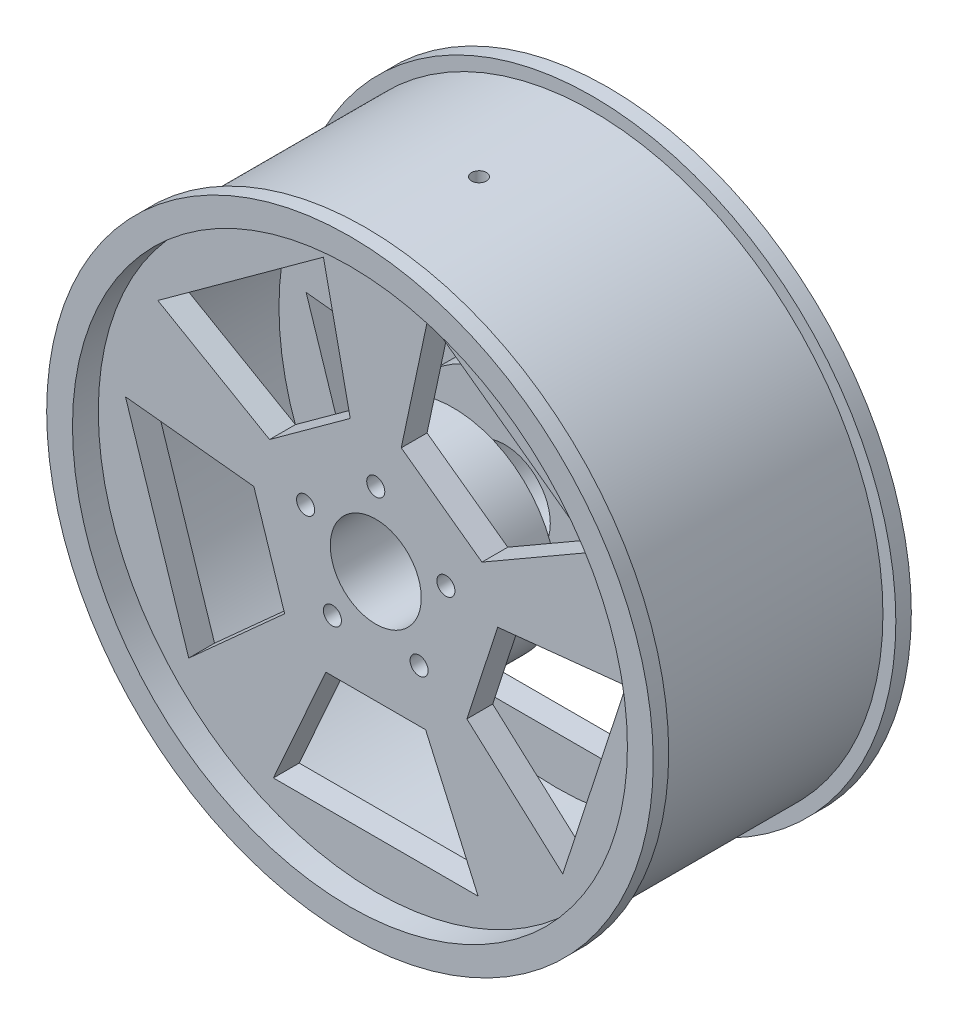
ISO-10303-21;
HEADER;
FILE_DESCRIPTION(('STEP AP214'),'2;1');
FILE_NAME('part.step','',(''),(''),'','','');
FILE_SCHEMA(('AUTOMOTIVE_DESIGN { 1 0 10303 214 1 1 1 1 }'));
ENDSEC;
DATA;
#1=APPLICATION_CONTEXT('core data for automotive mechanical design processes');
#2=APPLICATION_PROTOCOL_DEFINITION('international standard','automotive_design',2000,#1);
#3=PRODUCT_CONTEXT('',#1,'mechanical');
#4=PRODUCT('Part','Part','',(#3));
#5=PRODUCT_RELATED_PRODUCT_CATEGORY('part','',(#4));
#6=PRODUCT_DEFINITION_FORMATION('','',#4);
#7=PRODUCT_DEFINITION_CONTEXT('part definition',#1,'design');
#8=PRODUCT_DEFINITION('design','',#6,#7);
#9=PRODUCT_DEFINITION_SHAPE('','',#8);
#10=(LENGTH_UNIT() NAMED_UNIT(*) SI_UNIT(.MILLI.,.METRE.));
#11=(NAMED_UNIT(*) PLANE_ANGLE_UNIT() SI_UNIT($,.RADIAN.));
#12=(NAMED_UNIT(*) SI_UNIT($,.STERADIAN.) SOLID_ANGLE_UNIT());
#13=UNCERTAINTY_MEASURE_WITH_UNIT(LENGTH_MEASURE(1.E-05),#10,'distance_accuracy_value','');
#14=(GEOMETRIC_REPRESENTATION_CONTEXT(3) GLOBAL_UNCERTAINTY_ASSIGNED_CONTEXT((#13)) GLOBAL_UNIT_ASSIGNED_CONTEXT((#10,
#11,#12)) REPRESENTATION_CONTEXT('',''));
#15=CARTESIAN_POINT('',(0.,0.,0.));
#16=DIRECTION('',(0.,0.,1.));
#17=DIRECTION('',(1.,0.,0.));
#18=AXIS2_PLACEMENT_3D('',#15,#16,#17);
#19=CARTESIAN_POINT('',(0.,0.,0.));
#20=DIRECTION('',(0.,0.,-1.));
#21=DIRECTION('',(-1.,0.,0.));
#22=AXIS2_PLACEMENT_3D('',#19,#20,#21);
#23=PLANE('',#22);
#24=CARTESIAN_POINT('',(54.352879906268,17.6603212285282,0.));
#25=DIRECTION('',(0.,0.,1.));
#26=DIRECTION('',(1.,0.,0.));
#27=AXIS2_PLACEMENT_3D('',#24,#25,#26);
#28=CIRCLE('',#27,7.);
#29=CARTESIAN_POINT('',(61.352879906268,17.6603212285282,0.));
#30=VERTEX_POINT('',#29);
#31=EDGE_CURVE('E680',#30,#30,#28,.T.);
#32=ORIENTED_EDGE('',*,*,#31,.F.);
#33=EDGE_LOOP('',(#32));
#34=FACE_BOUND('',#33,.T.);
#35=CARTESIAN_POINT('',(33.5919271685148,-46.2353212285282,0.));
#36=DIRECTION('',(0.,0.,1.));
#37=DIRECTION('',(1.,0.,0.));
#38=AXIS2_PLACEMENT_3D('',#35,#36,#37);
#39=CIRCLE('',#38,7.);
#40=CARTESIAN_POINT('',(40.5919271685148,-46.2353212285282,0.));
#41=VERTEX_POINT('',#40);
#42=EDGE_CURVE('E676',#41,#41,#39,.T.);
#43=ORIENTED_EDGE('',*,*,#42,.F.);
#44=EDGE_LOOP('',(#43));
#45=FACE_BOUND('',#44,.T.);
#46=CARTESIAN_POINT('',(-33.5919271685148,-46.2353212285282,0.));
#47=DIRECTION('',(0.,0.,1.));
#48=DIRECTION('',(1.,0.,0.));
#49=AXIS2_PLACEMENT_3D('',#46,#47,#48);
#50=CIRCLE('',#49,7.);
#51=CARTESIAN_POINT('',(-26.5919271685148,-46.2353212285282,0.));
#52=VERTEX_POINT('',#51);
#53=EDGE_CURVE('E672',#52,#52,#50,.T.);
#54=ORIENTED_EDGE('',*,*,#53,.F.);
#55=EDGE_LOOP('',(#54));
#56=FACE_BOUND('',#55,.T.);
#57=CARTESIAN_POINT('',(-54.352879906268,17.6603212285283,0.));
#58=DIRECTION('',(0.,0.,1.));
#59=DIRECTION('',(1.,0.,0.));
#60=AXIS2_PLACEMENT_3D('',#57,#58,#59);
#61=CIRCLE('',#60,7.);
#62=CARTESIAN_POINT('',(-47.352879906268,17.6603212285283,0.));
#63=VERTEX_POINT('',#62);
#64=EDGE_CURVE('E667',#63,#63,#61,.T.);
#65=ORIENTED_EDGE('',*,*,#64,.F.);
#66=EDGE_LOOP('',(#65));
#67=FACE_BOUND('',#66,.T.);
#68=CARTESIAN_POINT('',(0.,57.15,0.));
#69=DIRECTION('',(0.,0.,1.));
#70=DIRECTION('',(1.,0.,0.));
#71=AXIS2_PLACEMENT_3D('',#68,#69,#70);
#72=CIRCLE('',#71,7.);
#73=CARTESIAN_POINT('',(7.,57.15,0.));
#74=VERTEX_POINT('',#73);
#75=EDGE_CURVE('E662',#74,#74,#72,.T.);
#76=ORIENTED_EDGE('',*,*,#75,.F.);
#77=EDGE_LOOP('',(#76));
#78=FACE_BOUND('',#77,.T.);
#79=CARTESIAN_POINT('',(0.,0.,0.));
#80=DIRECTION('',(0.,0.,1.));
#81=DIRECTION('',(1.,0.,0.));
#82=AXIS2_PLACEMENT_3D('',#79,#80,#81);
#83=CIRCLE('',#82,35.25);
#84=CARTESIAN_POINT('',(35.25,0.,0.));
#85=VERTEX_POINT('',#84);
#86=EDGE_CURVE('E657',#85,#85,#83,.T.);
#87=ORIENTED_EDGE('',*,*,#86,.F.);
#88=EDGE_LOOP('',(#87));
#89=FACE_BOUND('',#88,.T.);
#90=DIRECTION('',(0.866025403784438,0.5,0.));
#91=VECTOR('',#90,1.);
#92=CARTESIAN_POINT('',(82.2724133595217,47.5,0.));
#93=LINE('',#92,#91);
#94=CARTESIAN_POINT('',(82.2724133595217,47.5,0.));
#95=VERTEX_POINT('',#94);
#96=CARTESIAN_POINT('',(168.874953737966,97.5,0.));
#97=VERTEX_POINT('',#96);
#98=EDGE_CURVE('E317',#95,#97,#93,.T.);
#99=ORIENTED_EDGE('',*,*,#98,.F.);
#100=DIRECTION('',(0.809016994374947,-0.587785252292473,0.));
#101=VECTOR('',#100,1.);
#102=CARTESIAN_POINT('',(19.7516106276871,92.9240220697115,0.));
#103=LINE('',#102,#101);
#104=CARTESIAN_POINT('',(19.7516106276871,92.9240220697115,0.));
#105=VERTEX_POINT('',#104);
#106=EDGE_CURVE('E60',#105,#95,#103,.T.);
#107=ORIENTED_EDGE('',*,*,#106,.F.);
#108=DIRECTION('',(-0.207911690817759,-0.978147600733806,0.));
#109=VECTOR('',#108,1.);
#110=CARTESIAN_POINT('',(40.542779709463,190.738782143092,0.));
#111=LINE('',#110,#109);
#112=CARTESIAN_POINT('',(40.542779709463,190.738782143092,0.));
#113=VERTEX_POINT('',#112);
#114=EDGE_CURVE('E324',#113,#105,#111,.T.);
#115=ORIENTED_EDGE('',*,*,#114,.F.);
#116=DIRECTION('',(-0.809016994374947,0.587785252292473,0.));
#117=VECTOR('',#116,1.);
#118=CARTESIAN_POINT('',(168.874953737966,97.5,0.));
#119=LINE('',#118,#117);
#120=EDGE_CURVE('E308',#97,#113,#119,.T.);
#121=ORIENTED_EDGE('',*,*,#120,.F.);
#122=EDGE_LOOP('',(#99,#107,#115,#121));
#123=FACE_BOUND('',#122,.T.);
#124=DIRECTION('',(0.743144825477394,-0.669130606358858,0.));
#125=VECTOR('',#124,1.);
#126=CARTESIAN_POINT('',(70.5987584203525,-63.5674076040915,0.));
#127=LINE('',#126,#125);
#128=CARTESIAN_POINT('',(70.5987584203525,-63.5674076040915,0.));
#129=VERTEX_POINT('',#128);
#130=CARTESIAN_POINT('',(144.913240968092,-130.480468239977,0.));
#131=VERTEX_POINT('',#130);
#132=EDGE_CURVE('E362',#129,#131,#127,.T.);
#133=ORIENTED_EDGE('',*,*,#132,.F.);
#134=DIRECTION('',(-0.309016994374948,-0.951056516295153,0.));
#135=VECTOR('',#134,1.);
#136=CARTESIAN_POINT('',(94.479580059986,9.93020401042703,0.));
#137=LINE('',#136,#135);
#138=CARTESIAN_POINT('',(94.479580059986,9.93020401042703,0.));
#139=VERTEX_POINT('',#138);
#140=EDGE_CURVE('E360',#139,#129,#137,.T.);
#141=ORIENTED_EDGE('',*,*,#140,.F.);
#142=DIRECTION('',(-0.994521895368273,-0.104528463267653,0.));
#143=VECTOR('',#142,1.);
#144=CARTESIAN_POINT('',(193.931769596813,20.3830503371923,0.));
#145=LINE('',#144,#143);
#146=CARTESIAN_POINT('',(193.931769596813,20.3830503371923,0.));
#147=VERTEX_POINT('',#146);
#148=EDGE_CURVE('E368',#147,#139,#145,.T.);
#149=ORIENTED_EDGE('',*,*,#148,.F.);
#150=DIRECTION('',(0.309016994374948,0.951056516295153,0.));
#151=VECTOR('',#150,1.);
#152=CARTESIAN_POINT('',(144.913240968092,-130.480468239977,0.));
#153=LINE('',#152,#151);
#154=EDGE_CURVE('E365',#131,#147,#153,.T.);
#155=ORIENTED_EDGE('',*,*,#154,.F.);
#156=EDGE_LOOP('',(#133,#141,#149,#155));
#157=FACE_BOUND('',#156,.T.);
#158=DIRECTION('',(-0.4067366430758,-0.913545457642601,0.));
#159=VECTOR('',#158,1.);
#160=CARTESIAN_POINT('',(-38.639981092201,-86.7868184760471,0.));
#161=LINE('',#160,#159);
#162=CARTESIAN_POINT('',(-38.639981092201,-86.7868184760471,0.));
#163=VERTEX_POINT('',#162);
#164=CARTESIAN_POINT('',(-79.313645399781,-178.141364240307,0.));
#165=VERTEX_POINT('',#164);
#166=EDGE_CURVE('E410',#163,#165,#161,.T.);
#167=ORIENTED_EDGE('',*,*,#166,.F.);
#168=DIRECTION('',(-1.,0.,0.));
#169=VECTOR('',#168,1.);
#170=CARTESIAN_POINT('',(38.639981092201,-86.7868184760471,0.));
#171=LINE('',#170,#169);
#172=CARTESIAN_POINT('',(38.639981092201,-86.7868184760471,0.));
#173=VERTEX_POINT('',#172);
#174=EDGE_CURVE('E408',#173,#163,#171,.T.);
#175=ORIENTED_EDGE('',*,*,#174,.F.);
#176=DIRECTION('',(-0.4067366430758,0.913545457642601,0.));
#177=VECTOR('',#176,1.);
#178=CARTESIAN_POINT('',(79.313645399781,-178.141364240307,0.));
#179=LINE('',#178,#177);
#180=CARTESIAN_POINT('',(79.313645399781,-178.141364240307,0.));
#181=VERTEX_POINT('',#180);
#182=EDGE_CURVE('E416',#181,#173,#179,.T.);
#183=ORIENTED_EDGE('',*,*,#182,.F.);
#184=DIRECTION('',(1.,0.,0.));
#185=VECTOR('',#184,1.);
#186=CARTESIAN_POINT('',(-79.313645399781,-178.141364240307,0.));
#187=LINE('',#186,#185);
#188=EDGE_CURVE('E413',#165,#181,#187,.T.);
#189=ORIENTED_EDGE('',*,*,#188,.F.);
#190=EDGE_LOOP('',(#167,#175,#183,#189));
#191=FACE_BOUND('',#190,.T.);
#192=DIRECTION('',(-0.994521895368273,0.104528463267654,0.));
#193=VECTOR('',#192,1.);
#194=CARTESIAN_POINT('',(-94.479580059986,9.9302040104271,0.));
#195=LINE('',#194,#193);
#196=CARTESIAN_POINT('',(-94.479580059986,9.93020401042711,0.));
#197=VERTEX_POINT('',#196);
#198=CARTESIAN_POINT('',(-193.931769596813,20.3830503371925,0.));
#199=VERTEX_POINT('',#198);
#200=EDGE_CURVE('E458',#197,#199,#195,.T.);
#201=ORIENTED_EDGE('',*,*,#200,.F.);
#202=DIRECTION('',(-0.309016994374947,0.951056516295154,0.));
#203=VECTOR('',#202,1.);
#204=CARTESIAN_POINT('',(-70.5987584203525,-63.5674076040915,0.));
#205=LINE('',#204,#203);
#206=CARTESIAN_POINT('',(-70.5987584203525,-63.5674076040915,0.));
#207=VERTEX_POINT('',#206);
#208=EDGE_CURVE('E456',#207,#197,#205,.T.);
#209=ORIENTED_EDGE('',*,*,#208,.F.);
#210=DIRECTION('',(0.743144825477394,0.669130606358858,0.));
#211=VECTOR('',#210,1.);
#212=CARTESIAN_POINT('',(-144.913240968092,-130.480468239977,0.));
#213=LINE('',#212,#211);
#214=CARTESIAN_POINT('',(-144.913240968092,-130.480468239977,0.));
#215=VERTEX_POINT('',#214);
#216=EDGE_CURVE('E464',#215,#207,#213,.T.);
#217=ORIENTED_EDGE('',*,*,#216,.F.);
#218=DIRECTION('',(0.309016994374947,-0.951056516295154,0.));
#219=VECTOR('',#218,1.);
#220=CARTESIAN_POINT('',(-193.931769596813,20.3830503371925,0.));
#221=LINE('',#220,#219);
#222=EDGE_CURVE('E461',#199,#215,#221,.T.);
#223=ORIENTED_EDGE('',*,*,#222,.F.);
#224=EDGE_LOOP('',(#201,#209,#217,#223));
#225=FACE_BOUND('',#224,.T.);
#226=DIRECTION('',(-0.207911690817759,0.978147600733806,0.));
#227=VECTOR('',#226,1.);
#228=CARTESIAN_POINT('',(-19.7516106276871,92.9240220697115,0.));
#229=LINE('',#228,#227);
#230=CARTESIAN_POINT('',(-19.7516106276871,92.9240220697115,0.));
#231=VERTEX_POINT('',#230);
#232=CARTESIAN_POINT('',(-40.5427797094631,190.738782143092,0.));
#233=VERTEX_POINT('',#232);
#234=EDGE_CURVE('E506',#231,#233,#229,.T.);
#235=ORIENTED_EDGE('',*,*,#234,.F.);
#236=DIRECTION('',(0.809016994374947,0.587785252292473,0.));
#237=VECTOR('',#236,1.);
#238=CARTESIAN_POINT('',(-82.2724133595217,47.5,0.));
#239=LINE('',#238,#237);
#240=CARTESIAN_POINT('',(-82.2724133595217,47.5,0.));
#241=VERTEX_POINT('',#240);
#242=EDGE_CURVE('E504',#241,#231,#239,.T.);
#243=ORIENTED_EDGE('',*,*,#242,.F.);
#244=DIRECTION('',(0.866025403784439,-0.5,0.));
#245=VECTOR('',#244,1.);
#246=CARTESIAN_POINT('',(-168.874953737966,97.5,0.));
#247=LINE('',#246,#245);
#248=CARTESIAN_POINT('',(-168.874953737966,97.5,0.));
#249=VERTEX_POINT('',#248);
#250=EDGE_CURVE('E512',#249,#241,#247,.T.);
#251=ORIENTED_EDGE('',*,*,#250,.F.);
#252=DIRECTION('',(-0.809016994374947,-0.587785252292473,0.));
#253=VECTOR('',#252,1.);
#254=CARTESIAN_POINT('',(-40.5427797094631,190.738782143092,0.));
#255=LINE('',#254,#253);
#256=EDGE_CURVE('E509',#233,#249,#255,.T.);
#257=ORIENTED_EDGE('',*,*,#256,.F.);
#258=EDGE_LOOP('',(#235,#243,#251,#257));
#259=FACE_BOUND('',#258,.T.);
#260=CARTESIAN_POINT('',(0.,0.,0.));
#261=DIRECTION('',(0.,0.,1.));
#262=DIRECTION('',(1.,0.,0.));
#263=AXIS2_PLACEMENT_3D('',#260,#261,#262);
#264=CIRCLE('',#263,215.);
#265=CARTESIAN_POINT('',(215.,0.,0.));
#266=VERTEX_POINT('',#265);
#267=EDGE_CURVE('E597',#266,#266,#264,.T.);
#268=ORIENTED_EDGE('',*,*,#267,.T.);
#269=EDGE_LOOP('',(#268));
#270=FACE_BOUND('',#269,.T.);
#271=ADVANCED_FACE('F39',(#34,#45,#56,#67,#78,#89,#123,#157,#191,#225,#259,#270),#23,.F.);
#272=CARTESIAN_POINT('',(0.,0.,40.));
#273=DIRECTION('',(0.,0.,1.));
#274=DIRECTION('',(1.,0.,0.));
#275=AXIS2_PLACEMENT_3D('',#272,#273,#274);
#276=CYLINDRICAL_SURFACE('',#275,215.);
#277=ORIENTED_EDGE('',*,*,#267,.F.);
#278=EDGE_LOOP('',(#277));
#279=FACE_BOUND('',#278,.T.);
#280=CARTESIAN_POINT('',(0.,0.,20.));
#281=DIRECTION('',(0.,0.,1.));
#282=DIRECTION('',(1.,0.,0.));
#283=AXIS2_PLACEMENT_3D('',#280,#281,#282);
#284=CIRCLE('',#283,215.);
#285=CARTESIAN_POINT('',(215.,0.,20.));
#286=VERTEX_POINT('',#285);
#287=EDGE_CURVE('E594',#286,#286,#284,.T.);
#288=ORIENTED_EDGE('',*,*,#287,.T.);
#289=EDGE_LOOP('',(#288));
#290=FACE_BOUND('',#289,.T.);
#291=ADVANCED_FACE('F757',(#279,#290),#276,.F.);
#292=CARTESIAN_POINT('',(0.,215.,20.));
#293=DIRECTION('',(0.,0.,-1.));
#294=DIRECTION('',(-1.,0.,0.));
#295=AXIS2_PLACEMENT_3D('',#292,#293,#294);
#296=PLANE('',#295);
#297=ORIENTED_EDGE('',*,*,#287,.F.);
#298=EDGE_LOOP('',(#297));
#299=FACE_BOUND('',#298,.T.);
#300=CARTESIAN_POINT('',(0.,0.,20.));
#301=DIRECTION('',(0.,0.,1.));
#302=DIRECTION('',(1.,0.,0.));
#303=AXIS2_PLACEMENT_3D('',#300,#301,#302);
#304=CIRCLE('',#303,235.);
#305=CARTESIAN_POINT('',(235.,0.,20.));
#306=VERTEX_POINT('',#305);
#307=EDGE_CURVE('E591',#306,#306,#304,.T.);
#308=ORIENTED_EDGE('',*,*,#307,.T.);
#309=EDGE_LOOP('',(#308));
#310=FACE_BOUND('',#309,.T.);
#311=ADVANCED_FACE('F762',(#299,#310),#296,.F.);
#312=CARTESIAN_POINT('',(0.,0.,40.));
#313=DIRECTION('',(0.,0.,1.));
#314=DIRECTION('',(1.,0.,0.));
#315=AXIS2_PLACEMENT_3D('',#312,#313,#314);
#316=CYLINDRICAL_SURFACE('',#315,235.);
#317=ORIENTED_EDGE('',*,*,#307,.F.);
#318=EDGE_LOOP('',(#317));
#319=FACE_BOUND('',#318,.T.);
#320=CARTESIAN_POINT('',(0.,0.,8.));
#321=DIRECTION('',(0.,0.,1.));
#322=DIRECTION('',(1.,0.,0.));
#323=AXIS2_PLACEMENT_3D('',#320,#321,#322);
#324=CIRCLE('',#323,235.);
#325=CARTESIAN_POINT('',(235.,0.,8.));
#326=VERTEX_POINT('',#325);
#327=EDGE_CURVE('E588',#326,#326,#324,.T.);
#328=ORIENTED_EDGE('',*,*,#327,.T.);
#329=EDGE_LOOP('',(#328));
#330=FACE_BOUND('',#329,.T.);
#331=ADVANCED_FACE('F841',(#319,#330),#316,.T.);
#332=CARTESIAN_POINT('',(0.,235.,8.));
#333=DIRECTION('',(0.,0.,1.));
#334=DIRECTION('',(1.,0.,0.));
#335=AXIS2_PLACEMENT_3D('',#332,#333,#334);
#336=PLANE('',#335);
#337=ORIENTED_EDGE('',*,*,#327,.F.);
#338=EDGE_LOOP('',(#337));
#339=FACE_BOUND('',#338,.T.);
#340=CARTESIAN_POINT('',(0.,0.,8.));
#341=DIRECTION('',(0.,0.,1.));
#342=DIRECTION('',(1.,0.,0.));
#343=AXIS2_PLACEMENT_3D('',#340,#341,#342);
#344=CIRCLE('',#343,225.);
#345=CARTESIAN_POINT('',(225.,0.,8.));
#346=VERTEX_POINT('',#345);
#347=EDGE_CURVE('E585',#346,#346,#344,.T.);
#348=ORIENTED_EDGE('',*,*,#347,.T.);
#349=EDGE_LOOP('',(#348));
#350=FACE_BOUND('',#349,.T.);
#351=ADVANCED_FACE('F837',(#339,#350),#336,.F.);
#352=CARTESIAN_POINT('',(0.,0.,40.));
#353=DIRECTION('',(0.,0.,1.));
#354=DIRECTION('',(1.,0.,0.));
#355=AXIS2_PLACEMENT_3D('',#352,#353,#354);
#356=CYLINDRICAL_SURFACE('',#355,225.);
#357=CARTESIAN_POINT('',(0.,225.,-74.25));
#358=CARTESIAN_POINT('',(-0.161519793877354,225.000000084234,-74.2499988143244));
#359=CARTESIAN_POINT('',(-0.323020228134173,224.9998257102,-74.2568085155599));
#360=CARTESIAN_POINT('',(-0.644926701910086,224.999133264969,-74.2839995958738));
#361=CARTESIAN_POINT('',(-0.805332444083,224.998615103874,-74.3043845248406));
#362=CARTESIAN_POINT('',(-1.12399533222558,224.997248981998,-74.358609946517));
#363=CARTESIAN_POINT('',(-1.28225044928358,224.996400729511,-74.3924623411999));
#364=CARTESIAN_POINT('',(-1.59540170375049,224.994398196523,-74.4733956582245));
#365=CARTESIAN_POINT('',(-1.75029659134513,224.993243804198,-74.5204814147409));
#366=CARTESIAN_POINT('',(-2.05543354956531,224.990663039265,-74.6274948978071));
#367=CARTESIAN_POINT('',(-2.20567947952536,224.989236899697,-74.6874116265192));
#368=CARTESIAN_POINT('',(-2.50064408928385,224.986151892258,-74.8197089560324));
#369=CARTESIAN_POINT('',(-2.64536071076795,224.984492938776,-74.8920941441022));
#370=CARTESIAN_POINT('',(-2.92809245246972,224.980990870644,-75.0487498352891));
#371=CARTESIAN_POINT('',(-3.06611163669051,224.979147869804,-75.1330130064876));
#372=CARTESIAN_POINT('',(-3.33461381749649,224.975328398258,-75.3128929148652));
#373=CARTESIAN_POINT('',(-3.46509401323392,224.97335187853,-75.4085138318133));
#374=CARTESIAN_POINT('',(-3.71752875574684,224.96932217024,-75.6103988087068));
#375=CARTESIAN_POINT('',(-3.83948381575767,224.967268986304,-75.7166622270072));
#376=CARTESIAN_POINT('',(-4.07405442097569,224.963143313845,-75.9391234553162));
#377=CARTESIAN_POINT('',(-4.18666650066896,224.961070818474,-76.0553249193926));
#378=CARTESIAN_POINT('',(-4.40166512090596,224.956966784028,-76.296762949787));
#379=CARTESIAN_POINT('',(-4.50405501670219,224.95493523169,-76.4219965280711));
#380=CARTESIAN_POINT('',(-4.69795996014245,224.950969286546,-76.6806909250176));
#381=CARTESIAN_POINT('',(-4.78947097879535,224.949034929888,-76.8141547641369));
#382=CARTESIAN_POINT('',(-4.96090200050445,224.945319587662,-77.0882861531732));
#383=CARTESIAN_POINT('',(-5.04082490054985,224.943538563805,-77.2289518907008));
#384=CARTESIAN_POINT('',(-5.18856583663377,224.940179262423,-77.5165676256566));
#385=CARTESIAN_POINT('',(-5.25637939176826,224.93860106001,-77.663519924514));
#386=CARTESIAN_POINT('',(-5.37936000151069,224.935693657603,-77.9625747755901));
#387=CARTESIAN_POINT('',(-5.43453175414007,224.934364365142,-78.1146753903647));
#388=CARTESIAN_POINT('',(-5.53188472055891,224.93199102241,-78.4229973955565));
#389=CARTESIAN_POINT('',(-5.57406113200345,224.930947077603,-78.5792202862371));
#390=CARTESIAN_POINT('',(-5.68052931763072,224.928292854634,-79.0522340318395));
#391=CARTESIAN_POINT('',(-5.72492072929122,224.92715625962,-79.3737617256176));
#392=CARTESIAN_POINT('',(-5.7590641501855,224.926284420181,-80.0195330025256));
#393=CARTESIAN_POINT('',(-5.74881634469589,224.926549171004,-80.3437765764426));
#394=CARTESIAN_POINT('',(-5.6740526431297,224.928447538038,-80.9859091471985));
#395=CARTESIAN_POINT('',(-5.60954942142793,224.930080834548,-81.303799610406));
#396=CARTESIAN_POINT('',(-5.42810662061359,224.934532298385,-81.9242259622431));
#397=CARTESIAN_POINT('',(-5.31116694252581,224.937350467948,-82.2267618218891));
#398=CARTESIAN_POINT('',(-5.02816123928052,224.943854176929,-82.8079469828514));
#399=CARTESIAN_POINT('',(-4.86208940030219,224.947539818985,-83.0865934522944));
#400=CARTESIAN_POINT('',(-4.48553657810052,224.95536291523,-83.6120548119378));
#401=CARTESIAN_POINT('',(-4.2750555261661,224.959500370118,-83.8588696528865));
#402=CARTESIAN_POINT('',(-3.81558767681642,224.967762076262,-84.3137365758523));
#403=CARTESIAN_POINT('',(-3.56658987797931,224.971886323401,-84.5217775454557));
#404=CARTESIAN_POINT('',(-3.03719545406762,224.979655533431,-84.8931053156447));
#405=CARTESIAN_POINT('',(-2.75679882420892,224.983300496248,-85.0563921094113));
#406=CARTESIAN_POINT('',(-2.17256016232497,224.989700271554,-85.3335751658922));
#407=CARTESIAN_POINT('',(-1.86871796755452,224.992455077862,-85.4474710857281));
#408=CARTESIAN_POINT('',(-1.24621598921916,224.996763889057,-85.6226321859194));
#409=CARTESIAN_POINT('',(-0.927556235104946,224.99831789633,-85.6838974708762));
#410=CARTESIAN_POINT('',(-0.284561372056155,225.000049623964,-85.7520445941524));
#411=CARTESIAN_POINT('',(0.0397721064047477,225.000227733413,-85.7589418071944));
#412=CARTESIAN_POINT('',(0.684992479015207,224.999188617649,-85.7181970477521));
#413=CARTESIAN_POINT('',(1.0058793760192,224.997971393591,-85.6705551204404));
#414=CARTESIAN_POINT('',(1.63505486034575,224.994279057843,-85.522097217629));
#415=CARTESIAN_POINT('',(1.94334509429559,224.991804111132,-85.421288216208));
#416=CARTESIAN_POINT('',(2.53862644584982,224.985875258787,-85.1693647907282));
#417=CARTESIAN_POINT('',(2.82561753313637,224.982421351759,-85.0182502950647));
#418=CARTESIAN_POINT('',(3.37022471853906,224.974922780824,-84.6699661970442));
#419=CARTESIAN_POINT('',(3.62783419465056,224.97087798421,-84.4727862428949));
#420=CARTESIAN_POINT('',(4.1062989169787,224.962653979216,-84.0379825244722));
#421=CARTESIAN_POINT('',(4.32715409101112,224.958474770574,-83.8003586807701));
#422=CARTESIAN_POINT('',(4.72589260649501,224.950451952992,-83.2913509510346));
#423=CARTESIAN_POINT('',(4.90376602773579,224.946608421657,-83.0199592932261));
#424=CARTESIAN_POINT('',(5.21142221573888,224.939691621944,-82.4511435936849));
#425=CARTESIAN_POINT('',(5.34120507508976,224.936618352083,-82.1537196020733));
#426=CARTESIAN_POINT('',(5.5489852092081,224.931588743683,-81.541379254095));
#427=CARTESIAN_POINT('',(5.62698891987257,224.929632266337,-81.2264650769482));
#428=CARTESIAN_POINT('',(5.72899345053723,224.927057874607,-80.5878293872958));
#429=CARTESIAN_POINT('',(5.7529942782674,224.926439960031,-80.2641078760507));
#430=CARTESIAN_POINT('',(5.74804746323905,224.926565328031,-79.7793145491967));
#431=CARTESIAN_POINT('',(5.73956244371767,224.92678278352,-79.6177848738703));
#432=CARTESIAN_POINT('',(5.70902705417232,224.927560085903,-79.296029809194));
#433=CARTESIAN_POINT('',(5.68698169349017,224.928119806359,-79.1358039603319));
#434=CARTESIAN_POINT('',(5.62946584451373,224.92956659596,-78.8177319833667));
#435=CARTESIAN_POINT('',(5.59399037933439,224.930453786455,-78.659886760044));
#436=CARTESIAN_POINT('',(5.50988608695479,224.932529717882,-78.3478018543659));
#437=CARTESIAN_POINT('',(5.46126211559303,224.93371834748,-78.193560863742));
#438=CARTESIAN_POINT('',(5.35117889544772,224.936364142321,-77.8896650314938));
#439=CARTESIAN_POINT('',(5.28971469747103,224.937821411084,-77.7400119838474));
#440=CARTESIAN_POINT('',(5.15442502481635,224.940962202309,-77.4464710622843));
#441=CARTESIAN_POINT('',(5.08060411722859,224.942645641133,-77.302581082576));
#442=CARTESIAN_POINT('',(4.92108330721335,224.946192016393,-77.0214829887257));
#443=CARTESIAN_POINT('',(4.83537947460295,224.948055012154,-76.8842771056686));
#444=CARTESIAN_POINT('',(4.65275443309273,224.95190644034,-76.6176220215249));
#445=CARTESIAN_POINT('',(4.55583737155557,224.953894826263,-76.4881699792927));
#446=CARTESIAN_POINT('',(4.35139233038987,224.957942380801,-76.2378174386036));
#447=CARTESIAN_POINT('',(4.24385855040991,224.960001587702,-76.1169216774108));
#448=CARTESIAN_POINT('',(4.01903036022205,224.964130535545,-75.8846618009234));
#449=CARTESIAN_POINT('',(3.90173956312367,224.966200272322,-75.7732941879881));
#450=CARTESIAN_POINT('',(3.6581203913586,224.970293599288,-75.5607657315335));
#451=CARTESIAN_POINT('',(3.53178648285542,224.972317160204,-75.4596112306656));
#452=CARTESIAN_POINT('',(3.27109146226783,224.976258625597,-75.2683419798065));
#453=CARTESIAN_POINT('',(3.1367333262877,224.978176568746,-75.1782231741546));
#454=CARTESIAN_POINT('',(2.8607677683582,224.98185496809,-75.0095405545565));
#455=CARTESIAN_POINT('',(2.71915344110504,224.983615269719,-74.9309880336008));
#456=CARTESIAN_POINT('',(2.42985754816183,224.986925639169,-74.7861288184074));
#457=CARTESIAN_POINT('',(2.28217822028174,224.988475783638,-74.7198176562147));
#458=CARTESIAN_POINT('',(1.98188429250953,224.991321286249,-74.5999308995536));
#459=CARTESIAN_POINT('',(1.82927418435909,224.992616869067,-74.5463440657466));
#460=CARTESIAN_POINT('',(1.52013221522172,224.994917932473,-74.4522252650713));
#461=CARTESIAN_POINT('',(1.36360139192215,224.995923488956,-74.4116898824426));
#462=CARTESIAN_POINT('',(1.00770387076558,224.997830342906,-74.3353739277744));
#463=CARTESIAN_POINT('',(0.807512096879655,224.998641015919,-74.3033860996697));
#464=CARTESIAN_POINT('',(0.404870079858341,224.999725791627,-74.2606998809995));
#465=CARTESIAN_POINT('',(0.202419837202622,224.999999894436,-74.2500014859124));
#466=CARTESIAN_POINT('',(0.,225.,-74.25));
#467=B_SPLINE_CURVE_WITH_KNOTS('',3,(#357,#358,#359,#360,#361,#362,#363,#364,#365,#366,#367,
#368,#369,#370,#371,#372,#373,#374,#375,#376,#377,#378,#379,#380,#381,#382,#383,#384,#385,#386,
#387,#388,#389,#390,#391,#392,#393,#394,#395,#396,#397,#398,#399,#400,#401,#402,#403,#404,#405,
#406,#407,#408,#409,#410,#411,#412,#413,#414,#415,#416,#417,#418,#419,#420,#421,#422,#423,#424,
#425,#426,#427,#428,#429,#430,#431,#432,#433,#434,#435,#436,#437,#438,#439,#440,#441,#442,#443,
#444,#445,#446,#447,#448,#449,#450,#451,#452,#453,#454,#455,#456,#457,#458,#459,#460,#461,#462,
#463,#464,#465,#466),.UNSPECIFIED.,.T.,.F.,(4,2,2,2,2,2,2,2,2,2,2,2,2,2,2,2,2,2,2,2,2,2,2,2,2,2,
2,2,2,2,2,2,2,2,2,2,2,2,2,2,2,2,2,2,2,2,2,2,2,2,2,2,2,2,4),(0.,0.484382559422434,
0.968891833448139,1.45383025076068,1.93894604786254,2.42364768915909,2.90852803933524,
3.39311038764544,3.87787162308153,4.36260364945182,4.84751467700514,5.3322660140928,
5.81719632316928,6.30200519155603,6.78699308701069,7.27180045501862,7.75678676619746,
8.72550504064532,9.69422003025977,10.662708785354,11.6311993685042,12.5998045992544,
13.5684113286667,14.5372952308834,15.5061792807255,16.475070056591,17.4439589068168,
18.4125737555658,19.3811878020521,20.3496748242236,21.3181632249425,22.2868694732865,
23.2555776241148,24.2245091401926,25.1934387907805,26.162247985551,27.1310570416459,
27.61584314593,28.1004502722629,28.5852371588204,29.0698452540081,29.5546404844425,
30.0392569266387,30.5240340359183,31.0086324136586,31.493497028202,31.9781828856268,
32.4631679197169,32.9479741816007,33.4332506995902,33.91834974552,34.4030186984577,
34.8875607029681,35.4945987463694,36.1016366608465),.UNSPECIFIED.);
#468=CARTESIAN_POINT('',(0.,225.,-74.25));
#469=VERTEX_POINT('',#468);
#470=EDGE_CURVE('E687',#469,#469,#467,.T.);
#471=ORIENTED_EDGE('',*,*,#470,.T.);
#472=EDGE_LOOP('',(#471));
#473=FACE_BOUND('',#472,.T.);
#474=ORIENTED_EDGE('',*,*,#347,.F.);
#475=EDGE_LOOP('',(#474));
#476=FACE_BOUND('',#475,.T.);
#477=CARTESIAN_POINT('',(0.,0.,-168.));
#478=DIRECTION('',(0.,0.,1.));
#479=DIRECTION('',(1.,0.,0.));
#480=AXIS2_PLACEMENT_3D('',#477,#478,#479);
#481=CIRCLE('',#480,225.);
#482=CARTESIAN_POINT('',(225.,0.,-168.));
#483=VERTEX_POINT('',#482);
#484=EDGE_CURVE('E582',#483,#483,#481,.T.);
#485=ORIENTED_EDGE('',*,*,#484,.T.);
#486=EDGE_LOOP('',(#485));
#487=FACE_BOUND('',#486,.T.);
#488=ADVANCED_FACE('F832',(#473,#476,#487),#356,.T.);
#489=CARTESIAN_POINT('',(0.,225.,-168.));
#490=DIRECTION('',(0.,0.,-1.));
#491=DIRECTION('',(-1.,0.,0.));
#492=AXIS2_PLACEMENT_3D('',#489,#490,#491);
#493=PLANE('',#492);
#494=ORIENTED_EDGE('',*,*,#484,.F.);
#495=EDGE_LOOP('',(#494));
#496=FACE_BOUND('',#495,.T.);
#497=CARTESIAN_POINT('',(0.,0.,-168.));
#498=DIRECTION('',(0.,0.,1.));
#499=DIRECTION('',(1.,0.,0.));
#500=AXIS2_PLACEMENT_3D('',#497,#498,#499);
#501=CIRCLE('',#500,235.);
#502=CARTESIAN_POINT('',(235.,0.,-168.));
#503=VERTEX_POINT('',#502);
#504=EDGE_CURVE('E579',#503,#503,#501,.T.);
#505=ORIENTED_EDGE('',*,*,#504,.T.);
#506=EDGE_LOOP('',(#505));
#507=FACE_BOUND('',#506,.T.);
#508=ADVANCED_FACE('F829',(#496,#507),#493,.F.);
#509=CARTESIAN_POINT('',(0.,0.,40.));
#510=DIRECTION('',(0.,0.,1.));
#511=DIRECTION('',(1.,0.,0.));
#512=AXIS2_PLACEMENT_3D('',#509,#510,#511);
#513=CYLINDRICAL_SURFACE('',#512,235.);
#514=ORIENTED_EDGE('',*,*,#504,.F.);
#515=EDGE_LOOP('',(#514));
#516=FACE_BOUND('',#515,.T.);
#517=CARTESIAN_POINT('',(0.,0.,-180.));
#518=DIRECTION('',(0.,0.,1.));
#519=DIRECTION('',(1.,0.,0.));
#520=AXIS2_PLACEMENT_3D('',#517,#518,#519);
#521=CIRCLE('',#520,235.);
#522=CARTESIAN_POINT('',(235.,0.,-180.));
#523=VERTEX_POINT('',#522);
#524=EDGE_CURVE('E576',#523,#523,#521,.T.);
#525=ORIENTED_EDGE('',*,*,#524,.T.);
#526=EDGE_LOOP('',(#525));
#527=FACE_BOUND('',#526,.T.);
#528=ADVANCED_FACE('F825',(#516,#527),#513,.T.);
#529=CARTESIAN_POINT('',(0.,235.,-180.));
#530=DIRECTION('',(0.,0.,1.));
#531=DIRECTION('',(1.,0.,0.));
#532=AXIS2_PLACEMENT_3D('',#529,#530,#531);
#533=PLANE('',#532);
#534=ORIENTED_EDGE('',*,*,#524,.F.);
#535=EDGE_LOOP('',(#534));
#536=FACE_BOUND('',#535,.T.);
#537=CARTESIAN_POINT('',(0.,0.,-180.));
#538=DIRECTION('',(0.,0.,1.));
#539=DIRECTION('',(1.,0.,0.));
#540=AXIS2_PLACEMENT_3D('',#537,#538,#539);
#541=CIRCLE('',#540,215.);
#542=CARTESIAN_POINT('',(215.,0.,-180.));
#543=VERTEX_POINT('',#542);
#544=EDGE_CURVE('E573',#543,#543,#541,.T.);
#545=ORIENTED_EDGE('',*,*,#544,.T.);
#546=EDGE_LOOP('',(#545));
#547=FACE_BOUND('',#546,.T.);
#548=ADVANCED_FACE('F821',(#536,#547),#533,.F.);
#549=CARTESIAN_POINT('',(0.,0.,40.));
#550=DIRECTION('',(0.,0.,1.));
#551=DIRECTION('',(1.,0.,0.));
#552=AXIS2_PLACEMENT_3D('',#549,#550,#551);
#553=CYLINDRICAL_SURFACE('',#552,215.);
#554=ORIENTED_EDGE('',*,*,#544,.F.);
#555=EDGE_LOOP('',(#554));
#556=FACE_BOUND('',#555,.T.);
#557=CARTESIAN_POINT('',(0.,0.,-160.));
#558=DIRECTION('',(0.,0.,1.));
#559=DIRECTION('',(1.,0.,0.));
#560=AXIS2_PLACEMENT_3D('',#557,#558,#559);
#561=CIRCLE('',#560,215.);
#562=CARTESIAN_POINT('',(215.,0.,-160.));
#563=VERTEX_POINT('',#562);
#564=EDGE_CURVE('E570',#563,#563,#561,.T.);
#565=ORIENTED_EDGE('',*,*,#564,.T.);
#566=EDGE_LOOP('',(#565));
#567=FACE_BOUND('',#566,.T.);
#568=ADVANCED_FACE('F817',(#556,#567),#553,.F.);
#569=CARTESIAN_POINT('',(0.,215.,-160.));
#570=DIRECTION('',(0.,0.,1.));
#571=DIRECTION('',(1.,0.,0.));
#572=AXIS2_PLACEMENT_3D('',#569,#570,#571);
#573=PLANE('',#572);
#574=CARTESIAN_POINT('',(54.352879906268,17.6603212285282,-160.));
#575=DIRECTION('',(0.,0.,1.));
#576=DIRECTION('',(1.,0.,0.));
#577=AXIS2_PLACEMENT_3D('',#574,#575,#576);
#578=CIRCLE('',#577,7.);
#579=CARTESIAN_POINT('',(61.352879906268,17.6603212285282,-160.));
#580=VERTEX_POINT('',#579);
#581=EDGE_CURVE('E684',#580,#580,#578,.T.);
#582=ORIENTED_EDGE('',*,*,#581,.T.);
#583=EDGE_LOOP('',(#582));
#584=FACE_BOUND('',#583,.T.);
#585=CARTESIAN_POINT('',(33.5919271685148,-46.2353212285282,-160.));
#586=DIRECTION('',(0.,0.,1.));
#587=DIRECTION('',(1.,0.,0.));
#588=AXIS2_PLACEMENT_3D('',#585,#586,#587);
#589=CIRCLE('',#588,7.);
#590=CARTESIAN_POINT('',(40.5919271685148,-46.2353212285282,-160.));
#591=VERTEX_POINT('',#590);
#592=EDGE_CURVE('E704',#591,#591,#589,.T.);
#593=ORIENTED_EDGE('',*,*,#592,.T.);
#594=EDGE_LOOP('',(#593));
#595=FACE_BOUND('',#594,.T.);
#596=CARTESIAN_POINT('',(-33.5919271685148,-46.2353212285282,-160.));
#597=DIRECTION('',(0.,0.,1.));
#598=DIRECTION('',(1.,0.,0.));
#599=AXIS2_PLACEMENT_3D('',#596,#597,#598);
#600=CIRCLE('',#599,7.);
#601=CARTESIAN_POINT('',(-26.5919271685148,-46.2353212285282,-160.));
#602=VERTEX_POINT('',#601);
#603=EDGE_CURVE('E711',#602,#602,#600,.T.);
#604=ORIENTED_EDGE('',*,*,#603,.T.);
#605=EDGE_LOOP('',(#604));
#606=FACE_BOUND('',#605,.T.);
#607=CARTESIAN_POINT('',(-54.352879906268,17.6603212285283,-160.));
#608=DIRECTION('',(0.,0.,1.));
#609=DIRECTION('',(1.,0.,0.));
#610=AXIS2_PLACEMENT_3D('',#607,#608,#609);
#611=CIRCLE('',#610,7.);
#612=CARTESIAN_POINT('',(-47.352879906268,17.6603212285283,-160.));
#613=VERTEX_POINT('',#612);
#614=EDGE_CURVE('E718',#613,#613,#611,.T.);
#615=ORIENTED_EDGE('',*,*,#614,.T.);
#616=EDGE_LOOP('',(#615));
#617=FACE_BOUND('',#616,.T.);
#618=CARTESIAN_POINT('',(0.,57.15,-160.));
#619=DIRECTION('',(0.,0.,1.));
#620=DIRECTION('',(1.,0.,0.));
#621=AXIS2_PLACEMENT_3D('',#618,#619,#620);
#622=CIRCLE('',#621,7.);
#623=CARTESIAN_POINT('',(7.,57.15,-160.));
#624=VERTEX_POINT('',#623);
#625=EDGE_CURVE('E725',#624,#624,#622,.T.);
#626=ORIENTED_EDGE('',*,*,#625,.T.);
#627=EDGE_LOOP('',(#626));
#628=FACE_BOUND('',#627,.T.);
#629=CARTESIAN_POINT('',(0.,0.,-160.));
#630=DIRECTION('',(0.,0.,1.));
#631=DIRECTION('',(1.,0.,0.));
#632=AXIS2_PLACEMENT_3D('',#629,#630,#631);
#633=CIRCLE('',#632,35.25);
#634=CARTESIAN_POINT('',(35.25,0.,-160.));
#635=VERTEX_POINT('',#634);
#636=EDGE_CURVE('E732',#635,#635,#633,.T.);
#637=ORIENTED_EDGE('',*,*,#636,.T.);
#638=EDGE_LOOP('',(#637));
#639=FACE_BOUND('',#638,.T.);
#640=DIRECTION('',(-0.207911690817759,-0.978147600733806,0.));
#641=VECTOR('',#640,1.);
#642=CARTESIAN_POINT('',(43.7241891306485,205.70613669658,-160.));
#643=LINE('',#642,#641);
#644=CARTESIAN_POINT('',(40.542779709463,190.738782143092,-160.));
#645=VERTEX_POINT('',#644);
#646=CARTESIAN_POINT('',(19.7516106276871,92.9240220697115,-160.));
#647=VERTEX_POINT('',#646);
#648=EDGE_CURVE('E351',#645,#647,#643,.T.);
#649=ORIENTED_EDGE('',*,*,#648,.T.);
#650=DIRECTION('',(0.809016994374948,-0.587785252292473,0.));
#651=VECTOR('',#650,1.);
#652=CARTESIAN_POINT('',(-51.2265635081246,144.492684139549,-160.));
#653=LINE('',#652,#651);
#654=CARTESIAN_POINT('',(82.2724133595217,47.5,-160.));
#655=VERTEX_POINT('',#654);
#656=EDGE_CURVE('E357',#647,#655,#653,.T.);
#657=ORIENTED_EDGE('',*,*,#656,.T.);
#658=DIRECTION('',(0.866025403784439,0.5,0.));
#659=VECTOR('',#658,1.);
#660=CARTESIAN_POINT('',(93.0977309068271,53.75,-160.));
#661=LINE('',#660,#659);
#662=CARTESIAN_POINT('',(168.874953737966,97.5,-160.));
#663=VERTEX_POINT('',#662);
#664=EDGE_CURVE('E339',#655,#663,#661,.T.);
#665=ORIENTED_EDGE('',*,*,#664,.T.);
#666=DIRECTION('',(-0.809016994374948,0.587785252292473,0.));
#667=VECTOR('',#666,1.);
#668=CARTESIAN_POINT('',(2.47029122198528,218.400064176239,-160.));
#669=LINE('',#668,#667);
#670=EDGE_CURVE('E345',#663,#645,#669,.T.);
#671=ORIENTED_EDGE('',*,*,#670,.T.);
#672=EDGE_LOOP('',(#649,#657,#665,#671));
#673=FACE_BOUND('',#672,.T.);
#674=DIRECTION('',(-0.994521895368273,-0.104528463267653,0.));
#675=VECTOR('',#674,1.);
#676=CARTESIAN_POINT('',(22.350506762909,2.34913292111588,-160.));
#677=LINE('',#676,#675);
#678=CARTESIAN_POINT('',(193.931769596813,20.3830503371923,-160.));
#679=VERTEX_POINT('',#678);
#680=CARTESIAN_POINT('',(94.479580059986,9.93020401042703,-160.));
#681=VERTEX_POINT('',#680);
#682=EDGE_CURVE('E399',#679,#681,#677,.T.);
#683=ORIENTED_EDGE('',*,*,#682,.T.);
#684=DIRECTION('',(-0.309016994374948,-0.951056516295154,0.));
#685=VECTOR('',#684,1.);
#686=CARTESIAN_POINT('',(145.72608386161,167.650725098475,-160.));
#687=LINE('',#686,#685);
#688=CARTESIAN_POINT('',(70.5987584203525,-63.5674076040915,-160.));
#689=VERTEX_POINT('',#688);
#690=EDGE_CURVE('E405',#681,#689,#687,.T.);
#691=ORIENTED_EDGE('',*,*,#690,.T.);
#692=DIRECTION('',(0.743144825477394,-0.669130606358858,0.));
#693=VECTOR('',#692,1.);
#694=CARTESIAN_POINT('',(-106.911103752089,96.2631901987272,-160.));
#695=LINE('',#694,#693);
#696=CARTESIAN_POINT('',(144.913240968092,-130.480468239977,-160.));
#697=VERTEX_POINT('',#696);
#698=EDGE_CURVE('E387',#689,#697,#695,.T.);
#699=ORIENTED_EDGE('',*,*,#698,.T.);
#700=DIRECTION('',(0.309016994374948,0.951056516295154,0.));
#701=VECTOR('',#700,1.);
#702=CARTESIAN_POINT('',(232.609419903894,139.420617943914,-160.));
#703=LINE('',#702,#701);
#704=EDGE_CURVE('E393',#697,#679,#703,.T.);
#705=ORIENTED_EDGE('',*,*,#704,.T.);
#706=EDGE_LOOP('',(#683,#691,#699,#705));
#707=FACE_BOUND('',#706,.T.);
#708=DIRECTION('',(-0.4067366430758,0.913545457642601,0.));
#709=VECTOR('',#708,1.);
#710=CARTESIAN_POINT('',(-79.8880687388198,179.431540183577,-160.));
#711=LINE('',#710,#709);
#712=CARTESIAN_POINT('',(79.313645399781,-178.141364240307,-160.));
#713=VERTEX_POINT('',#712);
#714=CARTESIAN_POINT('',(38.639981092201,-86.7868184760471,-160.));
#715=VERTEX_POINT('',#714);
#716=EDGE_CURVE('E447',#713,#715,#711,.T.);
#717=ORIENTED_EDGE('',*,*,#716,.T.);
#718=DIRECTION('',(-1.,0.,0.));
#719=VECTOR('',#718,1.);
#720=CARTESIAN_POINT('',(0.,-86.7868184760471,-160.));
#721=LINE('',#720,#719);
#722=CARTESIAN_POINT('',(-38.639981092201,-86.7868184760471,-160.));
#723=VERTEX_POINT('',#722);
#724=EDGE_CURVE('E453',#715,#723,#721,.T.);
#725=ORIENTED_EDGE('',*,*,#724,.T.);
#726=DIRECTION('',(-0.4067366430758,-0.913545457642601,0.));
#727=VECTOR('',#726,1.);
#728=CARTESIAN_POINT('',(79.8880687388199,179.431540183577,-160.));
#729=LINE('',#728,#727);
#730=CARTESIAN_POINT('',(-79.313645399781,-178.141364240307,-160.));
#731=VERTEX_POINT('',#730);
#732=EDGE_CURVE('E435',#723,#731,#729,.T.);
#733=ORIENTED_EDGE('',*,*,#732,.T.);
#734=DIRECTION('',(1.,0.,0.));
#735=VECTOR('',#734,1.);
#736=CARTESIAN_POINT('',(0.,-178.141364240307,-160.));
#737=LINE('',#736,#735);
#738=EDGE_CURVE('E441',#731,#713,#737,.T.);
#739=ORIENTED_EDGE('',*,*,#738,.T.);
#740=EDGE_LOOP('',(#717,#725,#733,#739));
#741=FACE_BOUND('',#740,.T.);
#742=DIRECTION('',(0.743144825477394,0.669130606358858,0.));
#743=VECTOR('',#742,1.);
#744=CARTESIAN_POINT('',(106.911103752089,96.2631901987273,-160.));
#745=LINE('',#744,#743);
#746=CARTESIAN_POINT('',(-144.913240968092,-130.480468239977,-160.));
#747=VERTEX_POINT('',#746);
#748=CARTESIAN_POINT('',(-70.5987584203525,-63.5674076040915,-160.));
#749=VERTEX_POINT('',#748);
#750=EDGE_CURVE('E495',#747,#749,#745,.T.);
#751=ORIENTED_EDGE('',*,*,#750,.T.);
#752=DIRECTION('',(-0.309016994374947,0.951056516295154,0.));
#753=VECTOR('',#752,1.);
#754=CARTESIAN_POINT('',(-145.72608386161,167.650725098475,-160.));
#755=LINE('',#754,#753);
#756=CARTESIAN_POINT('',(-94.479580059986,9.9302040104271,-160.));
#757=VERTEX_POINT('',#756);
#758=EDGE_CURVE('E501',#749,#757,#755,.T.);
#759=ORIENTED_EDGE('',*,*,#758,.T.);
#760=DIRECTION('',(-0.994521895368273,0.104528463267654,0.));
#761=VECTOR('',#760,1.);
#762=CARTESIAN_POINT('',(-22.3505067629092,2.34913292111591,-160.));
#763=LINE('',#762,#761);
#764=CARTESIAN_POINT('',(-193.931769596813,20.3830503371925,-160.));
#765=VERTEX_POINT('',#764);
#766=EDGE_CURVE('E483',#757,#765,#763,.T.);
#767=ORIENTED_EDGE('',*,*,#766,.T.);
#768=DIRECTION('',(0.309016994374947,-0.951056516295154,0.));
#769=VECTOR('',#768,1.);
#770=CARTESIAN_POINT('',(-232.609419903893,139.420617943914,-160.));
#771=LINE('',#770,#769);
#772=EDGE_CURVE('E489',#765,#747,#771,.T.);
#773=ORIENTED_EDGE('',*,*,#772,.T.);
#774=EDGE_LOOP('',(#751,#759,#767,#773));
#775=FACE_BOUND('',#774,.T.);
#776=DIRECTION('',(0.866025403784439,-0.5,0.));
#777=VECTOR('',#776,1.);
#778=CARTESIAN_POINT('',(-93.0977309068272,53.75,-160.));
#779=LINE('',#778,#777);
#780=CARTESIAN_POINT('',(-168.874953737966,97.5,-160.));
#781=VERTEX_POINT('',#780);
#782=CARTESIAN_POINT('',(-82.2724133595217,47.5,-160.));
#783=VERTEX_POINT('',#782);
#784=EDGE_CURVE('E543',#781,#783,#779,.T.);
#785=ORIENTED_EDGE('',*,*,#784,.T.);
#786=DIRECTION('',(0.809016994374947,0.587785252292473,0.));
#787=VECTOR('',#786,1.);
#788=CARTESIAN_POINT('',(51.2265635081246,144.492684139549,-160.));
#789=LINE('',#788,#787);
#790=CARTESIAN_POINT('',(-19.7516106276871,92.9240220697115,-160.));
#791=VERTEX_POINT('',#790);
#792=EDGE_CURVE('E549',#783,#791,#789,.T.);
#793=ORIENTED_EDGE('',*,*,#792,.T.);
#794=DIRECTION('',(-0.207911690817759,0.978147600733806,0.));
#795=VECTOR('',#794,1.);
#796=CARTESIAN_POINT('',(-43.7241891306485,205.70613669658,-160.));
#797=LINE('',#796,#795);
#798=CARTESIAN_POINT('',(-40.5427797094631,190.738782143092,-160.));
#799=VERTEX_POINT('',#798);
#800=EDGE_CURVE('E531',#791,#799,#797,.T.);
#801=ORIENTED_EDGE('',*,*,#800,.T.);
#802=DIRECTION('',(-0.809016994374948,-0.587785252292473,0.));
#803=VECTOR('',#802,1.);
#804=CARTESIAN_POINT('',(-2.47029122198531,218.400064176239,-160.));
#805=LINE('',#804,#803);
#806=EDGE_CURVE('E537',#799,#781,#805,.T.);
#807=ORIENTED_EDGE('',*,*,#806,.T.);
#808=EDGE_LOOP('',(#785,#793,#801,#807));
#809=FACE_BOUND('',#808,.T.);
#810=ORIENTED_EDGE('',*,*,#564,.F.);
#811=EDGE_LOOP('',(#810));
#812=FACE_BOUND('',#811,.T.);
#813=ADVANCED_FACE('F736',(#584,#595,#606,#617,#628,#639,#673,#707,#741,#775,#809,#812),#573,.F.);
#814=CARTESIAN_POINT('',(-19.7516106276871,92.9240220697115,-180.));
#815=DIRECTION('',(0.978147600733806,0.207911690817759,0.));
#816=DIRECTION('',(-0.207911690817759,0.978147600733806,0.));
#817=AXIS2_PLACEMENT_3D('',#814,#815,#816);
#818=PLANE('',#817);
#819=DIRECTION('',(0.,0.,1.));
#820=VECTOR('',#819,1.);
#821=CARTESIAN_POINT('',(-19.7516106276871,92.9240220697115,-180.));
#822=LINE('',#821,#820);
#823=CARTESIAN_POINT('',(-19.7516106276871,92.9240220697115,-20.));
#824=VERTEX_POINT('',#823);
#825=EDGE_CURVE('E515',#824,#231,#822,.T.);
#826=ORIENTED_EDGE('',*,*,#825,.T.);
#827=ORIENTED_EDGE('',*,*,#234,.T.);
#828=DIRECTION('',(0.,0.,1.));
#829=VECTOR('',#828,1.);
#830=CARTESIAN_POINT('',(-40.5427797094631,190.738782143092,-180.));
#831=LINE('',#830,#829);
#832=CARTESIAN_POINT('',(-40.5427797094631,190.738782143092,-20.));
#833=VERTEX_POINT('',#832);
#834=EDGE_CURVE('E523',#833,#233,#831,.T.);
#835=ORIENTED_EDGE('',*,*,#834,.F.);
#836=DIRECTION('',(-0.207911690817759,0.978147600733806,0.));
#837=VECTOR('',#836,1.);
#838=CARTESIAN_POINT('',(-43.7241891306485,205.70613669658,-20.));
#839=LINE('',#838,#837);
#840=EDGE_CURVE('E600',#824,#833,#839,.T.);
#841=ORIENTED_EDGE('',*,*,#840,.F.);
#842=EDGE_LOOP('',(#826,#827,#835,#841));
#843=FACE_BOUND('',#842,.T.);
#844=ADVANCED_FACE('F816',(#843),#818,.F.);
#845=CARTESIAN_POINT('',(-40.5427797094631,190.738782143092,-180.));
#846=DIRECTION('',(-0.587785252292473,0.809016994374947,0.));
#847=DIRECTION('',(-0.809016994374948,-0.587785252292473,0.));
#848=AXIS2_PLACEMENT_3D('',#845,#846,#847);
#849=PLANE('',#848);
#850=ORIENTED_EDGE('',*,*,#834,.T.);
#851=ORIENTED_EDGE('',*,*,#256,.T.);
#852=DIRECTION('',(0.,0.,1.));
#853=VECTOR('',#852,1.);
#854=CARTESIAN_POINT('',(-168.874953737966,97.5,-180.));
#855=LINE('',#854,#853);
#856=CARTESIAN_POINT('',(-168.874953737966,97.5,-20.));
#857=VERTEX_POINT('',#856);
#858=EDGE_CURVE('E520',#857,#249,#855,.T.);
#859=ORIENTED_EDGE('',*,*,#858,.F.);
#860=DIRECTION('',(-0.809016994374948,-0.587785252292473,0.));
#861=VECTOR('',#860,1.);
#862=CARTESIAN_POINT('',(-2.47029122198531,218.400064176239,-20.));
#863=LINE('',#862,#861);
#864=EDGE_CURVE('E603',#833,#857,#863,.T.);
#865=ORIENTED_EDGE('',*,*,#864,.F.);
#866=EDGE_LOOP('',(#850,#851,#859,#865));
#867=FACE_BOUND('',#866,.T.);
#868=ADVANCED_FACE('F914',(#867),#849,.F.);
#869=CARTESIAN_POINT('',(-168.874953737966,97.5,-180.));
#870=DIRECTION('',(-0.5,-0.866025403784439,0.));
#871=DIRECTION('',(0.866025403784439,-0.5,0.));
#872=AXIS2_PLACEMENT_3D('',#869,#870,#871);
#873=PLANE('',#872);
#874=ORIENTED_EDGE('',*,*,#858,.T.);
#875=ORIENTED_EDGE('',*,*,#250,.T.);
#876=DIRECTION('',(0.,0.,1.));
#877=VECTOR('',#876,1.);
#878=CARTESIAN_POINT('',(-82.2724133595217,47.5,-180.));
#879=LINE('',#878,#877);
#880=CARTESIAN_POINT('',(-82.2724133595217,47.5,-20.));
#881=VERTEX_POINT('',#880);
#882=EDGE_CURVE('E516',#881,#241,#879,.T.);
#883=ORIENTED_EDGE('',*,*,#882,.F.);
#884=DIRECTION('',(0.866025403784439,-0.5,0.));
#885=VECTOR('',#884,1.);
#886=CARTESIAN_POINT('',(-93.0977309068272,53.75,-20.));
#887=LINE('',#886,#885);
#888=EDGE_CURVE('E606',#857,#881,#887,.T.);
#889=ORIENTED_EDGE('',*,*,#888,.F.);
#890=EDGE_LOOP('',(#874,#875,#883,#889));
#891=FACE_BOUND('',#890,.T.);
#892=ADVANCED_FACE('F922',(#891),#873,.F.);
#893=CARTESIAN_POINT('',(-82.2724133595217,47.5,-180.));
#894=DIRECTION('',(0.587785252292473,-0.809016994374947,0.));
#895=DIRECTION('',(0.809016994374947,0.587785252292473,0.));
#896=AXIS2_PLACEMENT_3D('',#893,#894,#895);
#897=PLANE('',#896);
#898=ORIENTED_EDGE('',*,*,#882,.T.);
#899=ORIENTED_EDGE('',*,*,#242,.T.);
#900=ORIENTED_EDGE('',*,*,#825,.F.);
#901=DIRECTION('',(0.809016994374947,0.587785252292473,0.));
#902=VECTOR('',#901,1.);
#903=CARTESIAN_POINT('',(51.2265635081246,144.492684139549,-20.));
#904=LINE('',#903,#902);
#905=EDGE_CURVE('E609',#881,#824,#904,.T.);
#906=ORIENTED_EDGE('',*,*,#905,.F.);
#907=EDGE_LOOP('',(#898,#899,#900,#906));
#908=FACE_BOUND('',#907,.T.);
#909=ADVANCED_FACE('F931',(#908),#897,.F.);
#910=CARTESIAN_POINT('',(-82.2724133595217,47.5,-140.));
#911=VERTEX_POINT('',#910);
#912=EDGE_CURVE('E518',#783,#911,#879,.T.);
#913=ORIENTED_EDGE('',*,*,#912,.T.);
#914=DIRECTION('',(-0.809016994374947,-0.587785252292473,0.));
#915=VECTOR('',#914,1.);
#916=CARTESIAN_POINT('',(-12.9697513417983,97.8513312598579,-140.));
#917=LINE('',#916,#915);
#918=CARTESIAN_POINT('',(-19.7516106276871,92.9240220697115,-140.));
#919=VERTEX_POINT('',#918);
#920=EDGE_CURVE('E546',#919,#911,#917,.T.);
#921=ORIENTED_EDGE('',*,*,#920,.F.);
#922=EDGE_CURVE('E525',#791,#919,#822,.T.);
#923=ORIENTED_EDGE('',*,*,#922,.F.);
#924=ORIENTED_EDGE('',*,*,#792,.F.);
#925=EDGE_LOOP('',(#913,#921,#923,#924));
#926=FACE_BOUND('',#925,.T.);
#927=ADVANCED_FACE('F940',(#926),#897,.F.);
#928=CARTESIAN_POINT('',(-168.874953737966,97.5,-140.));
#929=VERTEX_POINT('',#928);
#930=EDGE_CURVE('E519',#781,#929,#855,.T.);
#931=ORIENTED_EDGE('',*,*,#930,.T.);
#932=DIRECTION('',(-0.866025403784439,0.5,0.));
#933=VECTOR('',#932,1.);
#934=CARTESIAN_POINT('',(-34.6410161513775,20.,-140.));
#935=LINE('',#934,#933);
#936=EDGE_CURVE('E540',#911,#929,#935,.T.);
#937=ORIENTED_EDGE('',*,*,#936,.F.);
#938=ORIENTED_EDGE('',*,*,#912,.F.);
#939=ORIENTED_EDGE('',*,*,#784,.F.);
#940=EDGE_LOOP('',(#931,#937,#938,#939));
#941=FACE_BOUND('',#940,.T.);
#942=ADVANCED_FACE('F934',(#941),#873,.F.);
#943=CARTESIAN_POINT('',(-40.5427797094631,190.738782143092,-140.));
#944=VERTEX_POINT('',#943);
#945=EDGE_CURVE('E522',#799,#944,#831,.T.);
#946=ORIENTED_EDGE('',*,*,#945,.T.);
#947=DIRECTION('',(0.809016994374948,0.587785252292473,0.));
#948=VECTOR('',#947,1.);
#949=CARTESIAN_POINT('',(-66.6666060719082,171.758711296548,-140.));
#950=LINE('',#949,#948);
#951=EDGE_CURVE('E534',#929,#944,#950,.T.);
#952=ORIENTED_EDGE('',*,*,#951,.F.);
#953=ORIENTED_EDGE('',*,*,#930,.F.);
#954=ORIENTED_EDGE('',*,*,#806,.F.);
#955=EDGE_LOOP('',(#946,#952,#953,#954));
#956=FACE_BOUND('',#955,.T.);
#957=ADVANCED_FACE('F925',(#956),#849,.F.);
#958=ORIENTED_EDGE('',*,*,#922,.T.);
#959=DIRECTION('',(0.207911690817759,-0.978147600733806,0.));
#960=VECTOR('',#959,1.);
#961=CARTESIAN_POINT('',(-16.269465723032,76.541818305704,-140.));
#962=LINE('',#961,#960);
#963=EDGE_CURVE('E528',#944,#919,#962,.T.);
#964=ORIENTED_EDGE('',*,*,#963,.F.);
#965=ORIENTED_EDGE('',*,*,#945,.F.);
#966=ORIENTED_EDGE('',*,*,#800,.F.);
#967=EDGE_LOOP('',(#958,#964,#965,#966));
#968=FACE_BOUND('',#967,.T.);
#969=ADVANCED_FACE('F812',(#968),#818,.F.);
#970=CARTESIAN_POINT('',(0.,0.,-100.));
#971=DIRECTION('',(0.,0.,-1.));
#972=DIRECTION('',(-1.,0.,0.));
#973=AXIS2_PLACEMENT_3D('',#970,#971,#972);
#974=PLANE('',#973);
#975=CARTESIAN_POINT('',(54.352879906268,17.6603212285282,-100.));
#976=DIRECTION('',(0.,0.,-1.));
#977=DIRECTION('',(-1.,0.,0.));
#978=AXIS2_PLACEMENT_3D('',#975,#976,#977);
#979=CIRCLE('',#978,7.);
#980=CARTESIAN_POINT('',(61.352879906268,17.6603212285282,-100.));
#981=VERTEX_POINT('',#980);
#982=EDGE_CURVE('E679',#981,#981,#979,.T.);
#983=ORIENTED_EDGE('',*,*,#982,.T.);
#984=EDGE_LOOP('',(#983));
#985=FACE_BOUND('',#984,.T.);
#986=CARTESIAN_POINT('',(33.5919271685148,-46.2353212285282,-100.));
#987=DIRECTION('',(0.,0.,-1.));
#988=DIRECTION('',(-1.,0.,0.));
#989=AXIS2_PLACEMENT_3D('',#986,#987,#988);
#990=CIRCLE('',#989,7.);
#991=CARTESIAN_POINT('',(40.5919271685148,-46.2353212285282,-100.));
#992=VERTEX_POINT('',#991);
#993=EDGE_CURVE('E675',#992,#992,#990,.T.);
#994=ORIENTED_EDGE('',*,*,#993,.T.);
#995=EDGE_LOOP('',(#994));
#996=FACE_BOUND('',#995,.T.);
#997=CARTESIAN_POINT('',(-33.5919271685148,-46.2353212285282,-100.));
#998=DIRECTION('',(0.,0.,-1.));
#999=DIRECTION('',(-1.,0.,0.));
#1000=AXIS2_PLACEMENT_3D('',#997,#998,#999);
#1001=CIRCLE('',#1000,7.);
#1002=CARTESIAN_POINT('',(-26.5919271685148,-46.2353212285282,-100.));
#1003=VERTEX_POINT('',#1002);
#1004=EDGE_CURVE('E671',#1003,#1003,#1001,.T.);
#1005=ORIENTED_EDGE('',*,*,#1004,.T.);
#1006=EDGE_LOOP('',(#1005));
#1007=FACE_BOUND('',#1006,.T.);
#1008=CARTESIAN_POINT('',(-54.352879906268,17.6603212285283,-100.));
#1009=DIRECTION('',(0.,0.,-1.));
#1010=DIRECTION('',(-1.,0.,0.));
#1011=AXIS2_PLACEMENT_3D('',#1008,#1009,#1010);
#1012=CIRCLE('',#1011,7.);
#1013=CARTESIAN_POINT('',(-47.352879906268,17.6603212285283,-100.));
#1014=VERTEX_POINT('',#1013);
#1015=EDGE_CURVE('E666',#1014,#1014,#1012,.T.);
#1016=ORIENTED_EDGE('',*,*,#1015,.T.);
#1017=EDGE_LOOP('',(#1016));
#1018=FACE_BOUND('',#1017,.T.);
#1019=CARTESIAN_POINT('',(0.,57.15,-100.));
#1020=DIRECTION('',(0.,0.,-1.));
#1021=DIRECTION('',(-1.,0.,0.));
#1022=AXIS2_PLACEMENT_3D('',#1019,#1020,#1021);
#1023=CIRCLE('',#1022,7.);
#1024=CARTESIAN_POINT('',(7.,57.15,-100.));
#1025=VERTEX_POINT('',#1024);
#1026=EDGE_CURVE('E661',#1025,#1025,#1023,.T.);
#1027=ORIENTED_EDGE('',*,*,#1026,.T.);
#1028=EDGE_LOOP('',(#1027));
#1029=FACE_BOUND('',#1028,.T.);
#1030=CARTESIAN_POINT('',(0.,0.,-100.));
#1031=DIRECTION('',(0.,0.,-1.));
#1032=DIRECTION('',(-1.,0.,0.));
#1033=AXIS2_PLACEMENT_3D('',#1030,#1031,#1032);
#1034=CIRCLE('',#1033,35.25);
#1035=CARTESIAN_POINT('',(35.25,0.,-100.));
#1036=VERTEX_POINT('',#1035);
#1037=EDGE_CURVE('E656',#1036,#1036,#1034,.T.);
#1038=ORIENTED_EDGE('',*,*,#1037,.T.);
#1039=EDGE_LOOP('',(#1038));
#1040=FACE_BOUND('',#1039,.T.);
#1041=CARTESIAN_POINT('',(0.,0.,-100.));
#1042=DIRECTION('',(0.,0.,1.));
#1043=DIRECTION('',(1.,0.,0.));
#1044=AXIS2_PLACEMENT_3D('',#1041,#1042,#1043);
#1045=CIRCLE('',#1044,80.);
#1046=CARTESIAN_POINT('',(80.,0.,-100.));
#1047=VERTEX_POINT('',#1046);
#1048=EDGE_CURVE('E567',#1047,#1047,#1045,.T.);
#1049=ORIENTED_EDGE('',*,*,#1048,.T.);
#1050=EDGE_LOOP('',(#1049));
#1051=FACE_BOUND('',#1050,.T.);
#1052=ADVANCED_FACE('F808',(#985,#996,#1007,#1018,#1029,#1040,#1051),#974,.F.);
#1053=CARTESIAN_POINT('',(0.,0.,40.));
#1054=DIRECTION('',(0.,0.,1.));
#1055=DIRECTION('',(1.,0.,0.));
#1056=AXIS2_PLACEMENT_3D('',#1053,#1054,#1055);
#1057=CYLINDRICAL_SURFACE('',#1056,80.);
#1058=ORIENTED_EDGE('',*,*,#1048,.F.);
#1059=EDGE_LOOP('',(#1058));
#1060=FACE_BOUND('',#1059,.T.);
#1061=CARTESIAN_POINT('',(0.,0.,-140.));
#1062=DIRECTION('',(0.,0.,1.));
#1063=DIRECTION('',(1.,0.,0.));
#1064=AXIS2_PLACEMENT_3D('',#1061,#1062,#1063);
#1065=CIRCLE('',#1064,80.);
#1066=CARTESIAN_POINT('',(80.,0.,-140.));
#1067=VERTEX_POINT('',#1066);
#1068=EDGE_CURVE('E564',#1067,#1067,#1065,.T.);
#1069=ORIENTED_EDGE('',*,*,#1068,.T.);
#1070=EDGE_LOOP('',(#1069));
#1071=FACE_BOUND('',#1070,.T.);
#1072=ADVANCED_FACE('F804',(#1060,#1071),#1057,.T.);
#1073=CARTESIAN_POINT('',(0.,80.,-140.));
#1074=DIRECTION('',(0.,0.,-1.));
#1075=DIRECTION('',(-1.,0.,0.));
#1076=AXIS2_PLACEMENT_3D('',#1073,#1074,#1075);
#1077=PLANE('',#1076);
#1078=DIRECTION('',(-0.866025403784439,-0.5,0.));
#1079=VECTOR('',#1078,1.);
#1080=CARTESIAN_POINT('',(34.6410161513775,20.,-140.));
#1081=LINE('',#1080,#1079);
#1082=CARTESIAN_POINT('',(168.874953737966,97.5,-140.));
#1083=VERTEX_POINT('',#1082);
#1084=CARTESIAN_POINT('',(82.2724133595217,47.5,-140.));
#1085=VERTEX_POINT('',#1084);
#1086=EDGE_CURVE('E336',#1083,#1085,#1081,.T.);
#1087=ORIENTED_EDGE('',*,*,#1086,.T.);
#1088=DIRECTION('',(-0.809016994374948,0.587785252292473,0.));
#1089=VECTOR('',#1088,1.);
#1090=CARTESIAN_POINT('',(12.9697513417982,97.8513312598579,-140.));
#1091=LINE('',#1090,#1089);
#1092=CARTESIAN_POINT('',(19.7516106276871,92.9240220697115,-140.));
#1093=VERTEX_POINT('',#1092);
#1094=EDGE_CURVE('E354',#1085,#1093,#1091,.T.);
#1095=ORIENTED_EDGE('',*,*,#1094,.T.);
#1096=DIRECTION('',(0.207911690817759,0.978147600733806,0.));
#1097=VECTOR('',#1096,1.);
#1098=CARTESIAN_POINT('',(16.269465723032,76.541818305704,-140.));
#1099=LINE('',#1098,#1097);
#1100=CARTESIAN_POINT('',(40.542779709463,190.738782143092,-140.));
#1101=VERTEX_POINT('',#1100);
#1102=EDGE_CURVE('E348',#1093,#1101,#1099,.T.);
#1103=ORIENTED_EDGE('',*,*,#1102,.T.);
#1104=DIRECTION('',(0.809016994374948,-0.587785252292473,0.));
#1105=VECTOR('',#1104,1.);
#1106=CARTESIAN_POINT('',(66.6666060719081,171.758711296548,-140.));
#1107=LINE('',#1106,#1105);
#1108=EDGE_CURVE('E342',#1101,#1083,#1107,.T.);
#1109=ORIENTED_EDGE('',*,*,#1108,.T.);
#1110=EDGE_LOOP('',(#1087,#1095,#1103,#1109));
#1111=FACE_BOUND('',#1110,.T.);
#1112=DIRECTION('',(-0.743144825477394,0.669130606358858,0.));
#1113=VECTOR('',#1112,1.);
#1114=CARTESIAN_POINT('',(-39.7808758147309,35.8188614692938,-140.));
#1115=LINE('',#1114,#1113);
#1116=CARTESIAN_POINT('',(144.913240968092,-130.480468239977,-140.));
#1117=VERTEX_POINT('',#1116);
#1118=CARTESIAN_POINT('',(70.5987584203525,-63.5674076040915,-140.));
#1119=VERTEX_POINT('',#1118);
#1120=EDGE_CURVE('E384',#1117,#1119,#1115,.T.);
#1121=ORIENTED_EDGE('',*,*,#1120,.T.);
#1122=DIRECTION('',(0.309016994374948,0.951056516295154,0.));
#1123=VECTOR('',#1122,1.);
#1124=CARTESIAN_POINT('',(106.050579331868,45.5420779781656,-140.));
#1125=LINE('',#1124,#1123);
#1126=CARTESIAN_POINT('',(94.479580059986,9.93020401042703,-140.));
#1127=VERTEX_POINT('',#1126);
#1128=EDGE_CURVE('E402',#1119,#1127,#1125,.T.);
#1129=ORIENTED_EDGE('',*,*,#1128,.T.);
#1130=DIRECTION('',(0.994521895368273,0.104528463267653,0.));
#1131=VECTOR('',#1130,1.);
#1132=CARTESIAN_POINT('',(8.31646763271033,0.874095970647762,-140.));
#1133=LINE('',#1132,#1131);
#1134=CARTESIAN_POINT('',(193.931769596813,20.3830503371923,-140.));
#1135=VERTEX_POINT('',#1134);
#1136=EDGE_CURVE('E396',#1127,#1135,#1133,.T.);
#1137=ORIENTED_EDGE('',*,*,#1136,.T.);
#1138=DIRECTION('',(-0.309016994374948,-0.951056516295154,0.));
#1139=VECTOR('',#1138,1.);
#1140=CARTESIAN_POINT('',(192.933915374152,17.3119708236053,-140.));
#1141=LINE('',#1140,#1139);
#1142=EDGE_CURVE('E390',#1135,#1117,#1141,.T.);
#1143=ORIENTED_EDGE('',*,*,#1142,.T.);
#1144=EDGE_LOOP('',(#1121,#1129,#1137,#1143));
#1145=FACE_BOUND('',#1144,.T.);
#1146=DIRECTION('',(0.4067366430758,0.913545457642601,0.));
#1147=VECTOR('',#1146,1.);
#1148=CARTESIAN_POINT('',(29.7257930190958,66.7652242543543,-140.));
#1149=LINE('',#1148,#1147);
#1150=CARTESIAN_POINT('',(-79.313645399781,-178.141364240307,-140.));
#1151=VERTEX_POINT('',#1150);
#1152=CARTESIAN_POINT('',(-38.639981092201,-86.7868184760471,-140.));
#1153=VERTEX_POINT('',#1152);
#1154=EDGE_CURVE('E432',#1151,#1153,#1149,.T.);
#1155=ORIENTED_EDGE('',*,*,#1154,.T.);
#1156=DIRECTION('',(1.,0.,0.));
#1157=VECTOR('',#1156,1.);
#1158=CARTESIAN_POINT('',(0.,-86.7868184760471,-140.));
#1159=LINE('',#1158,#1157);
#1160=CARTESIAN_POINT('',(38.639981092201,-86.7868184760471,-140.));
#1161=VERTEX_POINT('',#1160);
#1162=EDGE_CURVE('E450',#1153,#1161,#1159,.T.);
#1163=ORIENTED_EDGE('',*,*,#1162,.T.);
#1164=DIRECTION('',(0.4067366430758,-0.913545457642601,0.));
#1165=VECTOR('',#1164,1.);
#1166=CARTESIAN_POINT('',(-29.7257930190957,66.7652242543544,-140.));
#1167=LINE('',#1166,#1165);
#1168=CARTESIAN_POINT('',(79.313645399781,-178.141364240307,-140.));
#1169=VERTEX_POINT('',#1168);
#1170=EDGE_CURVE('E444',#1161,#1169,#1167,.T.);
#1171=ORIENTED_EDGE('',*,*,#1170,.T.);
#1172=DIRECTION('',(-1.,0.,0.));
#1173=VECTOR('',#1172,1.);
#1174=CARTESIAN_POINT('',(0.,-178.141364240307,-140.));
#1175=LINE('',#1174,#1173);
#1176=EDGE_CURVE('E438',#1169,#1151,#1175,.T.);
#1177=ORIENTED_EDGE('',*,*,#1176,.T.);
#1178=EDGE_LOOP('',(#1155,#1163,#1171,#1177));
#1179=FACE_BOUND('',#1178,.T.);
#1180=DIRECTION('',(0.994521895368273,-0.104528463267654,0.));
#1181=VECTOR('',#1180,1.);
#1182=CARTESIAN_POINT('',(-8.31646763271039,0.874095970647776,-140.));
#1183=LINE('',#1182,#1181);
#1184=CARTESIAN_POINT('',(-193.931769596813,20.3830503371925,-140.));
#1185=VERTEX_POINT('',#1184);
#1186=CARTESIAN_POINT('',(-94.479580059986,9.9302040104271,-140.));
#1187=VERTEX_POINT('',#1186);
#1188=EDGE_CURVE('E480',#1185,#1187,#1183,.T.);
#1189=ORIENTED_EDGE('',*,*,#1188,.T.);
#1190=DIRECTION('',(0.309016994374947,-0.951056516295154,0.));
#1191=VECTOR('',#1190,1.);
#1192=CARTESIAN_POINT('',(-106.050579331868,45.5420779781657,-140.));
#1193=LINE('',#1192,#1191);
#1194=CARTESIAN_POINT('',(-70.5987584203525,-63.5674076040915,-140.));
#1195=VERTEX_POINT('',#1194);
#1196=EDGE_CURVE('E498',#1187,#1195,#1193,.T.);
#1197=ORIENTED_EDGE('',*,*,#1196,.T.);
#1198=DIRECTION('',(-0.743144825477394,-0.669130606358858,0.));
#1199=VECTOR('',#1198,1.);
#1200=CARTESIAN_POINT('',(39.7808758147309,35.8188614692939,-140.));
#1201=LINE('',#1200,#1199);
#1202=CARTESIAN_POINT('',(-144.913240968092,-130.480468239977,-140.));
#1203=VERTEX_POINT('',#1202);
#1204=EDGE_CURVE('E492',#1195,#1203,#1201,.T.);
#1205=ORIENTED_EDGE('',*,*,#1204,.T.);
#1206=DIRECTION('',(-0.309016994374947,0.951056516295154,0.));
#1207=VECTOR('',#1206,1.);
#1208=CARTESIAN_POINT('',(-192.933915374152,17.3119708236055,-140.));
#1209=LINE('',#1208,#1207);
#1210=EDGE_CURVE('E486',#1203,#1185,#1209,.T.);
#1211=ORIENTED_EDGE('',*,*,#1210,.T.);
#1212=EDGE_LOOP('',(#1189,#1197,#1205,#1211));
#1213=FACE_BOUND('',#1212,.T.);
#1214=ORIENTED_EDGE('',*,*,#963,.T.);
#1215=ORIENTED_EDGE('',*,*,#920,.T.);
#1216=ORIENTED_EDGE('',*,*,#936,.T.);
#1217=ORIENTED_EDGE('',*,*,#951,.T.);
#1218=EDGE_LOOP('',(#1214,#1215,#1216,#1217));
#1219=FACE_BOUND('',#1218,.T.);
#1220=ORIENTED_EDGE('',*,*,#1068,.F.);
#1221=EDGE_LOOP('',(#1220));
#1222=FACE_BOUND('',#1221,.T.);
#1223=CARTESIAN_POINT('',(0.,0.,-140.));
#1224=DIRECTION('',(0.,0.,1.));
#1225=DIRECTION('',(1.,0.,0.));
#1226=AXIS2_PLACEMENT_3D('',#1223,#1224,#1225);
#1227=CIRCLE('',#1226,215.);
#1228=CARTESIAN_POINT('',(215.,0.,-140.));
#1229=VERTEX_POINT('',#1228);
#1230=EDGE_CURVE('E561',#1229,#1229,#1227,.T.);
#1231=ORIENTED_EDGE('',*,*,#1230,.T.);
#1232=EDGE_LOOP('',(#1231));
#1233=FACE_BOUND('',#1232,.T.);
#1234=ADVANCED_FACE('F800',(#1111,#1145,#1179,#1213,#1219,#1222,#1233),#1077,.F.);
#1235=CARTESIAN_POINT('',(0.,0.,40.));
#1236=DIRECTION('',(0.,0.,1.));
#1237=DIRECTION('',(1.,0.,0.));
#1238=AXIS2_PLACEMENT_3D('',#1235,#1236,#1237);
#1239=CYLINDRICAL_SURFACE('',#1238,215.);
#1240=CARTESIAN_POINT('',(0.,215.,-74.25));
#1241=CARTESIAN_POINT('',(0.161517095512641,215.000000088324,-74.2499988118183));
#1242=CARTESIAN_POINT('',(0.323014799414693,214.999817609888,-74.2568082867));
#1243=CARTESIAN_POINT('',(0.644915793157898,214.999092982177,-74.2839984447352));
#1244=CARTESIAN_POINT('',(0.805318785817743,214.998550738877,-74.3043826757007));
#1245=CARTESIAN_POINT('',(1.12397606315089,214.997121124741,-74.3586061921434));
#1246=CARTESIAN_POINT('',(1.28222832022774,214.996233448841,-74.3924573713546));
#1247=CARTESIAN_POINT('',(1.59537387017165,214.994137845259,-74.4733877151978));
#1248=CARTESIAN_POINT('',(1.7502659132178,214.992929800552,-74.5204717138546));
#1249=CARTESIAN_POINT('',(2.05539712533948,214.990229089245,-74.6274810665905));
#1250=CARTESIAN_POINT('',(2.20564015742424,214.988736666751,-74.6873954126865));
#1251=CARTESIAN_POINT('',(2.50059912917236,214.985508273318,-74.8196873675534));
#1252=CARTESIAN_POINT('',(2.64531301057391,214.983772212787,-74.892069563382));
#1253=CARTESIAN_POINT('',(2.92803958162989,214.980107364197,-75.0487186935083));
#1254=CARTESIAN_POINT('',(3.0660563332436,214.978178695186,-75.1329782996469));
#1255=CARTESIAN_POINT('',(3.3345540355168,214.974181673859,-75.3128505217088));
#1256=CARTESIAN_POINT('',(3.46503218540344,214.972113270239,-75.4084673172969));
#1257=CARTESIAN_POINT('',(3.7174658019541,214.967896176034,-75.6103455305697));
#1258=CARTESIAN_POINT('',(3.83942161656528,214.965747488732,-75.7166065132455));
#1259=CARTESIAN_POINT('',(4.07399398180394,214.961429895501,-75.9390628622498));
#1260=CARTESIAN_POINT('',(4.18660706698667,214.9592609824,-76.0552618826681));
#1261=CARTESIAN_POINT('',(4.40160800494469,214.954966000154,-76.2966951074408));
#1262=CARTESIAN_POINT('',(4.50399921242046,214.952839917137,-76.4219263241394));
#1263=CARTESIAN_POINT('',(4.69790710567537,214.948689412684,-76.6806161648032));
#1264=CARTESIAN_POINT('',(4.78941976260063,214.946665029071,-76.8140778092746));
#1265=CARTESIAN_POINT('',(4.96085550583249,214.942776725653,-77.0882068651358));
#1266=CARTESIAN_POINT('',(5.04078133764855,214.940912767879,-77.2288725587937));
#1267=CARTESIAN_POINT('',(5.18852810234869,214.937397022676,-77.5164886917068));
#1268=CARTESIAN_POINT('',(5.25634455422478,214.935745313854,-77.6634414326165));
#1269=CARTESIAN_POINT('',(5.37933083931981,214.932702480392,-77.9624976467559));
#1270=CARTESIAN_POINT('',(5.43450537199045,214.931311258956,-78.114599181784));
#1271=CARTESIAN_POINT('',(5.53186370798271,214.928827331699,-78.4229234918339));
#1272=CARTESIAN_POINT('',(5.57404270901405,214.927734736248,-78.5791477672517));
#1273=CARTESIAN_POINT('',(5.68051675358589,214.924956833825,-79.0521596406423));
#1274=CARTESIAN_POINT('',(5.72491215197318,214.923767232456,-79.3736844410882));
#1275=CARTESIAN_POINT('',(5.7590643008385,214.922854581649,-80.0194508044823));
#1276=CARTESIAN_POINT('',(5.74882124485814,214.923131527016,-80.3436923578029));
#1277=CARTESIAN_POINT('',(5.67406859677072,214.925117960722,-80.9858142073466));
#1278=CARTESIAN_POINT('',(5.60957288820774,214.926827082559,-81.3036961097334));
#1279=CARTESIAN_POINT('',(5.42814832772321,214.93148528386,-81.9241066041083));
#1280=CARTESIAN_POINT('',(5.31121937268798,214.934434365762,-82.2266351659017));
#1281=CARTESIAN_POINT('',(5.02823663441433,214.941240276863,-82.8078111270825));
#1282=CARTESIAN_POINT('',(4.86217648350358,214.945097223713,-83.0864554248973));
#1283=CARTESIAN_POINT('',(4.48564862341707,214.953283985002,-83.6119149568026));
#1284=CARTESIAN_POINT('',(4.27518083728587,214.957613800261,-83.8587301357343));
#1285=CARTESIAN_POINT('',(3.81573389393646,214.966259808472,-84.3136072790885));
#1286=CARTESIAN_POINT('',(3.56674268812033,214.970575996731,-84.5216570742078));
#1287=CARTESIAN_POINT('',(3.03735932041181,214.978706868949,-84.8930036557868));
#1288=CARTESIAN_POINT('',(2.75696715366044,214.98252155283,-85.0563004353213));
#1289=CARTESIAN_POINT('',(2.17273455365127,214.989219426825,-85.3335042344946));
#1290=CARTESIAN_POINT('',(1.86889394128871,214.992102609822,-85.4474108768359));
#1291=CARTESIAN_POINT('',(1.24639247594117,214.996612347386,-85.6225932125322));
#1292=CARTESIAN_POINT('',(0.927731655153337,214.998238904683,-85.683869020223));
#1293=CARTESIAN_POINT('',(0.284741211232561,215.000051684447,-85.7520353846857));
#1294=CARTESIAN_POINT('',(-0.0395866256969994,215.000238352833,-85.7589427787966));
#1295=CARTESIAN_POINT('',(-0.684797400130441,214.999151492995,-85.7182201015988));
#1296=CARTESIAN_POINT('',(-1.005680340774,214.997877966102,-85.6705900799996));
#1297=CARTESIAN_POINT('',(-1.63484563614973,214.994014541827,-85.5221585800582));
#1298=CARTESIAN_POINT('',(-1.94312979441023,214.991424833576,-85.4213647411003));
#1299=CARTESIAN_POINT('',(-2.53840172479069,214.985220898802,-85.1694744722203));
#1300=CARTESIAN_POINT('',(-2.82538946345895,214.981606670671,-85.0183779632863));
#1301=CARTESIAN_POINT('',(-3.36999951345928,214.973759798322,-84.670128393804));
#1302=CARTESIAN_POINT('',(-3.62761457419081,214.969527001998,-84.4729639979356));
#1303=CARTESIAN_POINT('',(-4.10609355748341,214.960920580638,-84.0381909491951));
#1304=CARTESIAN_POINT('',(-4.32695740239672,214.956546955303,-83.8005822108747));
#1305=CARTESIAN_POINT('',(-4.72572101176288,214.948150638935,-83.291597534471));
#1306=CARTESIAN_POINT('',(-4.9036099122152,214.944128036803,-83.020213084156));
#1307=CARTESIAN_POINT('',(-5.21129793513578,214.936888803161,-82.4514081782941));
#1308=CARTESIAN_POINT('',(-5.34109715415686,214.933672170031,-82.1539877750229));
#1309=CARTESIAN_POINT('',(-5.54890875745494,214.928407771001,-81.5416544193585));
#1310=CARTESIAN_POINT('',(-5.62692818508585,214.926359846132,-81.2267438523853));
#1311=CARTESIAN_POINT('',(-5.72896445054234,214.92366481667,-80.5881121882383));
#1312=CARTESIAN_POINT('',(-5.75298130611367,214.923017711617,-80.2643910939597));
#1313=CARTESIAN_POINT('',(-5.74805833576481,214.923148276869,-79.7796008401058));
#1314=CARTESIAN_POINT('',(-5.73958162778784,214.923375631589,-79.6180747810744));
#1315=CARTESIAN_POINT('',(-5.70906348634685,214.92418865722,-79.2963262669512));
#1316=CARTESIAN_POINT('',(-5.68702706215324,214.924774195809,-79.1361033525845));
#1317=CARTESIAN_POINT('',(-5.62952967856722,214.926287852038,-78.8180365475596));
#1318=CARTESIAN_POINT('',(-5.59406374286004,214.927216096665,-78.6601935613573));
#1319=CARTESIAN_POINT('',(-5.50997906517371,214.929388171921,-78.3481123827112));
#1320=CARTESIAN_POINT('',(-5.4613651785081,214.930631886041,-78.1938728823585));
#1321=CARTESIAN_POINT('',(-5.35130266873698,214.933400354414,-77.889979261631));
#1322=CARTESIAN_POINT('',(-5.28984909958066,214.934925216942,-77.7403269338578));
#1323=CARTESIAN_POINT('',(-5.1545811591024,214.938211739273,-77.446786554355));
#1324=CARTESIAN_POINT('',(-5.08077135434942,214.939973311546,-77.3028963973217));
#1325=CARTESIAN_POINT('',(-4.92127314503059,214.943684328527,-77.0217969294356));
#1326=CARTESIAN_POINT('',(-4.83558080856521,214.945633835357,-76.8845898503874));
#1327=CARTESIAN_POINT('',(-4.65297904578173,214.9496641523,-76.6179312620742));
#1328=CARTESIAN_POINT('',(-4.55607376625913,214.951744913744,-76.4884769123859));
#1329=CARTESIAN_POINT('',(-4.35164967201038,214.955980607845,-76.2381151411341));
#1330=CARTESIAN_POINT('',(-4.2441247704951,214.958135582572,-76.1172126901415));
#1331=CARTESIAN_POINT('',(-4.01931380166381,214.962456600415,-75.8849386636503));
#1332=CARTESIAN_POINT('',(-3.90203134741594,214.964622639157,-75.773563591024));
#1333=CARTESIAN_POINT('',(-3.65842821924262,214.968906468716,-75.5610194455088));
#1334=CARTESIAN_POINT('',(-3.53210201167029,214.971024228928,-75.4598567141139));
#1335=CARTESIAN_POINT('',(-3.27142160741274,214.975149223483,-75.2685702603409));
#1336=CARTESIAN_POINT('',(-3.13707038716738,214.977156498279,-75.1784424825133));
#1337=CARTESIAN_POINT('',(-2.86111611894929,214.981006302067,-75.0097402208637));
#1338=CARTESIAN_POINT('',(-2.71950608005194,214.982848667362,-74.9311771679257));
#1339=CARTESIAN_POINT('',(-2.43021762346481,214.986313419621,-74.7862965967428));
#1340=CARTESIAN_POINT('',(-2.2825414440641,214.98793588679,-74.7199746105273));
#1341=CARTESIAN_POINT('',(-1.98225256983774,214.990914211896,-74.6000660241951));
#1342=CARTESIAN_POINT('',(-1.82964436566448,214.992270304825,-74.5464681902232));
#1343=CARTESIAN_POINT('',(-1.52050503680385,214.994678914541,-74.4523273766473));
#1344=CARTESIAN_POINT('',(-1.36397494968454,214.995731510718,-74.4117809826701));
#1345=CARTESIAN_POINT('',(-1.00801832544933,214.997728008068,-74.335427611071));
#1346=CARTESIAN_POINT('',(-0.807765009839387,214.998576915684,-74.3034196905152));
#1347=CARTESIAN_POINT('',(-0.40499763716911,214.999712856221,-74.2607066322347));
#1348=CARTESIAN_POINT('',(-0.202483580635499,214.999999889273,-74.2500014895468));
#1349=CARTESIAN_POINT('',(0.,215.,-74.25));
#1350=B_SPLINE_CURVE_WITH_KNOTS('',3,(#1240,#1241,#1242,#1243,#1244,#1245,#1246,#1247,#1248,
#1249,#1250,#1251,#1252,#1253,#1254,#1255,#1256,#1257,#1258,#1259,#1260,#1261,#1262,#1263,#1264,
#1265,#1266,#1267,#1268,#1269,#1270,#1271,#1272,#1273,#1274,#1275,#1276,#1277,#1278,#1279,#1280,
#1281,#1282,#1283,#1284,#1285,#1286,#1287,#1288,#1289,#1290,#1291,#1292,#1293,#1294,#1295,#1296,
#1297,#1298,#1299,#1300,#1301,#1302,#1303,#1304,#1305,#1306,#1307,#1308,#1309,#1310,#1311,#1312,
#1313,#1314,#1315,#1316,#1317,#1318,#1319,#1320,#1321,#1322,#1323,#1324,#1325,#1326,#1327,#1328,
#1329,#1330,#1331,#1332,#1333,#1334,#1335,#1336,#1337,#1338,#1339,#1340,#1341,#1342,#1343,#1344,
#1345,#1346,#1347,#1348,#1349),.UNSPECIFIED.,.T.,.F.,(4,2,2,2,2,2,2,2,2,2,2,2,2,2,2,2,2,2,2,2,2,
2,2,2,2,2,2,2,2,2,2,2,2,2,2,2,2,2,2,2,2,2,2,2,2,2,2,2,2,2,2,2,2,2,4),(0.,0.484374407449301,
0.968875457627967,1.4538053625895,1.93891264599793,2.42360538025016,2.90847682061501,
3.393050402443,3.87780287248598,4.3625355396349,4.84744720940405,5.33219921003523,
5.81713018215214,6.30194606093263,6.78694097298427,7.2717553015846,7.75674857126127,
8.72546029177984,9.69416858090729,10.6626290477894,11.6310914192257,12.5996793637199,
13.568268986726,14.5371621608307,15.5060554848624,16.4749562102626,17.443854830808,
18.4124533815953,19.3810510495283,20.3495095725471,21.3179696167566,22.2866682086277,
23.2553688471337,24.2243141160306,25.1932574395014,26.1620689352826,27.1308801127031,
27.6156541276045,28.1002491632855,28.585023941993,29.0696199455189,29.5544029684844,
30.0390072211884,30.5237722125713,31.008358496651,31.4932241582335,31.977911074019,
32.4628971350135,32.9477044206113,33.4329877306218,33.9180935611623,34.4027694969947,
34.8873185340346,35.4945476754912,36.1017766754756),.UNSPECIFIED.);
#1351=CARTESIAN_POINT('',(0.,215.,-74.25));
#1352=VERTEX_POINT('',#1351);
#1353=EDGE_CURVE('E42',#1352,#1352,#1350,.T.);
#1354=ORIENTED_EDGE('',*,*,#1353,.T.);
#1355=EDGE_LOOP('',(#1354));
#1356=FACE_BOUND('',#1355,.T.);
#1357=ORIENTED_EDGE('',*,*,#1230,.F.);
#1358=EDGE_LOOP('',(#1357));
#1359=FACE_BOUND('',#1358,.T.);
#1360=CARTESIAN_POINT('',(0.,0.,-20.));
#1361=DIRECTION('',(0.,0.,1.));
#1362=DIRECTION('',(1.,0.,0.));
#1363=AXIS2_PLACEMENT_3D('',#1360,#1361,#1362);
#1364=CIRCLE('',#1363,215.);
#1365=CARTESIAN_POINT('',(215.,0.,-20.));
#1366=VERTEX_POINT('',#1365);
#1367=EDGE_CURVE('E558',#1366,#1366,#1364,.T.);
#1368=ORIENTED_EDGE('',*,*,#1367,.T.);
#1369=EDGE_LOOP('',(#1368));
#1370=FACE_BOUND('',#1369,.T.);
#1371=ADVANCED_FACE('F792',(#1356,#1359,#1370),#1239,.F.);
#1372=CARTESIAN_POINT('',(0.,215.,-20.));
#1373=DIRECTION('',(0.,0.,1.));
#1374=DIRECTION('',(1.,0.,0.));
#1375=AXIS2_PLACEMENT_3D('',#1372,#1373,#1374);
#1376=PLANE('',#1375);
#1377=DIRECTION('',(-0.207911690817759,-0.978147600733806,0.));
#1378=VECTOR('',#1377,1.);
#1379=CARTESIAN_POINT('',(43.7241891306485,205.70613669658,-20.));
#1380=LINE('',#1379,#1378);
#1381=CARTESIAN_POINT('',(40.542779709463,190.738782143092,-20.));
#1382=VERTEX_POINT('',#1381);
#1383=CARTESIAN_POINT('',(19.7516106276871,92.9240220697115,-20.));
#1384=VERTEX_POINT('',#1383);
#1385=EDGE_CURVE('E52',#1382,#1384,#1380,.T.);
#1386=ORIENTED_EDGE('',*,*,#1385,.T.);
#1387=DIRECTION('',(0.809016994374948,-0.587785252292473,0.));
#1388=VECTOR('',#1387,1.);
#1389=CARTESIAN_POINT('',(-51.2265635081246,144.492684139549,-20.));
#1390=LINE('',#1389,#1388);
#1391=CARTESIAN_POINT('',(82.2724133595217,47.5,-20.));
#1392=VERTEX_POINT('',#1391);
#1393=EDGE_CURVE('E11',#1384,#1392,#1390,.T.);
#1394=ORIENTED_EDGE('',*,*,#1393,.T.);
#1395=DIRECTION('',(0.866025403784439,0.5,0.));
#1396=VECTOR('',#1395,1.);
#1397=CARTESIAN_POINT('',(93.0977309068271,53.75,-20.));
#1398=LINE('',#1397,#1396);
#1399=CARTESIAN_POINT('',(168.874953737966,97.5,-20.));
#1400=VERTEX_POINT('',#1399);
#1401=EDGE_CURVE('E648',#1392,#1400,#1398,.T.);
#1402=ORIENTED_EDGE('',*,*,#1401,.T.);
#1403=DIRECTION('',(-0.809016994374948,0.587785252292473,0.));
#1404=VECTOR('',#1403,1.);
#1405=CARTESIAN_POINT('',(2.47029122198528,218.400064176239,-20.));
#1406=LINE('',#1405,#1404);
#1407=EDGE_CURVE('E311',#1400,#1382,#1406,.T.);
#1408=ORIENTED_EDGE('',*,*,#1407,.T.);
#1409=EDGE_LOOP('',(#1386,#1394,#1402,#1408));
#1410=FACE_BOUND('',#1409,.T.);
#1411=DIRECTION('',(-0.994521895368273,-0.104528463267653,0.));
#1412=VECTOR('',#1411,1.);
#1413=CARTESIAN_POINT('',(22.350506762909,2.34913292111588,-20.));
#1414=LINE('',#1413,#1412);
#1415=CARTESIAN_POINT('',(193.931769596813,20.3830503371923,-20.));
#1416=VERTEX_POINT('',#1415);
#1417=CARTESIAN_POINT('',(94.479580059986,9.93020401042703,-20.));
#1418=VERTEX_POINT('',#1417);
#1419=EDGE_CURVE('E642',#1416,#1418,#1414,.T.);
#1420=ORIENTED_EDGE('',*,*,#1419,.T.);
#1421=DIRECTION('',(-0.309016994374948,-0.951056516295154,0.));
#1422=VECTOR('',#1421,1.);
#1423=CARTESIAN_POINT('',(145.72608386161,167.650725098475,-20.));
#1424=LINE('',#1423,#1422);
#1425=CARTESIAN_POINT('',(70.5987584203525,-63.5674076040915,-20.));
#1426=VERTEX_POINT('',#1425);
#1427=EDGE_CURVE('E645',#1418,#1426,#1424,.T.);
#1428=ORIENTED_EDGE('',*,*,#1427,.T.);
#1429=DIRECTION('',(0.743144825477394,-0.669130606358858,0.));
#1430=VECTOR('',#1429,1.);
#1431=CARTESIAN_POINT('',(-106.911103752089,96.2631901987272,-20.));
#1432=LINE('',#1431,#1430);
#1433=CARTESIAN_POINT('',(144.913240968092,-130.480468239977,-20.));
#1434=VERTEX_POINT('',#1433);
#1435=EDGE_CURVE('E636',#1426,#1434,#1432,.T.);
#1436=ORIENTED_EDGE('',*,*,#1435,.T.);
#1437=DIRECTION('',(0.309016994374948,0.951056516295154,0.));
#1438=VECTOR('',#1437,1.);
#1439=CARTESIAN_POINT('',(232.609419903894,139.420617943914,-20.));
#1440=LINE('',#1439,#1438);
#1441=EDGE_CURVE('E639',#1434,#1416,#1440,.T.);
#1442=ORIENTED_EDGE('',*,*,#1441,.T.);
#1443=EDGE_LOOP('',(#1420,#1428,#1436,#1442));
#1444=FACE_BOUND('',#1443,.T.);
#1445=DIRECTION('',(-0.4067366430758,0.913545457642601,0.));
#1446=VECTOR('',#1445,1.);
#1447=CARTESIAN_POINT('',(-79.8880687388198,179.431540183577,-20.));
#1448=LINE('',#1447,#1446);
#1449=CARTESIAN_POINT('',(79.313645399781,-178.141364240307,-20.));
#1450=VERTEX_POINT('',#1449);
#1451=CARTESIAN_POINT('',(38.639981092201,-86.7868184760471,-20.));
#1452=VERTEX_POINT('',#1451);
#1453=EDGE_CURVE('E630',#1450,#1452,#1448,.T.);
#1454=ORIENTED_EDGE('',*,*,#1453,.T.);
#1455=DIRECTION('',(-1.,0.,0.));
#1456=VECTOR('',#1455,1.);
#1457=CARTESIAN_POINT('',(0.,-86.7868184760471,-20.));
#1458=LINE('',#1457,#1456);
#1459=CARTESIAN_POINT('',(-38.639981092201,-86.7868184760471,-20.));
#1460=VERTEX_POINT('',#1459);
#1461=EDGE_CURVE('E633',#1452,#1460,#1458,.T.);
#1462=ORIENTED_EDGE('',*,*,#1461,.T.);
#1463=DIRECTION('',(-0.4067366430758,-0.913545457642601,0.));
#1464=VECTOR('',#1463,1.);
#1465=CARTESIAN_POINT('',(79.8880687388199,179.431540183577,-20.));
#1466=LINE('',#1465,#1464);
#1467=CARTESIAN_POINT('',(-79.313645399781,-178.141364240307,-20.));
#1468=VERTEX_POINT('',#1467);
#1469=EDGE_CURVE('E624',#1460,#1468,#1466,.T.);
#1470=ORIENTED_EDGE('',*,*,#1469,.T.);
#1471=DIRECTION('',(1.,0.,0.));
#1472=VECTOR('',#1471,1.);
#1473=CARTESIAN_POINT('',(0.,-178.141364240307,-20.));
#1474=LINE('',#1473,#1472);
#1475=EDGE_CURVE('E627',#1468,#1450,#1474,.T.);
#1476=ORIENTED_EDGE('',*,*,#1475,.T.);
#1477=EDGE_LOOP('',(#1454,#1462,#1470,#1476));
#1478=FACE_BOUND('',#1477,.T.);
#1479=DIRECTION('',(0.743144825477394,0.669130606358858,0.));
#1480=VECTOR('',#1479,1.);
#1481=CARTESIAN_POINT('',(106.911103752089,96.2631901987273,-20.));
#1482=LINE('',#1481,#1480);
#1483=CARTESIAN_POINT('',(-144.913240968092,-130.480468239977,-20.));
#1484=VERTEX_POINT('',#1483);
#1485=CARTESIAN_POINT('',(-70.5987584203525,-63.5674076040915,-20.));
#1486=VERTEX_POINT('',#1485);
#1487=EDGE_CURVE('E618',#1484,#1486,#1482,.T.);
#1488=ORIENTED_EDGE('',*,*,#1487,.T.);
#1489=DIRECTION('',(-0.309016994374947,0.951056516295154,0.));
#1490=VECTOR('',#1489,1.);
#1491=CARTESIAN_POINT('',(-145.72608386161,167.650725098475,-20.));
#1492=LINE('',#1491,#1490);
#1493=CARTESIAN_POINT('',(-94.479580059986,9.9302040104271,-20.));
#1494=VERTEX_POINT('',#1493);
#1495=EDGE_CURVE('E621',#1486,#1494,#1492,.T.);
#1496=ORIENTED_EDGE('',*,*,#1495,.T.);
#1497=DIRECTION('',(-0.994521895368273,0.104528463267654,0.));
#1498=VECTOR('',#1497,1.);
#1499=CARTESIAN_POINT('',(-22.3505067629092,2.34913292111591,-20.));
#1500=LINE('',#1499,#1498);
#1501=CARTESIAN_POINT('',(-193.931769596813,20.3830503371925,-20.));
#1502=VERTEX_POINT('',#1501);
#1503=EDGE_CURVE('E612',#1494,#1502,#1500,.T.);
#1504=ORIENTED_EDGE('',*,*,#1503,.T.);
#1505=DIRECTION('',(0.309016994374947,-0.951056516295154,0.));
#1506=VECTOR('',#1505,1.);
#1507=CARTESIAN_POINT('',(-232.609419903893,139.420617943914,-20.));
#1508=LINE('',#1507,#1506);
#1509=EDGE_CURVE('E615',#1502,#1484,#1508,.T.);
#1510=ORIENTED_EDGE('',*,*,#1509,.T.);
#1511=EDGE_LOOP('',(#1488,#1496,#1504,#1510));
#1512=FACE_BOUND('',#1511,.T.);
#1513=ORIENTED_EDGE('',*,*,#888,.T.);
#1514=ORIENTED_EDGE('',*,*,#905,.T.);
#1515=ORIENTED_EDGE('',*,*,#840,.T.);
#1516=ORIENTED_EDGE('',*,*,#864,.T.);
#1517=EDGE_LOOP('',(#1513,#1514,#1515,#1516));
#1518=FACE_BOUND('',#1517,.T.);
#1519=ORIENTED_EDGE('',*,*,#1367,.F.);
#1520=EDGE_LOOP('',(#1519));
#1521=FACE_BOUND('',#1520,.T.);
#1522=CARTESIAN_POINT('',(0.,0.,-20.));
#1523=DIRECTION('',(0.,0.,1.));
#1524=DIRECTION('',(1.,0.,0.));
#1525=AXIS2_PLACEMENT_3D('',#1522,#1523,#1524);
#1526=CIRCLE('',#1525,80.);
#1527=CARTESIAN_POINT('',(80.,0.,-20.));
#1528=VERTEX_POINT('',#1527);
#1529=EDGE_CURVE('E555',#1528,#1528,#1526,.T.);
#1530=ORIENTED_EDGE('',*,*,#1529,.T.);
#1531=EDGE_LOOP('',(#1530));
#1532=FACE_BOUND('',#1531,.T.);
#1533=ADVANCED_FACE('F786',(#1410,#1444,#1478,#1512,#1518,#1521,#1532),#1376,.F.);
#1534=CARTESIAN_POINT('',(0.,0.,40.));
#1535=DIRECTION('',(0.,0.,1.));
#1536=DIRECTION('',(1.,0.,0.));
#1537=AXIS2_PLACEMENT_3D('',#1534,#1535,#1536);
#1538=CYLINDRICAL_SURFACE('',#1537,80.);
#1539=ORIENTED_EDGE('',*,*,#1529,.F.);
#1540=EDGE_LOOP('',(#1539));
#1541=FACE_BOUND('',#1540,.T.);
#1542=CARTESIAN_POINT('',(0.,0.,-60.));
#1543=DIRECTION('',(0.,0.,1.));
#1544=DIRECTION('',(1.,0.,0.));
#1545=AXIS2_PLACEMENT_3D('',#1542,#1543,#1544);
#1546=CIRCLE('',#1545,80.);
#1547=CARTESIAN_POINT('',(80.,0.,-60.));
#1548=VERTEX_POINT('',#1547);
#1549=EDGE_CURVE('E552',#1548,#1548,#1546,.T.);
#1550=ORIENTED_EDGE('',*,*,#1549,.T.);
#1551=EDGE_LOOP('',(#1550));
#1552=FACE_BOUND('',#1551,.T.);
#1553=ADVANCED_FACE('F781',(#1541,#1552),#1538,.T.);
#1554=CARTESIAN_POINT('',(0.,80.,-60.));
#1555=DIRECTION('',(0.,0.,1.));
#1556=DIRECTION('',(1.,0.,0.));
#1557=AXIS2_PLACEMENT_3D('',#1554,#1555,#1556);
#1558=PLANE('',#1557);
#1559=CARTESIAN_POINT('',(54.352879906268,17.6603212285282,-60.));
#1560=DIRECTION('',(0.,0.,1.));
#1561=DIRECTION('',(1.,0.,0.));
#1562=AXIS2_PLACEMENT_3D('',#1559,#1560,#1561);
#1563=CIRCLE('',#1562,7.);
#1564=CARTESIAN_POINT('',(61.352879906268,17.6603212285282,-60.));
#1565=VERTEX_POINT('',#1564);
#1566=EDGE_CURVE('E677',#1565,#1565,#1563,.T.);
#1567=ORIENTED_EDGE('',*,*,#1566,.T.);
#1568=EDGE_LOOP('',(#1567));
#1569=FACE_BOUND('',#1568,.T.);
#1570=CARTESIAN_POINT('',(33.5919271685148,-46.2353212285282,-60.));
#1571=DIRECTION('',(0.,0.,1.));
#1572=DIRECTION('',(1.,0.,0.));
#1573=AXIS2_PLACEMENT_3D('',#1570,#1571,#1572);
#1574=CIRCLE('',#1573,7.);
#1575=CARTESIAN_POINT('',(40.5919271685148,-46.2353212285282,-60.));
#1576=VERTEX_POINT('',#1575);
#1577=EDGE_CURVE('E673',#1576,#1576,#1574,.T.);
#1578=ORIENTED_EDGE('',*,*,#1577,.T.);
#1579=EDGE_LOOP('',(#1578));
#1580=FACE_BOUND('',#1579,.T.);
#1581=CARTESIAN_POINT('',(-33.5919271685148,-46.2353212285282,-60.));
#1582=DIRECTION('',(0.,0.,1.));
#1583=DIRECTION('',(1.,0.,0.));
#1584=AXIS2_PLACEMENT_3D('',#1581,#1582,#1583);
#1585=CIRCLE('',#1584,7.);
#1586=CARTESIAN_POINT('',(-26.5919271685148,-46.2353212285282,-60.));
#1587=VERTEX_POINT('',#1586);
#1588=EDGE_CURVE('E668',#1587,#1587,#1585,.T.);
#1589=ORIENTED_EDGE('',*,*,#1588,.T.);
#1590=EDGE_LOOP('',(#1589));
#1591=FACE_BOUND('',#1590,.T.);
#1592=CARTESIAN_POINT('',(-54.352879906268,17.6603212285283,-60.));
#1593=DIRECTION('',(0.,0.,1.));
#1594=DIRECTION('',(1.,0.,0.));
#1595=AXIS2_PLACEMENT_3D('',#1592,#1593,#1594);
#1596=CIRCLE('',#1595,7.);
#1597=CARTESIAN_POINT('',(-47.352879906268,17.6603212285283,-60.));
#1598=VERTEX_POINT('',#1597);
#1599=EDGE_CURVE('E663',#1598,#1598,#1596,.T.);
#1600=ORIENTED_EDGE('',*,*,#1599,.T.);
#1601=EDGE_LOOP('',(#1600));
#1602=FACE_BOUND('',#1601,.T.);
#1603=CARTESIAN_POINT('',(0.,57.15,-60.));
#1604=DIRECTION('',(0.,0.,1.));
#1605=DIRECTION('',(1.,0.,0.));
#1606=AXIS2_PLACEMENT_3D('',#1603,#1604,#1605);
#1607=CIRCLE('',#1606,7.);
#1608=CARTESIAN_POINT('',(7.,57.15,-60.));
#1609=VERTEX_POINT('',#1608);
#1610=EDGE_CURVE('E658',#1609,#1609,#1607,.T.);
#1611=ORIENTED_EDGE('',*,*,#1610,.T.);
#1612=EDGE_LOOP('',(#1611));
#1613=FACE_BOUND('',#1612,.T.);
#1614=CARTESIAN_POINT('',(0.,0.,-60.));
#1615=DIRECTION('',(0.,0.,1.));
#1616=DIRECTION('',(1.,0.,0.));
#1617=AXIS2_PLACEMENT_3D('',#1614,#1615,#1616);
#1618=CIRCLE('',#1617,35.25);
#1619=CARTESIAN_POINT('',(35.25,0.,-60.));
#1620=VERTEX_POINT('',#1619);
#1621=EDGE_CURVE('E653',#1620,#1620,#1618,.T.);
#1622=ORIENTED_EDGE('',*,*,#1621,.T.);
#1623=EDGE_LOOP('',(#1622));
#1624=FACE_BOUND('',#1623,.T.);
#1625=ORIENTED_EDGE('',*,*,#1549,.F.);
#1626=EDGE_LOOP('',(#1625));
#1627=FACE_BOUND('',#1626,.T.);
#1628=ADVANCED_FACE('F777',(#1569,#1580,#1591,#1602,#1613,#1624,#1627),#1558,.F.);
#1629=CARTESIAN_POINT('',(-94.479580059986,9.9302040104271,-180.));
#1630=DIRECTION('',(0.104528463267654,0.994521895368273,0.));
#1631=DIRECTION('',(-0.994521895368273,0.104528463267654,0.));
#1632=AXIS2_PLACEMENT_3D('',#1629,#1630,#1631);
#1633=PLANE('',#1632);
#1634=DIRECTION('',(0.,0.,1.));
#1635=VECTOR('',#1634,1.);
#1636=CARTESIAN_POINT('',(-94.479580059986,9.9302040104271,-180.));
#1637=LINE('',#1636,#1635);
#1638=EDGE_CURVE('E467',#1494,#197,#1637,.T.);
#1639=ORIENTED_EDGE('',*,*,#1638,.T.);
#1640=ORIENTED_EDGE('',*,*,#200,.T.);
#1641=DIRECTION('',(0.,0.,1.));
#1642=VECTOR('',#1641,1.);
#1643=CARTESIAN_POINT('',(-193.931769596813,20.3830503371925,-180.));
#1644=LINE('',#1643,#1642);
#1645=EDGE_CURVE('E475',#1502,#199,#1644,.T.);
#1646=ORIENTED_EDGE('',*,*,#1645,.F.);
#1647=ORIENTED_EDGE('',*,*,#1503,.F.);
#1648=EDGE_LOOP('',(#1639,#1640,#1646,#1647));
#1649=FACE_BOUND('',#1648,.T.);
#1650=ADVANCED_FACE('F780',(#1649),#1633,.F.);
#1651=CARTESIAN_POINT('',(-193.931769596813,20.3830503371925,-180.));
#1652=DIRECTION('',(-0.951056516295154,-0.309016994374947,0.));
#1653=DIRECTION('',(0.309016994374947,-0.951056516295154,0.));
#1654=AXIS2_PLACEMENT_3D('',#1651,#1652,#1653);
#1655=PLANE('',#1654);
#1656=ORIENTED_EDGE('',*,*,#1645,.T.);
#1657=ORIENTED_EDGE('',*,*,#222,.T.);
#1658=DIRECTION('',(0.,0.,1.));
#1659=VECTOR('',#1658,1.);
#1660=CARTESIAN_POINT('',(-144.913240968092,-130.480468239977,-180.));
#1661=LINE('',#1660,#1659);
#1662=EDGE_CURVE('E472',#1484,#215,#1661,.T.);
#1663=ORIENTED_EDGE('',*,*,#1662,.F.);
#1664=ORIENTED_EDGE('',*,*,#1509,.F.);
#1665=EDGE_LOOP('',(#1656,#1657,#1663,#1664));
#1666=FACE_BOUND('',#1665,.T.);
#1667=ADVANCED_FACE('F1276',(#1666),#1655,.F.);
#1668=CARTESIAN_POINT('',(-144.913240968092,-130.480468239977,-180.));
#1669=DIRECTION('',(0.669130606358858,-0.743144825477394,0.));
#1670=DIRECTION('',(0.743144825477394,0.669130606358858,0.));
#1671=AXIS2_PLACEMENT_3D('',#1668,#1669,#1670);
#1672=PLANE('',#1671);
#1673=ORIENTED_EDGE('',*,*,#1662,.T.);
#1674=ORIENTED_EDGE('',*,*,#216,.T.);
#1675=DIRECTION('',(0.,0.,1.));
#1676=VECTOR('',#1675,1.);
#1677=CARTESIAN_POINT('',(-70.5987584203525,-63.5674076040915,-180.));
#1678=LINE('',#1677,#1676);
#1679=EDGE_CURVE('E468',#1486,#207,#1678,.T.);
#1680=ORIENTED_EDGE('',*,*,#1679,.F.);
#1681=ORIENTED_EDGE('',*,*,#1487,.F.);
#1682=EDGE_LOOP('',(#1673,#1674,#1680,#1681));
#1683=FACE_BOUND('',#1682,.T.);
#1684=ADVANCED_FACE('F1286',(#1683),#1672,.F.);
#1685=CARTESIAN_POINT('',(-70.5987584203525,-63.5674076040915,-180.));
#1686=DIRECTION('',(0.951056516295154,0.309016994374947,0.));
#1687=DIRECTION('',(-0.309016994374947,0.951056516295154,0.));
#1688=AXIS2_PLACEMENT_3D('',#1685,#1686,#1687);
#1689=PLANE('',#1688);
#1690=ORIENTED_EDGE('',*,*,#1679,.T.);
#1691=ORIENTED_EDGE('',*,*,#208,.T.);
#1692=ORIENTED_EDGE('',*,*,#1638,.F.);
#1693=ORIENTED_EDGE('',*,*,#1495,.F.);
#1694=EDGE_LOOP('',(#1690,#1691,#1692,#1693));
#1695=FACE_BOUND('',#1694,.T.);
#1696=ADVANCED_FACE('F1297',(#1695),#1689,.F.);
#1697=EDGE_CURVE('E470',#749,#1195,#1678,.T.);
#1698=ORIENTED_EDGE('',*,*,#1697,.T.);
#1699=ORIENTED_EDGE('',*,*,#1196,.F.);
#1700=EDGE_CURVE('E477',#757,#1187,#1637,.T.);
#1701=ORIENTED_EDGE('',*,*,#1700,.F.);
#1702=ORIENTED_EDGE('',*,*,#758,.F.);
#1703=EDGE_LOOP('',(#1698,#1699,#1701,#1702));
#1704=FACE_BOUND('',#1703,.T.);
#1705=ADVANCED_FACE('F1308',(#1704),#1689,.F.);
#1706=EDGE_CURVE('E471',#747,#1203,#1661,.T.);
#1707=ORIENTED_EDGE('',*,*,#1706,.T.);
#1708=ORIENTED_EDGE('',*,*,#1204,.F.);
#1709=ORIENTED_EDGE('',*,*,#1697,.F.);
#1710=ORIENTED_EDGE('',*,*,#750,.F.);
#1711=EDGE_LOOP('',(#1707,#1708,#1709,#1710));
#1712=FACE_BOUND('',#1711,.T.);
#1713=ADVANCED_FACE('F1300',(#1712),#1672,.F.);
#1714=EDGE_CURVE('E474',#765,#1185,#1644,.T.);
#1715=ORIENTED_EDGE('',*,*,#1714,.T.);
#1716=ORIENTED_EDGE('',*,*,#1210,.F.);
#1717=ORIENTED_EDGE('',*,*,#1706,.F.);
#1718=ORIENTED_EDGE('',*,*,#772,.F.);
#1719=EDGE_LOOP('',(#1715,#1716,#1717,#1718));
#1720=FACE_BOUND('',#1719,.T.);
#1721=ADVANCED_FACE('F1289',(#1720),#1655,.F.);
#1722=ORIENTED_EDGE('',*,*,#1700,.T.);
#1723=ORIENTED_EDGE('',*,*,#1188,.F.);
#1724=ORIENTED_EDGE('',*,*,#1714,.F.);
#1725=ORIENTED_EDGE('',*,*,#766,.F.);
#1726=EDGE_LOOP('',(#1722,#1723,#1724,#1725));
#1727=FACE_BOUND('',#1726,.T.);
#1728=ADVANCED_FACE('F1279',(#1727),#1633,.F.);
#1729=CARTESIAN_POINT('',(-38.639981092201,-86.7868184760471,-180.));
#1730=DIRECTION('',(-0.913545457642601,0.4067366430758,0.));
#1731=DIRECTION('',(-0.4067366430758,-0.913545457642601,0.));
#1732=AXIS2_PLACEMENT_3D('',#1729,#1730,#1731);
#1733=PLANE('',#1732);
#1734=DIRECTION('',(0.,0.,1.));
#1735=VECTOR('',#1734,1.);
#1736=CARTESIAN_POINT('',(-38.639981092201,-86.7868184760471,-180.));
#1737=LINE('',#1736,#1735);
#1738=EDGE_CURVE('E419',#1460,#163,#1737,.T.);
#1739=ORIENTED_EDGE('',*,*,#1738,.T.);
#1740=ORIENTED_EDGE('',*,*,#166,.T.);
#1741=DIRECTION('',(0.,0.,1.));
#1742=VECTOR('',#1741,1.);
#1743=CARTESIAN_POINT('',(-79.313645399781,-178.141364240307,-180.));
#1744=LINE('',#1743,#1742);
#1745=EDGE_CURVE('E427',#1468,#165,#1744,.T.);
#1746=ORIENTED_EDGE('',*,*,#1745,.F.);
#1747=ORIENTED_EDGE('',*,*,#1469,.F.);
#1748=EDGE_LOOP('',(#1739,#1740,#1746,#1747));
#1749=FACE_BOUND('',#1748,.T.);
#1750=ADVANCED_FACE('F1342',(#1749),#1733,.F.);
#1751=CARTESIAN_POINT('',(-79.313645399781,-178.141364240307,-180.));
#1752=DIRECTION('',(0.,-1.,0.));
#1753=DIRECTION('',(1.,0.,0.));
#1754=AXIS2_PLACEMENT_3D('',#1751,#1752,#1753);
#1755=PLANE('',#1754);
#1756=ORIENTED_EDGE('',*,*,#1745,.T.);
#1757=ORIENTED_EDGE('',*,*,#188,.T.);
#1758=DIRECTION('',(0.,0.,1.));
#1759=VECTOR('',#1758,1.);
#1760=CARTESIAN_POINT('',(79.313645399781,-178.141364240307,-180.));
#1761=LINE('',#1760,#1759);
#1762=EDGE_CURVE('E424',#1450,#181,#1761,.T.);
#1763=ORIENTED_EDGE('',*,*,#1762,.F.);
#1764=ORIENTED_EDGE('',*,*,#1475,.F.);
#1765=EDGE_LOOP('',(#1756,#1757,#1763,#1764));
#1766=FACE_BOUND('',#1765,.T.);
#1767=ADVANCED_FACE('F1351',(#1766),#1755,.F.);
#1768=CARTESIAN_POINT('',(79.313645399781,-178.141364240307,-180.));
#1769=DIRECTION('',(0.913545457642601,0.4067366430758,0.));
#1770=DIRECTION('',(-0.4067366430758,0.913545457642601,0.));
#1771=AXIS2_PLACEMENT_3D('',#1768,#1769,#1770);
#1772=PLANE('',#1771);
#1773=ORIENTED_EDGE('',*,*,#1762,.T.);
#1774=ORIENTED_EDGE('',*,*,#182,.T.);
#1775=DIRECTION('',(0.,0.,1.));
#1776=VECTOR('',#1775,1.);
#1777=CARTESIAN_POINT('',(38.639981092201,-86.7868184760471,-180.));
#1778=LINE('',#1777,#1776);
#1779=EDGE_CURVE('E420',#1452,#173,#1778,.T.);
#1780=ORIENTED_EDGE('',*,*,#1779,.F.);
#1781=ORIENTED_EDGE('',*,*,#1453,.F.);
#1782=EDGE_LOOP('',(#1773,#1774,#1780,#1781));
#1783=FACE_BOUND('',#1782,.T.);
#1784=ADVANCED_FACE('F1362',(#1783),#1772,.F.);
#1785=CARTESIAN_POINT('',(38.639981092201,-86.7868184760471,-180.));
#1786=DIRECTION('',(0.,1.,0.));
#1787=DIRECTION('',(-1.,0.,0.));
#1788=AXIS2_PLACEMENT_3D('',#1785,#1786,#1787);
#1789=PLANE('',#1788);
#1790=ORIENTED_EDGE('',*,*,#1779,.T.);
#1791=ORIENTED_EDGE('',*,*,#174,.T.);
#1792=ORIENTED_EDGE('',*,*,#1738,.F.);
#1793=ORIENTED_EDGE('',*,*,#1461,.F.);
#1794=EDGE_LOOP('',(#1790,#1791,#1792,#1793));
#1795=FACE_BOUND('',#1794,.T.);
#1796=ADVANCED_FACE('F1373',(#1795),#1789,.F.);
#1797=EDGE_CURVE('E422',#715,#1161,#1778,.T.);
#1798=ORIENTED_EDGE('',*,*,#1797,.T.);
#1799=ORIENTED_EDGE('',*,*,#1162,.F.);
#1800=EDGE_CURVE('E429',#723,#1153,#1737,.T.);
#1801=ORIENTED_EDGE('',*,*,#1800,.F.);
#1802=ORIENTED_EDGE('',*,*,#724,.F.);
#1803=EDGE_LOOP('',(#1798,#1799,#1801,#1802));
#1804=FACE_BOUND('',#1803,.T.);
#1805=ADVANCED_FACE('F1384',(#1804),#1789,.F.);
#1806=EDGE_CURVE('E423',#713,#1169,#1761,.T.);
#1807=ORIENTED_EDGE('',*,*,#1806,.T.);
#1808=ORIENTED_EDGE('',*,*,#1170,.F.);
#1809=ORIENTED_EDGE('',*,*,#1797,.F.);
#1810=ORIENTED_EDGE('',*,*,#716,.F.);
#1811=EDGE_LOOP('',(#1807,#1808,#1809,#1810));
#1812=FACE_BOUND('',#1811,.T.);
#1813=ADVANCED_FACE('F1376',(#1812),#1772,.F.);
#1814=EDGE_CURVE('E426',#731,#1151,#1744,.T.);
#1815=ORIENTED_EDGE('',*,*,#1814,.T.);
#1816=ORIENTED_EDGE('',*,*,#1176,.F.);
#1817=ORIENTED_EDGE('',*,*,#1806,.F.);
#1818=ORIENTED_EDGE('',*,*,#738,.F.);
#1819=EDGE_LOOP('',(#1815,#1816,#1817,#1818));
#1820=FACE_BOUND('',#1819,.T.);
#1821=ADVANCED_FACE('F1365',(#1820),#1755,.F.);
#1822=ORIENTED_EDGE('',*,*,#1800,.T.);
#1823=ORIENTED_EDGE('',*,*,#1154,.F.);
#1824=ORIENTED_EDGE('',*,*,#1814,.F.);
#1825=ORIENTED_EDGE('',*,*,#732,.F.);
#1826=EDGE_LOOP('',(#1822,#1823,#1824,#1825));
#1827=FACE_BOUND('',#1826,.T.);
#1828=ADVANCED_FACE('F1354',(#1827),#1733,.F.);
#1829=CARTESIAN_POINT('',(70.5987584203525,-63.5674076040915,-180.));
#1830=DIRECTION('',(-0.669130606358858,-0.743144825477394,0.));
#1831=DIRECTION('',(0.743144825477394,-0.669130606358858,0.));
#1832=AXIS2_PLACEMENT_3D('',#1829,#1830,#1831);
#1833=PLANE('',#1832);
#1834=DIRECTION('',(0.,0.,1.));
#1835=VECTOR('',#1834,1.);
#1836=CARTESIAN_POINT('',(70.5987584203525,-63.5674076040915,-180.));
#1837=LINE('',#1836,#1835);
#1838=EDGE_CURVE('E371',#1426,#129,#1837,.T.);
#1839=ORIENTED_EDGE('',*,*,#1838,.T.);
#1840=ORIENTED_EDGE('',*,*,#132,.T.);
#1841=DIRECTION('',(0.,0.,1.));
#1842=VECTOR('',#1841,1.);
#1843=CARTESIAN_POINT('',(144.913240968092,-130.480468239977,-180.));
#1844=LINE('',#1843,#1842);
#1845=EDGE_CURVE('E379',#1434,#131,#1844,.T.);
#1846=ORIENTED_EDGE('',*,*,#1845,.F.);
#1847=ORIENTED_EDGE('',*,*,#1435,.F.);
#1848=EDGE_LOOP('',(#1839,#1840,#1846,#1847));
#1849=FACE_BOUND('',#1848,.T.);
#1850=ADVANCED_FACE('F1418',(#1849),#1833,.F.);
#1851=CARTESIAN_POINT('',(144.913240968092,-130.480468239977,-180.));
#1852=DIRECTION('',(0.951056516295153,-0.309016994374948,0.));
#1853=DIRECTION('',(0.309016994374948,0.951056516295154,0.));
#1854=AXIS2_PLACEMENT_3D('',#1851,#1852,#1853);
#1855=PLANE('',#1854);
#1856=ORIENTED_EDGE('',*,*,#1845,.T.);
#1857=ORIENTED_EDGE('',*,*,#154,.T.);
#1858=DIRECTION('',(0.,0.,1.));
#1859=VECTOR('',#1858,1.);
#1860=CARTESIAN_POINT('',(193.931769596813,20.3830503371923,-180.));
#1861=LINE('',#1860,#1859);
#1862=EDGE_CURVE('E376',#1416,#147,#1861,.T.);
#1863=ORIENTED_EDGE('',*,*,#1862,.F.);
#1864=ORIENTED_EDGE('',*,*,#1441,.F.);
#1865=EDGE_LOOP('',(#1856,#1857,#1863,#1864));
#1866=FACE_BOUND('',#1865,.T.);
#1867=ADVANCED_FACE('F1427',(#1866),#1855,.F.);
#1868=CARTESIAN_POINT('',(193.931769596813,20.3830503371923,-180.));
#1869=DIRECTION('',(-0.104528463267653,0.994521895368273,0.));
#1870=DIRECTION('',(-0.994521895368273,-0.104528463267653,0.));
#1871=AXIS2_PLACEMENT_3D('',#1868,#1869,#1870);
#1872=PLANE('',#1871);
#1873=ORIENTED_EDGE('',*,*,#1862,.T.);
#1874=ORIENTED_EDGE('',*,*,#148,.T.);
#1875=DIRECTION('',(0.,0.,1.));
#1876=VECTOR('',#1875,1.);
#1877=CARTESIAN_POINT('',(94.479580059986,9.93020401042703,-180.));
#1878=LINE('',#1877,#1876);
#1879=EDGE_CURVE('E372',#1418,#139,#1878,.T.);
#1880=ORIENTED_EDGE('',*,*,#1879,.F.);
#1881=ORIENTED_EDGE('',*,*,#1419,.F.);
#1882=EDGE_LOOP('',(#1873,#1874,#1880,#1881));
#1883=FACE_BOUND('',#1882,.T.);
#1884=ADVANCED_FACE('F1437',(#1883),#1872,.F.);
#1885=CARTESIAN_POINT('',(94.479580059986,9.93020401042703,-180.));
#1886=DIRECTION('',(-0.951056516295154,0.309016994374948,0.));
#1887=DIRECTION('',(-0.309016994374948,-0.951056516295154,0.));
#1888=AXIS2_PLACEMENT_3D('',#1885,#1886,#1887);
#1889=PLANE('',#1888);
#1890=ORIENTED_EDGE('',*,*,#1879,.T.);
#1891=ORIENTED_EDGE('',*,*,#140,.T.);
#1892=ORIENTED_EDGE('',*,*,#1838,.F.);
#1893=ORIENTED_EDGE('',*,*,#1427,.F.);
#1894=EDGE_LOOP('',(#1890,#1891,#1892,#1893));
#1895=FACE_BOUND('',#1894,.T.);
#1896=ADVANCED_FACE('F1448',(#1895),#1889,.F.);
#1897=EDGE_CURVE('E374',#681,#1127,#1878,.T.);
#1898=ORIENTED_EDGE('',*,*,#1897,.T.);
#1899=ORIENTED_EDGE('',*,*,#1128,.F.);
#1900=EDGE_CURVE('E381',#689,#1119,#1837,.T.);
#1901=ORIENTED_EDGE('',*,*,#1900,.F.);
#1902=ORIENTED_EDGE('',*,*,#690,.F.);
#1903=EDGE_LOOP('',(#1898,#1899,#1901,#1902));
#1904=FACE_BOUND('',#1903,.T.);
#1905=ADVANCED_FACE('F1459',(#1904),#1889,.F.);
#1906=EDGE_CURVE('E375',#679,#1135,#1861,.T.);
#1907=ORIENTED_EDGE('',*,*,#1906,.T.);
#1908=ORIENTED_EDGE('',*,*,#1136,.F.);
#1909=ORIENTED_EDGE('',*,*,#1897,.F.);
#1910=ORIENTED_EDGE('',*,*,#682,.F.);
#1911=EDGE_LOOP('',(#1907,#1908,#1909,#1910));
#1912=FACE_BOUND('',#1911,.T.);
#1913=ADVANCED_FACE('F1451',(#1912),#1872,.F.);
#1914=EDGE_CURVE('E378',#697,#1117,#1844,.T.);
#1915=ORIENTED_EDGE('',*,*,#1914,.T.);
#1916=ORIENTED_EDGE('',*,*,#1142,.F.);
#1917=ORIENTED_EDGE('',*,*,#1906,.F.);
#1918=ORIENTED_EDGE('',*,*,#704,.F.);
#1919=EDGE_LOOP('',(#1915,#1916,#1917,#1918));
#1920=FACE_BOUND('',#1919,.T.);
#1921=ADVANCED_FACE('F1440',(#1920),#1855,.F.);
#1922=ORIENTED_EDGE('',*,*,#1900,.T.);
#1923=ORIENTED_EDGE('',*,*,#1120,.F.);
#1924=ORIENTED_EDGE('',*,*,#1914,.F.);
#1925=ORIENTED_EDGE('',*,*,#698,.F.);
#1926=EDGE_LOOP('',(#1922,#1923,#1924,#1925));
#1927=FACE_BOUND('',#1926,.T.);
#1928=ADVANCED_FACE('F997',(#1927),#1833,.F.);
#1929=CARTESIAN_POINT('',(82.2724133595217,47.5,-180.));
#1930=DIRECTION('',(0.5,-0.866025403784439,0.));
#1931=DIRECTION('',(0.866025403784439,0.5,0.));
#1932=AXIS2_PLACEMENT_3D('',#1929,#1930,#1931);
#1933=PLANE('',#1932);
#1934=DIRECTION('',(0.,0.,1.));
#1935=VECTOR('',#1934,1.);
#1936=CARTESIAN_POINT('',(82.2724133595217,47.5,-180.));
#1937=LINE('',#1936,#1935);
#1938=EDGE_CURVE('E319',#1392,#95,#1937,.T.);
#1939=ORIENTED_EDGE('',*,*,#1938,.T.);
#1940=ORIENTED_EDGE('',*,*,#98,.T.);
#1941=DIRECTION('',(0.,0.,1.));
#1942=VECTOR('',#1941,1.);
#1943=CARTESIAN_POINT('',(168.874953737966,97.5,-180.));
#1944=LINE('',#1943,#1942);
#1945=EDGE_CURVE('E303',#1400,#97,#1944,.T.);
#1946=ORIENTED_EDGE('',*,*,#1945,.F.);
#1947=ORIENTED_EDGE('',*,*,#1401,.F.);
#1948=EDGE_LOOP('',(#1939,#1940,#1946,#1947));
#1949=FACE_BOUND('',#1948,.T.);
#1950=ADVANCED_FACE('F318',(#1949),#1933,.F.);
#1951=CARTESIAN_POINT('',(168.874953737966,97.5,-180.));
#1952=DIRECTION('',(0.587785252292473,0.809016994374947,0.));
#1953=DIRECTION('',(-0.809016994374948,0.587785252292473,0.));
#1954=AXIS2_PLACEMENT_3D('',#1951,#1952,#1953);
#1955=PLANE('',#1954);
#1956=ORIENTED_EDGE('',*,*,#1945,.T.);
#1957=ORIENTED_EDGE('',*,*,#120,.T.);
#1958=DIRECTION('',(0.,0.,1.));
#1959=VECTOR('',#1958,1.);
#1960=CARTESIAN_POINT('',(40.542779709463,190.738782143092,-180.));
#1961=LINE('',#1960,#1959);
#1962=EDGE_CURVE('E333',#1382,#113,#1961,.T.);
#1963=ORIENTED_EDGE('',*,*,#1962,.F.);
#1964=ORIENTED_EDGE('',*,*,#1407,.F.);
#1965=EDGE_LOOP('',(#1956,#1957,#1963,#1964));
#1966=FACE_BOUND('',#1965,.T.);
#1967=ADVANCED_FACE('F305',(#1966),#1955,.F.);
#1968=CARTESIAN_POINT('',(40.542779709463,190.738782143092,-180.));
#1969=DIRECTION('',(-0.978147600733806,0.207911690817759,0.));
#1970=DIRECTION('',(-0.207911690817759,-0.978147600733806,0.));
#1971=AXIS2_PLACEMENT_3D('',#1968,#1969,#1970);
#1972=PLANE('',#1971);
#1973=ORIENTED_EDGE('',*,*,#1962,.T.);
#1974=ORIENTED_EDGE('',*,*,#114,.T.);
#1975=DIRECTION('',(0.,0.,1.));
#1976=VECTOR('',#1975,1.);
#1977=CARTESIAN_POINT('',(19.7516106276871,92.9240220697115,-180.));
#1978=LINE('',#1977,#1976);
#1979=EDGE_CURVE('E329',#1384,#105,#1978,.T.);
#1980=ORIENTED_EDGE('',*,*,#1979,.F.);
#1981=ORIENTED_EDGE('',*,*,#1385,.F.);
#1982=EDGE_LOOP('',(#1973,#1974,#1980,#1981));
#1983=FACE_BOUND('',#1982,.T.);
#1984=ADVANCED_FACE('F1009',(#1983),#1972,.F.);
#1985=CARTESIAN_POINT('',(19.7516106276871,92.9240220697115,-180.));
#1986=DIRECTION('',(-0.587785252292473,-0.809016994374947,0.));
#1987=DIRECTION('',(0.809016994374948,-0.587785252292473,0.));
#1988=AXIS2_PLACEMENT_3D('',#1985,#1986,#1987);
#1989=PLANE('',#1988);
#1990=ORIENTED_EDGE('',*,*,#1979,.T.);
#1991=ORIENTED_EDGE('',*,*,#106,.T.);
#1992=ORIENTED_EDGE('',*,*,#1938,.F.);
#1993=ORIENTED_EDGE('',*,*,#1393,.F.);
#1994=EDGE_LOOP('',(#1990,#1991,#1992,#1993));
#1995=FACE_BOUND('',#1994,.T.);
#1996=ADVANCED_FACE('F1020',(#1995),#1989,.F.);
#1997=EDGE_CURVE('E331',#647,#1093,#1978,.T.);
#1998=ORIENTED_EDGE('',*,*,#1997,.T.);
#1999=ORIENTED_EDGE('',*,*,#1094,.F.);
#2000=EDGE_CURVE('E314',#655,#1085,#1937,.T.);
#2001=ORIENTED_EDGE('',*,*,#2000,.F.);
#2002=ORIENTED_EDGE('',*,*,#656,.F.);
#2003=EDGE_LOOP('',(#1998,#1999,#2001,#2002));
#2004=FACE_BOUND('',#2003,.T.);
#2005=ADVANCED_FACE('F1031',(#2004),#1989,.F.);
#2006=EDGE_CURVE('E332',#645,#1101,#1961,.T.);
#2007=ORIENTED_EDGE('',*,*,#2006,.T.);
#2008=ORIENTED_EDGE('',*,*,#1102,.F.);
#2009=ORIENTED_EDGE('',*,*,#1997,.F.);
#2010=ORIENTED_EDGE('',*,*,#648,.F.);
#2011=EDGE_LOOP('',(#2007,#2008,#2009,#2010));
#2012=FACE_BOUND('',#2011,.T.);
#2013=ADVANCED_FACE('F1022',(#2012),#1972,.F.);
#2014=EDGE_CURVE('E68',#663,#1083,#1944,.T.);
#2015=ORIENTED_EDGE('',*,*,#2014,.T.);
#2016=ORIENTED_EDGE('',*,*,#1108,.F.);
#2017=ORIENTED_EDGE('',*,*,#2006,.F.);
#2018=ORIENTED_EDGE('',*,*,#670,.F.);
#2019=EDGE_LOOP('',(#2015,#2016,#2017,#2018));
#2020=FACE_BOUND('',#2019,.T.);
#2021=ADVANCED_FACE('F1011',(#2020),#1955,.F.);
#2022=ORIENTED_EDGE('',*,*,#2000,.T.);
#2023=ORIENTED_EDGE('',*,*,#1086,.F.);
#2024=ORIENTED_EDGE('',*,*,#2014,.F.);
#2025=ORIENTED_EDGE('',*,*,#664,.F.);
#2026=EDGE_LOOP('',(#2022,#2023,#2024,#2025));
#2027=FACE_BOUND('',#2026,.T.);
#2028=ADVANCED_FACE('F752',(#2027),#1933,.F.);
#2029=CARTESIAN_POINT('',(0.,0.,-180.));
#2030=DIRECTION('',(0.,0.,1.));
#2031=DIRECTION('',(1.,0.,0.));
#2032=AXIS2_PLACEMENT_3D('',#2029,#2030,#2031);
#2033=CYLINDRICAL_SURFACE('',#2032,35.25);
#2034=CARTESIAN_POINT('',(35.25,0.,0.));
#2035=CARTESIAN_POINT('',(35.25,0.,-0.625000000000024));
#2036=CARTESIAN_POINT('',(35.25,0.,-1.25000000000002));
#2037=CARTESIAN_POINT('',(35.25,0.,-2.50000000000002));
#2038=CARTESIAN_POINT('',(35.25,0.,-3.12500000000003));
#2039=CARTESIAN_POINT('',(35.25,0.,-4.37500000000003));
#2040=CARTESIAN_POINT('',(35.25,0.,-5.00000000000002));
#2041=CARTESIAN_POINT('',(35.25,0.,-6.25000000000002));
#2042=CARTESIAN_POINT('',(35.25,0.,-6.87500000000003));
#2043=CARTESIAN_POINT('',(35.25,0.,-8.12500000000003));
#2044=CARTESIAN_POINT('',(35.25,0.,-8.75000000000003));
#2045=CARTESIAN_POINT('',(35.25,0.,-10.));
#2046=CARTESIAN_POINT('',(35.25,0.,-10.625));
#2047=CARTESIAN_POINT('',(35.25,0.,-11.875));
#2048=CARTESIAN_POINT('',(35.25,0.,-12.5));
#2049=CARTESIAN_POINT('',(35.25,0.,-13.75));
#2050=CARTESIAN_POINT('',(35.25,0.,-14.375));
#2051=CARTESIAN_POINT('',(35.25,0.,-15.625));
#2052=CARTESIAN_POINT('',(35.25,0.,-16.25));
#2053=CARTESIAN_POINT('',(35.25,0.,-17.5));
#2054=CARTESIAN_POINT('',(35.25,0.,-18.125));
#2055=CARTESIAN_POINT('',(35.25,0.,-19.375));
#2056=CARTESIAN_POINT('',(35.25,0.,-20.));
#2057=CARTESIAN_POINT('',(35.25,0.,-21.25));
#2058=CARTESIAN_POINT('',(35.25,0.,-21.875));
#2059=CARTESIAN_POINT('',(35.25,0.,-23.125));
#2060=CARTESIAN_POINT('',(35.25,0.,-23.75));
#2061=CARTESIAN_POINT('',(35.25,0.,-25.));
#2062=CARTESIAN_POINT('',(35.25,0.,-25.625));
#2063=CARTESIAN_POINT('',(35.25,0.,-26.875));
#2064=CARTESIAN_POINT('',(35.25,0.,-27.5));
#2065=CARTESIAN_POINT('',(35.25,0.,-28.75));
#2066=CARTESIAN_POINT('',(35.25,0.,-29.375));
#2067=CARTESIAN_POINT('',(35.25,0.,-30.625));
#2068=CARTESIAN_POINT('',(35.25,0.,-31.25));
#2069=CARTESIAN_POINT('',(35.25,0.,-32.5));
#2070=CARTESIAN_POINT('',(35.25,0.,-33.125));
#2071=CARTESIAN_POINT('',(35.25,0.,-34.375));
#2072=CARTESIAN_POINT('',(35.25,0.,-35.));
#2073=CARTESIAN_POINT('',(35.25,0.,-36.25));
#2074=CARTESIAN_POINT('',(35.25,0.,-36.875));
#2075=CARTESIAN_POINT('',(35.25,0.,-38.125));
#2076=CARTESIAN_POINT('',(35.25,0.,-38.75));
#2077=CARTESIAN_POINT('',(35.25,0.,-40.));
#2078=CARTESIAN_POINT('',(35.25,0.,-40.625));
#2079=CARTESIAN_POINT('',(35.25,0.,-41.875));
#2080=CARTESIAN_POINT('',(35.25,0.,-42.5));
#2081=CARTESIAN_POINT('',(35.25,0.,-43.75));
#2082=CARTESIAN_POINT('',(35.25,0.,-44.375));
#2083=CARTESIAN_POINT('',(35.25,0.,-45.625));
#2084=CARTESIAN_POINT('',(35.25,0.,-46.25));
#2085=CARTESIAN_POINT('',(35.25,0.,-47.5));
#2086=CARTESIAN_POINT('',(35.25,0.,-48.125));
#2087=CARTESIAN_POINT('',(35.25,0.,-49.375));
#2088=CARTESIAN_POINT('',(35.25,0.,-50.));
#2089=CARTESIAN_POINT('',(35.25,0.,-51.25));
#2090=CARTESIAN_POINT('',(35.25,0.,-51.875));
#2091=CARTESIAN_POINT('',(35.25,0.,-53.125));
#2092=CARTESIAN_POINT('',(35.25,0.,-53.75));
#2093=CARTESIAN_POINT('',(35.25,0.,-55.));
#2094=CARTESIAN_POINT('',(35.25,0.,-55.625));
#2095=CARTESIAN_POINT('',(35.25,0.,-56.875));
#2096=CARTESIAN_POINT('',(35.25,0.,-57.5));
#2097=CARTESIAN_POINT('',(35.25,0.,-58.75));
#2098=CARTESIAN_POINT('',(35.25,0.,-59.375));
#2099=CARTESIAN_POINT('',(35.25,0.,-60.));
#2100=B_SPLINE_CURVE_WITH_KNOTS('',3,(#2034,#2035,#2036,#2037,#2038,#2039,#2040,#2041,#2042,
#2043,#2044,#2045,#2046,#2047,#2048,#2049,#2050,#2051,#2052,#2053,#2054,#2055,#2056,#2057,#2058,
#2059,#2060,#2061,#2062,#2063,#2064,#2065,#2066,#2067,#2068,#2069,#2070,#2071,#2072,#2073,#2074,
#2075,#2076,#2077,#2078,#2079,#2080,#2081,#2082,#2083,#2084,#2085,#2086,#2087,#2088,#2089,#2090,
#2091,#2092,#2093,#2094,#2095,#2096,#2097,#2098,#2099),.UNSPECIFIED.,.F.,.F.,(4,2,2,2,2,2,2,2,2,
2,2,2,2,2,2,2,2,2,2,2,2,2,2,2,2,2,2,2,2,2,2,2,4),(0.,1.87499999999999,3.75,5.62499999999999,
7.50000000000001,9.37499999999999,11.25,13.125,15.,16.875,18.75,20.625,22.5,24.375,26.25,28.125,
30.,31.875,33.75,35.625,37.5,39.375,41.25,43.125,45.,46.875,48.75,50.625,52.5,54.375,56.25,
58.125,60.),.UNSPECIFIED.);
#2101=EDGE_CURVE('BSEAM742',#85,#1620,#2100,.T.);
#2102=ORIENTED_EDGE('',*,*,#86,.T.);
#2103=ORIENTED_EDGE('',*,*,#1621,.F.);
#2104=ORIENTED_EDGE('',*,*,#2101,.T.);
#2105=ORIENTED_EDGE('',*,*,#2101,.F.);
#2106=EDGE_LOOP('',(#2102,#2104,#2103,#2105));
#2107=FACE_BOUND('',#2106,.T.);
#2108=ADVANCED_FACE('F742',(#2107),#2033,.F.);
#2109=CARTESIAN_POINT('',(35.25,0.,-100.));
#2110=CARTESIAN_POINT('',(35.25,0.,-100.625));
#2111=CARTESIAN_POINT('',(35.25,0.,-101.25));
#2112=CARTESIAN_POINT('',(35.25,0.,-102.5));
#2113=CARTESIAN_POINT('',(35.25,0.,-103.125));
#2114=CARTESIAN_POINT('',(35.25,0.,-104.375));
#2115=CARTESIAN_POINT('',(35.25,0.,-105.));
#2116=CARTESIAN_POINT('',(35.25,0.,-106.25));
#2117=CARTESIAN_POINT('',(35.25,0.,-106.875));
#2118=CARTESIAN_POINT('',(35.25,0.,-108.125));
#2119=CARTESIAN_POINT('',(35.25,0.,-108.75));
#2120=CARTESIAN_POINT('',(35.25,0.,-110.));
#2121=CARTESIAN_POINT('',(35.25,0.,-110.625));
#2122=CARTESIAN_POINT('',(35.25,0.,-111.875));
#2123=CARTESIAN_POINT('',(35.25,0.,-112.5));
#2124=CARTESIAN_POINT('',(35.25,0.,-113.75));
#2125=CARTESIAN_POINT('',(35.25,0.,-114.375));
#2126=CARTESIAN_POINT('',(35.25,0.,-115.625));
#2127=CARTESIAN_POINT('',(35.25,0.,-116.25));
#2128=CARTESIAN_POINT('',(35.25,0.,-117.5));
#2129=CARTESIAN_POINT('',(35.25,0.,-118.125));
#2130=CARTESIAN_POINT('',(35.25,0.,-119.375));
#2131=CARTESIAN_POINT('',(35.25,0.,-120.));
#2132=CARTESIAN_POINT('',(35.25,0.,-121.25));
#2133=CARTESIAN_POINT('',(35.25,0.,-121.875));
#2134=CARTESIAN_POINT('',(35.25,0.,-123.125));
#2135=CARTESIAN_POINT('',(35.25,0.,-123.75));
#2136=CARTESIAN_POINT('',(35.25,0.,-125.));
#2137=CARTESIAN_POINT('',(35.25,0.,-125.625));
#2138=CARTESIAN_POINT('',(35.25,0.,-126.875));
#2139=CARTESIAN_POINT('',(35.25,0.,-127.5));
#2140=CARTESIAN_POINT('',(35.25,0.,-128.75));
#2141=CARTESIAN_POINT('',(35.25,0.,-129.375));
#2142=CARTESIAN_POINT('',(35.25,0.,-130.625));
#2143=CARTESIAN_POINT('',(35.25,0.,-131.25));
#2144=CARTESIAN_POINT('',(35.25,0.,-132.5));
#2145=CARTESIAN_POINT('',(35.25,0.,-133.125));
#2146=CARTESIAN_POINT('',(35.25,0.,-134.375));
#2147=CARTESIAN_POINT('',(35.25,0.,-135.));
#2148=CARTESIAN_POINT('',(35.25,0.,-136.25));
#2149=CARTESIAN_POINT('',(35.25,0.,-136.875));
#2150=CARTESIAN_POINT('',(35.25,0.,-138.125));
#2151=CARTESIAN_POINT('',(35.25,0.,-138.75));
#2152=CARTESIAN_POINT('',(35.25,0.,-140.));
#2153=CARTESIAN_POINT('',(35.25,0.,-140.625));
#2154=CARTESIAN_POINT('',(35.25,0.,-141.875));
#2155=CARTESIAN_POINT('',(35.25,0.,-142.5));
#2156=CARTESIAN_POINT('',(35.25,0.,-143.75));
#2157=CARTESIAN_POINT('',(35.25,0.,-144.375));
#2158=CARTESIAN_POINT('',(35.25,0.,-145.625));
#2159=CARTESIAN_POINT('',(35.25,0.,-146.25));
#2160=CARTESIAN_POINT('',(35.25,0.,-147.5));
#2161=CARTESIAN_POINT('',(35.25,0.,-148.125));
#2162=CARTESIAN_POINT('',(35.25,0.,-149.375));
#2163=CARTESIAN_POINT('',(35.25,0.,-150.));
#2164=CARTESIAN_POINT('',(35.25,0.,-151.25));
#2165=CARTESIAN_POINT('',(35.25,0.,-151.875));
#2166=CARTESIAN_POINT('',(35.25,0.,-153.125));
#2167=CARTESIAN_POINT('',(35.25,0.,-153.75));
#2168=CARTESIAN_POINT('',(35.25,0.,-155.));
#2169=CARTESIAN_POINT('',(35.25,0.,-155.625));
#2170=CARTESIAN_POINT('',(35.25,0.,-156.875));
#2171=CARTESIAN_POINT('',(35.25,0.,-157.5));
#2172=CARTESIAN_POINT('',(35.25,0.,-158.75));
#2173=CARTESIAN_POINT('',(35.25,0.,-159.375));
#2174=CARTESIAN_POINT('',(35.25,0.,-160.));
#2175=B_SPLINE_CURVE_WITH_KNOTS('',3,(#2109,#2110,#2111,#2112,#2113,#2114,#2115,#2116,#2117,
#2118,#2119,#2120,#2121,#2122,#2123,#2124,#2125,#2126,#2127,#2128,#2129,#2130,#2131,#2132,#2133,
#2134,#2135,#2136,#2137,#2138,#2139,#2140,#2141,#2142,#2143,#2144,#2145,#2146,#2147,#2148,#2149,
#2150,#2151,#2152,#2153,#2154,#2155,#2156,#2157,#2158,#2159,#2160,#2161,#2162,#2163,#2164,#2165,
#2166,#2167,#2168,#2169,#2170,#2171,#2172,#2173,#2174),.UNSPECIFIED.,.F.,.F.,(4,2,2,2,2,2,2,2,2,
2,2,2,2,2,2,2,2,2,2,2,2,2,2,2,2,2,2,2,2,2,2,2,4),(0.,1.875,3.75,5.62500000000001,
7.50000000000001,9.37500000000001,11.25,13.125,15.,16.875,18.75,20.625,22.5,24.375,26.25,28.125,
30.,31.875,33.75,35.625,37.5,39.375,41.25,43.125,45.,46.875,48.75,50.625,52.5,54.375,56.25,
58.125,60.),.UNSPECIFIED.);
#2176=EDGE_CURVE('BSEAM739',#1036,#635,#2175,.T.);
#2177=ORIENTED_EDGE('',*,*,#1037,.F.);
#2178=ORIENTED_EDGE('',*,*,#636,.F.);
#2179=ORIENTED_EDGE('',*,*,#2176,.T.);
#2180=ORIENTED_EDGE('',*,*,#2176,.F.);
#2181=EDGE_LOOP('',(#2177,#2179,#2178,#2180));
#2182=FACE_BOUND('',#2181,.T.);
#2183=ADVANCED_FACE('F739',(#2182),#2033,.F.);
#2184=CARTESIAN_POINT('',(0.,57.15,-180.));
#2185=DIRECTION('',(0.,0.,1.));
#2186=DIRECTION('',(1.,0.,0.));
#2187=AXIS2_PLACEMENT_3D('',#2184,#2185,#2186);
#2188=CYLINDRICAL_SURFACE('',#2187,7.);
#2189=CARTESIAN_POINT('',(7.,57.15,0.));
#2190=CARTESIAN_POINT('',(7.,57.15,-0.625000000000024));
#2191=CARTESIAN_POINT('',(7.,57.15,-1.25000000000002));
#2192=CARTESIAN_POINT('',(7.,57.15,-2.50000000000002));
#2193=CARTESIAN_POINT('',(7.,57.15,-3.12500000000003));
#2194=CARTESIAN_POINT('',(7.,57.15,-4.37500000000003));
#2195=CARTESIAN_POINT('',(7.,57.15,-5.00000000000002));
#2196=CARTESIAN_POINT('',(7.,57.15,-6.25000000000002));
#2197=CARTESIAN_POINT('',(7.,57.15,-6.87500000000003));
#2198=CARTESIAN_POINT('',(7.,57.15,-8.12500000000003));
#2199=CARTESIAN_POINT('',(7.,57.15,-8.75000000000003));
#2200=CARTESIAN_POINT('',(7.,57.15,-10.));
#2201=CARTESIAN_POINT('',(7.,57.15,-10.625));
#2202=CARTESIAN_POINT('',(7.,57.15,-11.875));
#2203=CARTESIAN_POINT('',(7.,57.15,-12.5));
#2204=CARTESIAN_POINT('',(7.,57.15,-13.75));
#2205=CARTESIAN_POINT('',(7.,57.15,-14.375));
#2206=CARTESIAN_POINT('',(7.,57.15,-15.625));
#2207=CARTESIAN_POINT('',(7.,57.15,-16.25));
#2208=CARTESIAN_POINT('',(7.,57.15,-17.5));
#2209=CARTESIAN_POINT('',(7.,57.15,-18.125));
#2210=CARTESIAN_POINT('',(7.,57.15,-19.375));
#2211=CARTESIAN_POINT('',(7.,57.15,-20.));
#2212=CARTESIAN_POINT('',(7.,57.15,-21.25));
#2213=CARTESIAN_POINT('',(7.,57.15,-21.875));
#2214=CARTESIAN_POINT('',(7.,57.15,-23.125));
#2215=CARTESIAN_POINT('',(7.,57.15,-23.75));
#2216=CARTESIAN_POINT('',(7.,57.15,-25.));
#2217=CARTESIAN_POINT('',(7.,57.15,-25.625));
#2218=CARTESIAN_POINT('',(7.,57.15,-26.875));
#2219=CARTESIAN_POINT('',(7.,57.15,-27.5));
#2220=CARTESIAN_POINT('',(7.,57.15,-28.75));
#2221=CARTESIAN_POINT('',(7.,57.15,-29.375));
#2222=CARTESIAN_POINT('',(7.,57.15,-30.625));
#2223=CARTESIAN_POINT('',(7.,57.15,-31.25));
#2224=CARTESIAN_POINT('',(7.,57.15,-32.5));
#2225=CARTESIAN_POINT('',(7.,57.15,-33.125));
#2226=CARTESIAN_POINT('',(7.,57.15,-34.375));
#2227=CARTESIAN_POINT('',(7.,57.15,-35.));
#2228=CARTESIAN_POINT('',(7.,57.15,-36.25));
#2229=CARTESIAN_POINT('',(7.,57.15,-36.875));
#2230=CARTESIAN_POINT('',(7.,57.15,-38.125));
#2231=CARTESIAN_POINT('',(7.,57.15,-38.75));
#2232=CARTESIAN_POINT('',(7.,57.15,-40.));
#2233=CARTESIAN_POINT('',(7.,57.15,-40.625));
#2234=CARTESIAN_POINT('',(7.,57.15,-41.875));
#2235=CARTESIAN_POINT('',(7.,57.15,-42.5));
#2236=CARTESIAN_POINT('',(7.,57.15,-43.75));
#2237=CARTESIAN_POINT('',(7.,57.15,-44.375));
#2238=CARTESIAN_POINT('',(7.,57.15,-45.625));
#2239=CARTESIAN_POINT('',(7.,57.15,-46.25));
#2240=CARTESIAN_POINT('',(7.,57.15,-47.5));
#2241=CARTESIAN_POINT('',(7.,57.15,-48.125));
#2242=CARTESIAN_POINT('',(7.,57.15,-49.375));
#2243=CARTESIAN_POINT('',(7.,57.15,-50.));
#2244=CARTESIAN_POINT('',(7.,57.15,-51.25));
#2245=CARTESIAN_POINT('',(7.,57.15,-51.875));
#2246=CARTESIAN_POINT('',(7.,57.15,-53.125));
#2247=CARTESIAN_POINT('',(7.,57.15,-53.75));
#2248=CARTESIAN_POINT('',(7.,57.15,-55.));
#2249=CARTESIAN_POINT('',(7.,57.15,-55.625));
#2250=CARTESIAN_POINT('',(7.,57.15,-56.875));
#2251=CARTESIAN_POINT('',(7.,57.15,-57.5));
#2252=CARTESIAN_POINT('',(7.,57.15,-58.75));
#2253=CARTESIAN_POINT('',(7.,57.15,-59.375));
#2254=CARTESIAN_POINT('',(7.,57.15,-60.));
#2255=B_SPLINE_CURVE_WITH_KNOTS('',3,(#2189,#2190,#2191,#2192,#2193,#2194,#2195,#2196,#2197,
#2198,#2199,#2200,#2201,#2202,#2203,#2204,#2205,#2206,#2207,#2208,#2209,#2210,#2211,#2212,#2213,
#2214,#2215,#2216,#2217,#2218,#2219,#2220,#2221,#2222,#2223,#2224,#2225,#2226,#2227,#2228,#2229,
#2230,#2231,#2232,#2233,#2234,#2235,#2236,#2237,#2238,#2239,#2240,#2241,#2242,#2243,#2244,#2245,
#2246,#2247,#2248,#2249,#2250,#2251,#2252,#2253,#2254),.UNSPECIFIED.,.F.,.F.,(4,2,2,2,2,2,2,2,2,
2,2,2,2,2,2,2,2,2,2,2,2,2,2,2,2,2,2,2,2,2,2,2,4),(0.,1.87499999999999,3.75,5.62499999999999,
7.50000000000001,9.37499999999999,11.25,13.125,15.,16.875,18.75,20.625,22.5,24.375,26.25,28.125,
30.,31.875,33.75,35.625,37.5,39.375,41.25,43.125,45.,46.875,48.75,50.625,52.5,54.375,56.25,
58.125,60.),.UNSPECIFIED.);
#2256=EDGE_CURVE('BSEAM741',#74,#1609,#2255,.T.);
#2257=ORIENTED_EDGE('',*,*,#75,.T.);
#2258=ORIENTED_EDGE('',*,*,#1610,.F.);
#2259=ORIENTED_EDGE('',*,*,#2256,.T.);
#2260=ORIENTED_EDGE('',*,*,#2256,.F.);
#2261=EDGE_LOOP('',(#2257,#2259,#2258,#2260));
#2262=FACE_BOUND('',#2261,.T.);
#2263=ADVANCED_FACE('F741',(#2262),#2188,.F.);
#2264=CARTESIAN_POINT('',(7.,57.15,-100.));
#2265=CARTESIAN_POINT('',(7.,57.15,-100.625));
#2266=CARTESIAN_POINT('',(7.,57.15,-101.25));
#2267=CARTESIAN_POINT('',(7.,57.15,-102.5));
#2268=CARTESIAN_POINT('',(7.,57.15,-103.125));
#2269=CARTESIAN_POINT('',(7.,57.15,-104.375));
#2270=CARTESIAN_POINT('',(7.,57.15,-105.));
#2271=CARTESIAN_POINT('',(7.,57.15,-106.25));
#2272=CARTESIAN_POINT('',(7.,57.15,-106.875));
#2273=CARTESIAN_POINT('',(7.,57.15,-108.125));
#2274=CARTESIAN_POINT('',(7.,57.15,-108.75));
#2275=CARTESIAN_POINT('',(7.,57.15,-110.));
#2276=CARTESIAN_POINT('',(7.,57.15,-110.625));
#2277=CARTESIAN_POINT('',(7.,57.15,-111.875));
#2278=CARTESIAN_POINT('',(7.,57.15,-112.5));
#2279=CARTESIAN_POINT('',(7.,57.15,-113.75));
#2280=CARTESIAN_POINT('',(7.,57.15,-114.375));
#2281=CARTESIAN_POINT('',(7.,57.15,-115.625));
#2282=CARTESIAN_POINT('',(7.,57.15,-116.25));
#2283=CARTESIAN_POINT('',(7.,57.15,-117.5));
#2284=CARTESIAN_POINT('',(7.,57.15,-118.125));
#2285=CARTESIAN_POINT('',(7.,57.15,-119.375));
#2286=CARTESIAN_POINT('',(7.,57.15,-120.));
#2287=CARTESIAN_POINT('',(7.,57.15,-121.25));
#2288=CARTESIAN_POINT('',(7.,57.15,-121.875));
#2289=CARTESIAN_POINT('',(7.,57.15,-123.125));
#2290=CARTESIAN_POINT('',(7.,57.15,-123.75));
#2291=CARTESIAN_POINT('',(7.,57.15,-125.));
#2292=CARTESIAN_POINT('',(7.,57.15,-125.625));
#2293=CARTESIAN_POINT('',(7.,57.15,-126.875));
#2294=CARTESIAN_POINT('',(7.,57.15,-127.5));
#2295=CARTESIAN_POINT('',(7.,57.15,-128.75));
#2296=CARTESIAN_POINT('',(7.,57.15,-129.375));
#2297=CARTESIAN_POINT('',(7.,57.15,-130.625));
#2298=CARTESIAN_POINT('',(7.,57.15,-131.25));
#2299=CARTESIAN_POINT('',(7.,57.15,-132.5));
#2300=CARTESIAN_POINT('',(7.,57.15,-133.125));
#2301=CARTESIAN_POINT('',(7.,57.15,-134.375));
#2302=CARTESIAN_POINT('',(7.,57.15,-135.));
#2303=CARTESIAN_POINT('',(7.,57.15,-136.25));
#2304=CARTESIAN_POINT('',(7.,57.15,-136.875));
#2305=CARTESIAN_POINT('',(7.,57.15,-138.125));
#2306=CARTESIAN_POINT('',(7.,57.15,-138.75));
#2307=CARTESIAN_POINT('',(7.,57.15,-140.));
#2308=CARTESIAN_POINT('',(7.,57.15,-140.625));
#2309=CARTESIAN_POINT('',(7.,57.15,-141.875));
#2310=CARTESIAN_POINT('',(7.,57.15,-142.5));
#2311=CARTESIAN_POINT('',(7.,57.15,-143.75));
#2312=CARTESIAN_POINT('',(7.,57.15,-144.375));
#2313=CARTESIAN_POINT('',(7.,57.15,-145.625));
#2314=CARTESIAN_POINT('',(7.,57.15,-146.25));
#2315=CARTESIAN_POINT('',(7.,57.15,-147.5));
#2316=CARTESIAN_POINT('',(7.,57.15,-148.125));
#2317=CARTESIAN_POINT('',(7.,57.15,-149.375));
#2318=CARTESIAN_POINT('',(7.,57.15,-150.));
#2319=CARTESIAN_POINT('',(7.,57.15,-151.25));
#2320=CARTESIAN_POINT('',(7.,57.15,-151.875));
#2321=CARTESIAN_POINT('',(7.,57.15,-153.125));
#2322=CARTESIAN_POINT('',(7.,57.15,-153.75));
#2323=CARTESIAN_POINT('',(7.,57.15,-155.));
#2324=CARTESIAN_POINT('',(7.,57.15,-155.625));
#2325=CARTESIAN_POINT('',(7.,57.15,-156.875));
#2326=CARTESIAN_POINT('',(7.,57.15,-157.5));
#2327=CARTESIAN_POINT('',(7.,57.15,-158.75));
#2328=CARTESIAN_POINT('',(7.,57.15,-159.375));
#2329=CARTESIAN_POINT('',(7.,57.15,-160.));
#2330=B_SPLINE_CURVE_WITH_KNOTS('',3,(#2264,#2265,#2266,#2267,#2268,#2269,#2270,#2271,#2272,
#2273,#2274,#2275,#2276,#2277,#2278,#2279,#2280,#2281,#2282,#2283,#2284,#2285,#2286,#2287,#2288,
#2289,#2290,#2291,#2292,#2293,#2294,#2295,#2296,#2297,#2298,#2299,#2300,#2301,#2302,#2303,#2304,
#2305,#2306,#2307,#2308,#2309,#2310,#2311,#2312,#2313,#2314,#2315,#2316,#2317,#2318,#2319,#2320,
#2321,#2322,#2323,#2324,#2325,#2326,#2327,#2328,#2329),.UNSPECIFIED.,.F.,.F.,(4,2,2,2,2,2,2,2,2,
2,2,2,2,2,2,2,2,2,2,2,2,2,2,2,2,2,2,2,2,2,2,2,4),(0.,1.875,3.75,5.62500000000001,
7.50000000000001,9.37500000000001,11.25,13.125,15.,16.875,18.75,20.625,22.5,24.375,26.25,28.125,
30.,31.875,33.75,35.625,37.5,39.375,41.25,43.125,45.,46.875,48.75,50.625,52.5,54.375,56.25,
58.125,60.),.UNSPECIFIED.);
#2331=EDGE_CURVE('BSEAM749',#1025,#624,#2330,.T.);
#2332=ORIENTED_EDGE('',*,*,#1026,.F.);
#2333=ORIENTED_EDGE('',*,*,#625,.F.);
#2334=ORIENTED_EDGE('',*,*,#2331,.T.);
#2335=ORIENTED_EDGE('',*,*,#2331,.F.);
#2336=EDGE_LOOP('',(#2332,#2334,#2333,#2335));
#2337=FACE_BOUND('',#2336,.T.);
#2338=ADVANCED_FACE('F749',(#2337),#2188,.F.);
#2339=CARTESIAN_POINT('',(-54.352879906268,17.6603212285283,-180.));
#2340=DIRECTION('',(0.,0.,1.));
#2341=DIRECTION('',(1.,0.,0.));
#2342=AXIS2_PLACEMENT_3D('',#2339,#2340,#2341);
#2343=CYLINDRICAL_SURFACE('',#2342,7.);
#2344=CARTESIAN_POINT('',(-47.352879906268,17.6603212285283,0.));
#2345=CARTESIAN_POINT('',(-47.352879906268,17.6603212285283,-0.625000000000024));
#2346=CARTESIAN_POINT('',(-47.352879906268,17.6603212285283,-1.25000000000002));
#2347=CARTESIAN_POINT('',(-47.352879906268,17.6603212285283,-2.50000000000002));
#2348=CARTESIAN_POINT('',(-47.352879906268,17.6603212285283,-3.12500000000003));
#2349=CARTESIAN_POINT('',(-47.352879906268,17.6603212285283,-4.37500000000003));
#2350=CARTESIAN_POINT('',(-47.352879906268,17.6603212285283,-5.00000000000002));
#2351=CARTESIAN_POINT('',(-47.352879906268,17.6603212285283,-6.25000000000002));
#2352=CARTESIAN_POINT('',(-47.352879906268,17.6603212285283,-6.87500000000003));
#2353=CARTESIAN_POINT('',(-47.352879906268,17.6603212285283,-8.12500000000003));
#2354=CARTESIAN_POINT('',(-47.352879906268,17.6603212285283,-8.75000000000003));
#2355=CARTESIAN_POINT('',(-47.352879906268,17.6603212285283,-10.));
#2356=CARTESIAN_POINT('',(-47.352879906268,17.6603212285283,-10.625));
#2357=CARTESIAN_POINT('',(-47.352879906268,17.6603212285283,-11.875));
#2358=CARTESIAN_POINT('',(-47.352879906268,17.6603212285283,-12.5));
#2359=CARTESIAN_POINT('',(-47.352879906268,17.6603212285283,-13.75));
#2360=CARTESIAN_POINT('',(-47.352879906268,17.6603212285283,-14.375));
#2361=CARTESIAN_POINT('',(-47.352879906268,17.6603212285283,-15.625));
#2362=CARTESIAN_POINT('',(-47.352879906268,17.6603212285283,-16.25));
#2363=CARTESIAN_POINT('',(-47.352879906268,17.6603212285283,-17.5));
#2364=CARTESIAN_POINT('',(-47.352879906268,17.6603212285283,-18.125));
#2365=CARTESIAN_POINT('',(-47.352879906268,17.6603212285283,-19.375));
#2366=CARTESIAN_POINT('',(-47.352879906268,17.6603212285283,-20.));
#2367=CARTESIAN_POINT('',(-47.352879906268,17.6603212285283,-21.25));
#2368=CARTESIAN_POINT('',(-47.352879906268,17.6603212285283,-21.875));
#2369=CARTESIAN_POINT('',(-47.352879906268,17.6603212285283,-23.125));
#2370=CARTESIAN_POINT('',(-47.352879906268,17.6603212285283,-23.75));
#2371=CARTESIAN_POINT('',(-47.352879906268,17.6603212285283,-25.));
#2372=CARTESIAN_POINT('',(-47.352879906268,17.6603212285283,-25.625));
#2373=CARTESIAN_POINT('',(-47.352879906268,17.6603212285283,-26.875));
#2374=CARTESIAN_POINT('',(-47.352879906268,17.6603212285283,-27.5));
#2375=CARTESIAN_POINT('',(-47.352879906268,17.6603212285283,-28.75));
#2376=CARTESIAN_POINT('',(-47.352879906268,17.6603212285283,-29.375));
#2377=CARTESIAN_POINT('',(-47.352879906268,17.6603212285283,-30.625));
#2378=CARTESIAN_POINT('',(-47.352879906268,17.6603212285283,-31.25));
#2379=CARTESIAN_POINT('',(-47.352879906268,17.6603212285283,-32.5));
#2380=CARTESIAN_POINT('',(-47.352879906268,17.6603212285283,-33.125));
#2381=CARTESIAN_POINT('',(-47.352879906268,17.6603212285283,-34.375));
#2382=CARTESIAN_POINT('',(-47.352879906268,17.6603212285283,-35.));
#2383=CARTESIAN_POINT('',(-47.352879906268,17.6603212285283,-36.25));
#2384=CARTESIAN_POINT('',(-47.352879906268,17.6603212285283,-36.875));
#2385=CARTESIAN_POINT('',(-47.352879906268,17.6603212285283,-38.125));
#2386=CARTESIAN_POINT('',(-47.352879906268,17.6603212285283,-38.75));
#2387=CARTESIAN_POINT('',(-47.352879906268,17.6603212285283,-40.));
#2388=CARTESIAN_POINT('',(-47.352879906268,17.6603212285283,-40.625));
#2389=CARTESIAN_POINT('',(-47.352879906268,17.6603212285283,-41.875));
#2390=CARTESIAN_POINT('',(-47.352879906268,17.6603212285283,-42.5));
#2391=CARTESIAN_POINT('',(-47.352879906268,17.6603212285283,-43.75));
#2392=CARTESIAN_POINT('',(-47.352879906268,17.6603212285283,-44.375));
#2393=CARTESIAN_POINT('',(-47.352879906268,17.6603212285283,-45.625));
#2394=CARTESIAN_POINT('',(-47.352879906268,17.6603212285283,-46.25));
#2395=CARTESIAN_POINT('',(-47.352879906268,17.6603212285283,-47.5));
#2396=CARTESIAN_POINT('',(-47.352879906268,17.6603212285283,-48.125));
#2397=CARTESIAN_POINT('',(-47.352879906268,17.6603212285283,-49.375));
#2398=CARTESIAN_POINT('',(-47.352879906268,17.6603212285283,-50.));
#2399=CARTESIAN_POINT('',(-47.352879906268,17.6603212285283,-51.25));
#2400=CARTESIAN_POINT('',(-47.352879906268,17.6603212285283,-51.875));
#2401=CARTESIAN_POINT('',(-47.352879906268,17.6603212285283,-53.125));
#2402=CARTESIAN_POINT('',(-47.352879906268,17.6603212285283,-53.75));
#2403=CARTESIAN_POINT('',(-47.352879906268,17.6603212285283,-55.));
#2404=CARTESIAN_POINT('',(-47.352879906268,17.6603212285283,-55.625));
#2405=CARTESIAN_POINT('',(-47.352879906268,17.6603212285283,-56.875));
#2406=CARTESIAN_POINT('',(-47.352879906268,17.6603212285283,-57.5));
#2407=CARTESIAN_POINT('',(-47.352879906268,17.6603212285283,-58.75));
#2408=CARTESIAN_POINT('',(-47.352879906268,17.6603212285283,-59.375));
#2409=CARTESIAN_POINT('',(-47.352879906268,17.6603212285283,-60.));
#2410=B_SPLINE_CURVE_WITH_KNOTS('',3,(#2344,#2345,#2346,#2347,#2348,#2349,#2350,#2351,#2352,
#2353,#2354,#2355,#2356,#2357,#2358,#2359,#2360,#2361,#2362,#2363,#2364,#2365,#2366,#2367,#2368,
#2369,#2370,#2371,#2372,#2373,#2374,#2375,#2376,#2377,#2378,#2379,#2380,#2381,#2382,#2383,#2384,
#2385,#2386,#2387,#2388,#2389,#2390,#2391,#2392,#2393,#2394,#2395,#2396,#2397,#2398,#2399,#2400,
#2401,#2402,#2403,#2404,#2405,#2406,#2407,#2408,#2409),.UNSPECIFIED.,.F.,.F.,(4,2,2,2,2,2,2,2,2,
2,2,2,2,2,2,2,2,2,2,2,2,2,2,2,2,2,2,2,2,2,2,2,4),(0.,1.87499999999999,3.75,5.62499999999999,
7.50000000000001,9.37499999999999,11.25,13.125,15.,16.875,18.75,20.625,22.5,24.375,26.25,28.125,
30.,31.875,33.75,35.625,37.5,39.375,41.25,43.125,45.,46.875,48.75,50.625,52.5,54.375,56.25,
58.125,60.),.UNSPECIFIED.);
#2411=EDGE_CURVE('BSEAM1095',#63,#1598,#2410,.T.);
#2412=ORIENTED_EDGE('',*,*,#64,.T.);
#2413=ORIENTED_EDGE('',*,*,#1599,.F.);
#2414=ORIENTED_EDGE('',*,*,#2411,.T.);
#2415=ORIENTED_EDGE('',*,*,#2411,.F.);
#2416=EDGE_LOOP('',(#2412,#2414,#2413,#2415));
#2417=FACE_BOUND('',#2416,.T.);
#2418=ADVANCED_FACE('F1095',(#2417),#2343,.F.);
#2419=CARTESIAN_POINT('',(-47.352879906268,17.6603212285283,-100.));
#2420=CARTESIAN_POINT('',(-47.352879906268,17.6603212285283,-100.625));
#2421=CARTESIAN_POINT('',(-47.352879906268,17.6603212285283,-101.25));
#2422=CARTESIAN_POINT('',(-47.352879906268,17.6603212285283,-102.5));
#2423=CARTESIAN_POINT('',(-47.352879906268,17.6603212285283,-103.125));
#2424=CARTESIAN_POINT('',(-47.352879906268,17.6603212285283,-104.375));
#2425=CARTESIAN_POINT('',(-47.352879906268,17.6603212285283,-105.));
#2426=CARTESIAN_POINT('',(-47.352879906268,17.6603212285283,-106.25));
#2427=CARTESIAN_POINT('',(-47.352879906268,17.6603212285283,-106.875));
#2428=CARTESIAN_POINT('',(-47.352879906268,17.6603212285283,-108.125));
#2429=CARTESIAN_POINT('',(-47.352879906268,17.6603212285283,-108.75));
#2430=CARTESIAN_POINT('',(-47.352879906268,17.6603212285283,-110.));
#2431=CARTESIAN_POINT('',(-47.352879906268,17.6603212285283,-110.625));
#2432=CARTESIAN_POINT('',(-47.352879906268,17.6603212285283,-111.875));
#2433=CARTESIAN_POINT('',(-47.352879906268,17.6603212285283,-112.5));
#2434=CARTESIAN_POINT('',(-47.352879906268,17.6603212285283,-113.75));
#2435=CARTESIAN_POINT('',(-47.352879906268,17.6603212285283,-114.375));
#2436=CARTESIAN_POINT('',(-47.352879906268,17.6603212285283,-115.625));
#2437=CARTESIAN_POINT('',(-47.352879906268,17.6603212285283,-116.25));
#2438=CARTESIAN_POINT('',(-47.352879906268,17.6603212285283,-117.5));
#2439=CARTESIAN_POINT('',(-47.352879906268,17.6603212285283,-118.125));
#2440=CARTESIAN_POINT('',(-47.352879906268,17.6603212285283,-119.375));
#2441=CARTESIAN_POINT('',(-47.352879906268,17.6603212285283,-120.));
#2442=CARTESIAN_POINT('',(-47.352879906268,17.6603212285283,-121.25));
#2443=CARTESIAN_POINT('',(-47.352879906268,17.6603212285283,-121.875));
#2444=CARTESIAN_POINT('',(-47.352879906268,17.6603212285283,-123.125));
#2445=CARTESIAN_POINT('',(-47.352879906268,17.6603212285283,-123.75));
#2446=CARTESIAN_POINT('',(-47.352879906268,17.6603212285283,-125.));
#2447=CARTESIAN_POINT('',(-47.352879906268,17.6603212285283,-125.625));
#2448=CARTESIAN_POINT('',(-47.352879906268,17.6603212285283,-126.875));
#2449=CARTESIAN_POINT('',(-47.352879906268,17.6603212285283,-127.5));
#2450=CARTESIAN_POINT('',(-47.352879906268,17.6603212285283,-128.75));
#2451=CARTESIAN_POINT('',(-47.352879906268,17.6603212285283,-129.375));
#2452=CARTESIAN_POINT('',(-47.352879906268,17.6603212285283,-130.625));
#2453=CARTESIAN_POINT('',(-47.352879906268,17.6603212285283,-131.25));
#2454=CARTESIAN_POINT('',(-47.352879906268,17.6603212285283,-132.5));
#2455=CARTESIAN_POINT('',(-47.352879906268,17.6603212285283,-133.125));
#2456=CARTESIAN_POINT('',(-47.352879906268,17.6603212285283,-134.375));
#2457=CARTESIAN_POINT('',(-47.352879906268,17.6603212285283,-135.));
#2458=CARTESIAN_POINT('',(-47.352879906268,17.6603212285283,-136.25));
#2459=CARTESIAN_POINT('',(-47.352879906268,17.6603212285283,-136.875));
#2460=CARTESIAN_POINT('',(-47.352879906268,17.6603212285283,-138.125));
#2461=CARTESIAN_POINT('',(-47.352879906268,17.6603212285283,-138.75));
#2462=CARTESIAN_POINT('',(-47.352879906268,17.6603212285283,-140.));
#2463=CARTESIAN_POINT('',(-47.352879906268,17.6603212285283,-140.625));
#2464=CARTESIAN_POINT('',(-47.352879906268,17.6603212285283,-141.875));
#2465=CARTESIAN_POINT('',(-47.352879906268,17.6603212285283,-142.5));
#2466=CARTESIAN_POINT('',(-47.352879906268,17.6603212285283,-143.75));
#2467=CARTESIAN_POINT('',(-47.352879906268,17.6603212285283,-144.375));
#2468=CARTESIAN_POINT('',(-47.352879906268,17.6603212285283,-145.625));
#2469=CARTESIAN_POINT('',(-47.352879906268,17.6603212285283,-146.25));
#2470=CARTESIAN_POINT('',(-47.352879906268,17.6603212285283,-147.5));
#2471=CARTESIAN_POINT('',(-47.352879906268,17.6603212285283,-148.125));
#2472=CARTESIAN_POINT('',(-47.352879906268,17.6603212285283,-149.375));
#2473=CARTESIAN_POINT('',(-47.352879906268,17.6603212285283,-150.));
#2474=CARTESIAN_POINT('',(-47.352879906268,17.6603212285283,-151.25));
#2475=CARTESIAN_POINT('',(-47.352879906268,17.6603212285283,-151.875));
#2476=CARTESIAN_POINT('',(-47.352879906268,17.6603212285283,-153.125));
#2477=CARTESIAN_POINT('',(-47.352879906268,17.6603212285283,-153.75));
#2478=CARTESIAN_POINT('',(-47.352879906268,17.6603212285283,-155.));
#2479=CARTESIAN_POINT('',(-47.352879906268,17.6603212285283,-155.625));
#2480=CARTESIAN_POINT('',(-47.352879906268,17.6603212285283,-156.875));
#2481=CARTESIAN_POINT('',(-47.352879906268,17.6603212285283,-157.5));
#2482=CARTESIAN_POINT('',(-47.352879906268,17.6603212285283,-158.75));
#2483=CARTESIAN_POINT('',(-47.352879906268,17.6603212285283,-159.375));
#2484=CARTESIAN_POINT('',(-47.352879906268,17.6603212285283,-160.));
#2485=B_SPLINE_CURVE_WITH_KNOTS('',3,(#2419,#2420,#2421,#2422,#2423,#2424,#2425,#2426,#2427,
#2428,#2429,#2430,#2431,#2432,#2433,#2434,#2435,#2436,#2437,#2438,#2439,#2440,#2441,#2442,#2443,
#2444,#2445,#2446,#2447,#2448,#2449,#2450,#2451,#2452,#2453,#2454,#2455,#2456,#2457,#2458,#2459,
#2460,#2461,#2462,#2463,#2464,#2465,#2466,#2467,#2468,#2469,#2470,#2471,#2472,#2473,#2474,#2475,
#2476,#2477,#2478,#2479,#2480,#2481,#2482,#2483,#2484),.UNSPECIFIED.,.F.,.F.,(4,2,2,2,2,2,2,2,2,
2,2,2,2,2,2,2,2,2,2,2,2,2,2,2,2,2,2,2,2,2,2,2,4),(0.,1.875,3.75,5.62500000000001,
7.50000000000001,9.37500000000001,11.25,13.125,15.,16.875,18.75,20.625,22.5,24.375,26.25,28.125,
30.,31.875,33.75,35.625,37.5,39.375,41.25,43.125,45.,46.875,48.75,50.625,52.5,54.375,56.25,
58.125,60.),.UNSPECIFIED.);
#2486=EDGE_CURVE('BSEAM1105',#1014,#613,#2485,.T.);
#2487=ORIENTED_EDGE('',*,*,#1015,.F.);
#2488=ORIENTED_EDGE('',*,*,#614,.F.);
#2489=ORIENTED_EDGE('',*,*,#2486,.T.);
#2490=ORIENTED_EDGE('',*,*,#2486,.F.);
#2491=EDGE_LOOP('',(#2487,#2489,#2488,#2490));
#2492=FACE_BOUND('',#2491,.T.);
#2493=ADVANCED_FACE('F1105',(#2492),#2343,.F.);
#2494=CARTESIAN_POINT('',(-33.5919271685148,-46.2353212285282,-180.));
#2495=DIRECTION('',(0.,0.,1.));
#2496=DIRECTION('',(1.,0.,0.));
#2497=AXIS2_PLACEMENT_3D('',#2494,#2495,#2496);
#2498=CYLINDRICAL_SURFACE('',#2497,7.);
#2499=CARTESIAN_POINT('',(-26.5919271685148,-46.2353212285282,0.));
#2500=CARTESIAN_POINT('',(-26.5919271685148,-46.2353212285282,-0.625000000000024));
#2501=CARTESIAN_POINT('',(-26.5919271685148,-46.2353212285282,-1.25000000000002));
#2502=CARTESIAN_POINT('',(-26.5919271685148,-46.2353212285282,-2.50000000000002));
#2503=CARTESIAN_POINT('',(-26.5919271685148,-46.2353212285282,-3.12500000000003));
#2504=CARTESIAN_POINT('',(-26.5919271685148,-46.2353212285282,-4.37500000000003));
#2505=CARTESIAN_POINT('',(-26.5919271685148,-46.2353212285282,-5.00000000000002));
#2506=CARTESIAN_POINT('',(-26.5919271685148,-46.2353212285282,-6.25000000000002));
#2507=CARTESIAN_POINT('',(-26.5919271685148,-46.2353212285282,-6.87500000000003));
#2508=CARTESIAN_POINT('',(-26.5919271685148,-46.2353212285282,-8.12500000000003));
#2509=CARTESIAN_POINT('',(-26.5919271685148,-46.2353212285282,-8.75000000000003));
#2510=CARTESIAN_POINT('',(-26.5919271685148,-46.2353212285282,-10.));
#2511=CARTESIAN_POINT('',(-26.5919271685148,-46.2353212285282,-10.625));
#2512=CARTESIAN_POINT('',(-26.5919271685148,-46.2353212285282,-11.875));
#2513=CARTESIAN_POINT('',(-26.5919271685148,-46.2353212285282,-12.5));
#2514=CARTESIAN_POINT('',(-26.5919271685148,-46.2353212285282,-13.75));
#2515=CARTESIAN_POINT('',(-26.5919271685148,-46.2353212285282,-14.375));
#2516=CARTESIAN_POINT('',(-26.5919271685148,-46.2353212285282,-15.625));
#2517=CARTESIAN_POINT('',(-26.5919271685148,-46.2353212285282,-16.25));
#2518=CARTESIAN_POINT('',(-26.5919271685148,-46.2353212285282,-17.5));
#2519=CARTESIAN_POINT('',(-26.5919271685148,-46.2353212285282,-18.125));
#2520=CARTESIAN_POINT('',(-26.5919271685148,-46.2353212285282,-19.375));
#2521=CARTESIAN_POINT('',(-26.5919271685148,-46.2353212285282,-20.));
#2522=CARTESIAN_POINT('',(-26.5919271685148,-46.2353212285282,-21.25));
#2523=CARTESIAN_POINT('',(-26.5919271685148,-46.2353212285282,-21.875));
#2524=CARTESIAN_POINT('',(-26.5919271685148,-46.2353212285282,-23.125));
#2525=CARTESIAN_POINT('',(-26.5919271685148,-46.2353212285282,-23.75));
#2526=CARTESIAN_POINT('',(-26.5919271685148,-46.2353212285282,-25.));
#2527=CARTESIAN_POINT('',(-26.5919271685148,-46.2353212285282,-25.625));
#2528=CARTESIAN_POINT('',(-26.5919271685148,-46.2353212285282,-26.875));
#2529=CARTESIAN_POINT('',(-26.5919271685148,-46.2353212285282,-27.5));
#2530=CARTESIAN_POINT('',(-26.5919271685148,-46.2353212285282,-28.75));
#2531=CARTESIAN_POINT('',(-26.5919271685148,-46.2353212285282,-29.375));
#2532=CARTESIAN_POINT('',(-26.5919271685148,-46.2353212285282,-30.625));
#2533=CARTESIAN_POINT('',(-26.5919271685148,-46.2353212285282,-31.25));
#2534=CARTESIAN_POINT('',(-26.5919271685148,-46.2353212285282,-32.5));
#2535=CARTESIAN_POINT('',(-26.5919271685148,-46.2353212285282,-33.125));
#2536=CARTESIAN_POINT('',(-26.5919271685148,-46.2353212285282,-34.375));
#2537=CARTESIAN_POINT('',(-26.5919271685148,-46.2353212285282,-35.));
#2538=CARTESIAN_POINT('',(-26.5919271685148,-46.2353212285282,-36.25));
#2539=CARTESIAN_POINT('',(-26.5919271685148,-46.2353212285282,-36.875));
#2540=CARTESIAN_POINT('',(-26.5919271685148,-46.2353212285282,-38.125));
#2541=CARTESIAN_POINT('',(-26.5919271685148,-46.2353212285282,-38.75));
#2542=CARTESIAN_POINT('',(-26.5919271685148,-46.2353212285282,-40.));
#2543=CARTESIAN_POINT('',(-26.5919271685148,-46.2353212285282,-40.625));
#2544=CARTESIAN_POINT('',(-26.5919271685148,-46.2353212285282,-41.875));
#2545=CARTESIAN_POINT('',(-26.5919271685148,-46.2353212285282,-42.5));
#2546=CARTESIAN_POINT('',(-26.5919271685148,-46.2353212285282,-43.75));
#2547=CARTESIAN_POINT('',(-26.5919271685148,-46.2353212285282,-44.375));
#2548=CARTESIAN_POINT('',(-26.5919271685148,-46.2353212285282,-45.625));
#2549=CARTESIAN_POINT('',(-26.5919271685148,-46.2353212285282,-46.25));
#2550=CARTESIAN_POINT('',(-26.5919271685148,-46.2353212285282,-47.5));
#2551=CARTESIAN_POINT('',(-26.5919271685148,-46.2353212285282,-48.125));
#2552=CARTESIAN_POINT('',(-26.5919271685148,-46.2353212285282,-49.375));
#2553=CARTESIAN_POINT('',(-26.5919271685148,-46.2353212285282,-50.));
#2554=CARTESIAN_POINT('',(-26.5919271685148,-46.2353212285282,-51.25));
#2555=CARTESIAN_POINT('',(-26.5919271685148,-46.2353212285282,-51.875));
#2556=CARTESIAN_POINT('',(-26.5919271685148,-46.2353212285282,-53.125));
#2557=CARTESIAN_POINT('',(-26.5919271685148,-46.2353212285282,-53.75));
#2558=CARTESIAN_POINT('',(-26.5919271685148,-46.2353212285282,-55.));
#2559=CARTESIAN_POINT('',(-26.5919271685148,-46.2353212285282,-55.625));
#2560=CARTESIAN_POINT('',(-26.5919271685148,-46.2353212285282,-56.875));
#2561=CARTESIAN_POINT('',(-26.5919271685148,-46.2353212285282,-57.5));
#2562=CARTESIAN_POINT('',(-26.5919271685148,-46.2353212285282,-58.75));
#2563=CARTESIAN_POINT('',(-26.5919271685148,-46.2353212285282,-59.375));
#2564=CARTESIAN_POINT('',(-26.5919271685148,-46.2353212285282,-60.));
#2565=B_SPLINE_CURVE_WITH_KNOTS('',3,(#2499,#2500,#2501,#2502,#2503,#2504,#2505,#2506,#2507,
#2508,#2509,#2510,#2511,#2512,#2513,#2514,#2515,#2516,#2517,#2518,#2519,#2520,#2521,#2522,#2523,
#2524,#2525,#2526,#2527,#2528,#2529,#2530,#2531,#2532,#2533,#2534,#2535,#2536,#2537,#2538,#2539,
#2540,#2541,#2542,#2543,#2544,#2545,#2546,#2547,#2548,#2549,#2550,#2551,#2552,#2553,#2554,#2555,
#2556,#2557,#2558,#2559,#2560,#2561,#2562,#2563,#2564),.UNSPECIFIED.,.F.,.F.,(4,2,2,2,2,2,2,2,2,
2,2,2,2,2,2,2,2,2,2,2,2,2,2,2,2,2,2,2,2,2,2,2,4),(0.,1.87499999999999,3.75,5.62499999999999,
7.50000000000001,9.37499999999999,11.25,13.125,15.,16.875,18.75,20.625,22.5,24.375,26.25,28.125,
30.,31.875,33.75,35.625,37.5,39.375,41.25,43.125,45.,46.875,48.75,50.625,52.5,54.375,56.25,
58.125,60.),.UNSPECIFIED.);
#2566=EDGE_CURVE('BSEAM1116',#52,#1587,#2565,.T.);
#2567=ORIENTED_EDGE('',*,*,#53,.T.);
#2568=ORIENTED_EDGE('',*,*,#1588,.F.);
#2569=ORIENTED_EDGE('',*,*,#2566,.T.);
#2570=ORIENTED_EDGE('',*,*,#2566,.F.);
#2571=EDGE_LOOP('',(#2567,#2569,#2568,#2570));
#2572=FACE_BOUND('',#2571,.T.);
#2573=ADVANCED_FACE('F1116',(#2572),#2498,.F.);
#2574=CARTESIAN_POINT('',(-26.5919271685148,-46.2353212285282,-100.));
#2575=CARTESIAN_POINT('',(-26.5919271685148,-46.2353212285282,-100.625));
#2576=CARTESIAN_POINT('',(-26.5919271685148,-46.2353212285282,-101.25));
#2577=CARTESIAN_POINT('',(-26.5919271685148,-46.2353212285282,-102.5));
#2578=CARTESIAN_POINT('',(-26.5919271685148,-46.2353212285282,-103.125));
#2579=CARTESIAN_POINT('',(-26.5919271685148,-46.2353212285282,-104.375));
#2580=CARTESIAN_POINT('',(-26.5919271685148,-46.2353212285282,-105.));
#2581=CARTESIAN_POINT('',(-26.5919271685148,-46.2353212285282,-106.25));
#2582=CARTESIAN_POINT('',(-26.5919271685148,-46.2353212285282,-106.875));
#2583=CARTESIAN_POINT('',(-26.5919271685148,-46.2353212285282,-108.125));
#2584=CARTESIAN_POINT('',(-26.5919271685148,-46.2353212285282,-108.75));
#2585=CARTESIAN_POINT('',(-26.5919271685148,-46.2353212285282,-110.));
#2586=CARTESIAN_POINT('',(-26.5919271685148,-46.2353212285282,-110.625));
#2587=CARTESIAN_POINT('',(-26.5919271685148,-46.2353212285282,-111.875));
#2588=CARTESIAN_POINT('',(-26.5919271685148,-46.2353212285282,-112.5));
#2589=CARTESIAN_POINT('',(-26.5919271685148,-46.2353212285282,-113.75));
#2590=CARTESIAN_POINT('',(-26.5919271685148,-46.2353212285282,-114.375));
#2591=CARTESIAN_POINT('',(-26.5919271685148,-46.2353212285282,-115.625));
#2592=CARTESIAN_POINT('',(-26.5919271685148,-46.2353212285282,-116.25));
#2593=CARTESIAN_POINT('',(-26.5919271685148,-46.2353212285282,-117.5));
#2594=CARTESIAN_POINT('',(-26.5919271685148,-46.2353212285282,-118.125));
#2595=CARTESIAN_POINT('',(-26.5919271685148,-46.2353212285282,-119.375));
#2596=CARTESIAN_POINT('',(-26.5919271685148,-46.2353212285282,-120.));
#2597=CARTESIAN_POINT('',(-26.5919271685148,-46.2353212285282,-121.25));
#2598=CARTESIAN_POINT('',(-26.5919271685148,-46.2353212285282,-121.875));
#2599=CARTESIAN_POINT('',(-26.5919271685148,-46.2353212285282,-123.125));
#2600=CARTESIAN_POINT('',(-26.5919271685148,-46.2353212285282,-123.75));
#2601=CARTESIAN_POINT('',(-26.5919271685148,-46.2353212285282,-125.));
#2602=CARTESIAN_POINT('',(-26.5919271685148,-46.2353212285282,-125.625));
#2603=CARTESIAN_POINT('',(-26.5919271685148,-46.2353212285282,-126.875));
#2604=CARTESIAN_POINT('',(-26.5919271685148,-46.2353212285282,-127.5));
#2605=CARTESIAN_POINT('',(-26.5919271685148,-46.2353212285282,-128.75));
#2606=CARTESIAN_POINT('',(-26.5919271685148,-46.2353212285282,-129.375));
#2607=CARTESIAN_POINT('',(-26.5919271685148,-46.2353212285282,-130.625));
#2608=CARTESIAN_POINT('',(-26.5919271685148,-46.2353212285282,-131.25));
#2609=CARTESIAN_POINT('',(-26.5919271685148,-46.2353212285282,-132.5));
#2610=CARTESIAN_POINT('',(-26.5919271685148,-46.2353212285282,-133.125));
#2611=CARTESIAN_POINT('',(-26.5919271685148,-46.2353212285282,-134.375));
#2612=CARTESIAN_POINT('',(-26.5919271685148,-46.2353212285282,-135.));
#2613=CARTESIAN_POINT('',(-26.5919271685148,-46.2353212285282,-136.25));
#2614=CARTESIAN_POINT('',(-26.5919271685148,-46.2353212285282,-136.875));
#2615=CARTESIAN_POINT('',(-26.5919271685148,-46.2353212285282,-138.125));
#2616=CARTESIAN_POINT('',(-26.5919271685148,-46.2353212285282,-138.75));
#2617=CARTESIAN_POINT('',(-26.5919271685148,-46.2353212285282,-140.));
#2618=CARTESIAN_POINT('',(-26.5919271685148,-46.2353212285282,-140.625));
#2619=CARTESIAN_POINT('',(-26.5919271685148,-46.2353212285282,-141.875));
#2620=CARTESIAN_POINT('',(-26.5919271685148,-46.2353212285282,-142.5));
#2621=CARTESIAN_POINT('',(-26.5919271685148,-46.2353212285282,-143.75));
#2622=CARTESIAN_POINT('',(-26.5919271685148,-46.2353212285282,-144.375));
#2623=CARTESIAN_POINT('',(-26.5919271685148,-46.2353212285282,-145.625));
#2624=CARTESIAN_POINT('',(-26.5919271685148,-46.2353212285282,-146.25));
#2625=CARTESIAN_POINT('',(-26.5919271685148,-46.2353212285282,-147.5));
#2626=CARTESIAN_POINT('',(-26.5919271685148,-46.2353212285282,-148.125));
#2627=CARTESIAN_POINT('',(-26.5919271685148,-46.2353212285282,-149.375));
#2628=CARTESIAN_POINT('',(-26.5919271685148,-46.2353212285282,-150.));
#2629=CARTESIAN_POINT('',(-26.5919271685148,-46.2353212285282,-151.25));
#2630=CARTESIAN_POINT('',(-26.5919271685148,-46.2353212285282,-151.875));
#2631=CARTESIAN_POINT('',(-26.5919271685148,-46.2353212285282,-153.125));
#2632=CARTESIAN_POINT('',(-26.5919271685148,-46.2353212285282,-153.75));
#2633=CARTESIAN_POINT('',(-26.5919271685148,-46.2353212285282,-155.));
#2634=CARTESIAN_POINT('',(-26.5919271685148,-46.2353212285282,-155.625));
#2635=CARTESIAN_POINT('',(-26.5919271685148,-46.2353212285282,-156.875));
#2636=CARTESIAN_POINT('',(-26.5919271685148,-46.2353212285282,-157.5));
#2637=CARTESIAN_POINT('',(-26.5919271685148,-46.2353212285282,-158.75));
#2638=CARTESIAN_POINT('',(-26.5919271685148,-46.2353212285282,-159.375));
#2639=CARTESIAN_POINT('',(-26.5919271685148,-46.2353212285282,-160.));
#2640=B_SPLINE_CURVE_WITH_KNOTS('',3,(#2574,#2575,#2576,#2577,#2578,#2579,#2580,#2581,#2582,
#2583,#2584,#2585,#2586,#2587,#2588,#2589,#2590,#2591,#2592,#2593,#2594,#2595,#2596,#2597,#2598,
#2599,#2600,#2601,#2602,#2603,#2604,#2605,#2606,#2607,#2608,#2609,#2610,#2611,#2612,#2613,#2614,
#2615,#2616,#2617,#2618,#2619,#2620,#2621,#2622,#2623,#2624,#2625,#2626,#2627,#2628,#2629,#2630,
#2631,#2632,#2633,#2634,#2635,#2636,#2637,#2638,#2639),.UNSPECIFIED.,.F.,.F.,(4,2,2,2,2,2,2,2,2,
2,2,2,2,2,2,2,2,2,2,2,2,2,2,2,2,2,2,2,2,2,2,2,4),(0.,1.875,3.75,5.62500000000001,
7.50000000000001,9.37500000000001,11.25,13.125,15.,16.875,18.75,20.625,22.5,24.375,26.25,28.125,
30.,31.875,33.75,35.625,37.5,39.375,41.25,43.125,45.,46.875,48.75,50.625,52.5,54.375,56.25,
58.125,60.),.UNSPECIFIED.);
#2641=EDGE_CURVE('BSEAM1126',#1003,#602,#2640,.T.);
#2642=ORIENTED_EDGE('',*,*,#1004,.F.);
#2643=ORIENTED_EDGE('',*,*,#603,.F.);
#2644=ORIENTED_EDGE('',*,*,#2641,.T.);
#2645=ORIENTED_EDGE('',*,*,#2641,.F.);
#2646=EDGE_LOOP('',(#2642,#2644,#2643,#2645));
#2647=FACE_BOUND('',#2646,.T.);
#2648=ADVANCED_FACE('F1126',(#2647),#2498,.F.);
#2649=CARTESIAN_POINT('',(33.5919271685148,-46.2353212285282,-180.));
#2650=DIRECTION('',(0.,0.,1.));
#2651=DIRECTION('',(1.,0.,0.));
#2652=AXIS2_PLACEMENT_3D('',#2649,#2650,#2651);
#2653=CYLINDRICAL_SURFACE('',#2652,7.);
#2654=CARTESIAN_POINT('',(40.5919271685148,-46.2353212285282,0.));
#2655=CARTESIAN_POINT('',(40.5919271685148,-46.2353212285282,-0.625000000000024));
#2656=CARTESIAN_POINT('',(40.5919271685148,-46.2353212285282,-1.25000000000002));
#2657=CARTESIAN_POINT('',(40.5919271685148,-46.2353212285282,-2.50000000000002));
#2658=CARTESIAN_POINT('',(40.5919271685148,-46.2353212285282,-3.12500000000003));
#2659=CARTESIAN_POINT('',(40.5919271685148,-46.2353212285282,-4.37500000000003));
#2660=CARTESIAN_POINT('',(40.5919271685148,-46.2353212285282,-5.00000000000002));
#2661=CARTESIAN_POINT('',(40.5919271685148,-46.2353212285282,-6.25000000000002));
#2662=CARTESIAN_POINT('',(40.5919271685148,-46.2353212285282,-6.87500000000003));
#2663=CARTESIAN_POINT('',(40.5919271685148,-46.2353212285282,-8.12500000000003));
#2664=CARTESIAN_POINT('',(40.5919271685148,-46.2353212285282,-8.75000000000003));
#2665=CARTESIAN_POINT('',(40.5919271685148,-46.2353212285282,-10.));
#2666=CARTESIAN_POINT('',(40.5919271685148,-46.2353212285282,-10.625));
#2667=CARTESIAN_POINT('',(40.5919271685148,-46.2353212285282,-11.875));
#2668=CARTESIAN_POINT('',(40.5919271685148,-46.2353212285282,-12.5));
#2669=CARTESIAN_POINT('',(40.5919271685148,-46.2353212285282,-13.75));
#2670=CARTESIAN_POINT('',(40.5919271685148,-46.2353212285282,-14.375));
#2671=CARTESIAN_POINT('',(40.5919271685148,-46.2353212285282,-15.625));
#2672=CARTESIAN_POINT('',(40.5919271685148,-46.2353212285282,-16.25));
#2673=CARTESIAN_POINT('',(40.5919271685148,-46.2353212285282,-17.5));
#2674=CARTESIAN_POINT('',(40.5919271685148,-46.2353212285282,-18.125));
#2675=CARTESIAN_POINT('',(40.5919271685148,-46.2353212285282,-19.375));
#2676=CARTESIAN_POINT('',(40.5919271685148,-46.2353212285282,-20.));
#2677=CARTESIAN_POINT('',(40.5919271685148,-46.2353212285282,-21.25));
#2678=CARTESIAN_POINT('',(40.5919271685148,-46.2353212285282,-21.875));
#2679=CARTESIAN_POINT('',(40.5919271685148,-46.2353212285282,-23.125));
#2680=CARTESIAN_POINT('',(40.5919271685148,-46.2353212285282,-23.75));
#2681=CARTESIAN_POINT('',(40.5919271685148,-46.2353212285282,-25.));
#2682=CARTESIAN_POINT('',(40.5919271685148,-46.2353212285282,-25.625));
#2683=CARTESIAN_POINT('',(40.5919271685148,-46.2353212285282,-26.875));
#2684=CARTESIAN_POINT('',(40.5919271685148,-46.2353212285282,-27.5));
#2685=CARTESIAN_POINT('',(40.5919271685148,-46.2353212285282,-28.75));
#2686=CARTESIAN_POINT('',(40.5919271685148,-46.2353212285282,-29.375));
#2687=CARTESIAN_POINT('',(40.5919271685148,-46.2353212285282,-30.625));
#2688=CARTESIAN_POINT('',(40.5919271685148,-46.2353212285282,-31.25));
#2689=CARTESIAN_POINT('',(40.5919271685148,-46.2353212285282,-32.5));
#2690=CARTESIAN_POINT('',(40.5919271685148,-46.2353212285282,-33.125));
#2691=CARTESIAN_POINT('',(40.5919271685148,-46.2353212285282,-34.375));
#2692=CARTESIAN_POINT('',(40.5919271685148,-46.2353212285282,-35.));
#2693=CARTESIAN_POINT('',(40.5919271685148,-46.2353212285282,-36.25));
#2694=CARTESIAN_POINT('',(40.5919271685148,-46.2353212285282,-36.875));
#2695=CARTESIAN_POINT('',(40.5919271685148,-46.2353212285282,-38.125));
#2696=CARTESIAN_POINT('',(40.5919271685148,-46.2353212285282,-38.75));
#2697=CARTESIAN_POINT('',(40.5919271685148,-46.2353212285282,-40.));
#2698=CARTESIAN_POINT('',(40.5919271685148,-46.2353212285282,-40.625));
#2699=CARTESIAN_POINT('',(40.5919271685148,-46.2353212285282,-41.875));
#2700=CARTESIAN_POINT('',(40.5919271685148,-46.2353212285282,-42.5));
#2701=CARTESIAN_POINT('',(40.5919271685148,-46.2353212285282,-43.75));
#2702=CARTESIAN_POINT('',(40.5919271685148,-46.2353212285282,-44.375));
#2703=CARTESIAN_POINT('',(40.5919271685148,-46.2353212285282,-45.625));
#2704=CARTESIAN_POINT('',(40.5919271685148,-46.2353212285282,-46.25));
#2705=CARTESIAN_POINT('',(40.5919271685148,-46.2353212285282,-47.5));
#2706=CARTESIAN_POINT('',(40.5919271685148,-46.2353212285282,-48.125));
#2707=CARTESIAN_POINT('',(40.5919271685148,-46.2353212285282,-49.375));
#2708=CARTESIAN_POINT('',(40.5919271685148,-46.2353212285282,-50.));
#2709=CARTESIAN_POINT('',(40.5919271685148,-46.2353212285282,-51.25));
#2710=CARTESIAN_POINT('',(40.5919271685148,-46.2353212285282,-51.875));
#2711=CARTESIAN_POINT('',(40.5919271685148,-46.2353212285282,-53.125));
#2712=CARTESIAN_POINT('',(40.5919271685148,-46.2353212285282,-53.75));
#2713=CARTESIAN_POINT('',(40.5919271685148,-46.2353212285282,-55.));
#2714=CARTESIAN_POINT('',(40.5919271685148,-46.2353212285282,-55.625));
#2715=CARTESIAN_POINT('',(40.5919271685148,-46.2353212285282,-56.875));
#2716=CARTESIAN_POINT('',(40.5919271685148,-46.2353212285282,-57.5));
#2717=CARTESIAN_POINT('',(40.5919271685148,-46.2353212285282,-58.75));
#2718=CARTESIAN_POINT('',(40.5919271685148,-46.2353212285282,-59.375));
#2719=CARTESIAN_POINT('',(40.5919271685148,-46.2353212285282,-60.));
#2720=B_SPLINE_CURVE_WITH_KNOTS('',3,(#2654,#2655,#2656,#2657,#2658,#2659,#2660,#2661,#2662,
#2663,#2664,#2665,#2666,#2667,#2668,#2669,#2670,#2671,#2672,#2673,#2674,#2675,#2676,#2677,#2678,
#2679,#2680,#2681,#2682,#2683,#2684,#2685,#2686,#2687,#2688,#2689,#2690,#2691,#2692,#2693,#2694,
#2695,#2696,#2697,#2698,#2699,#2700,#2701,#2702,#2703,#2704,#2705,#2706,#2707,#2708,#2709,#2710,
#2711,#2712,#2713,#2714,#2715,#2716,#2717,#2718,#2719),.UNSPECIFIED.,.F.,.F.,(4,2,2,2,2,2,2,2,2,
2,2,2,2,2,2,2,2,2,2,2,2,2,2,2,2,2,2,2,2,2,2,2,4),(0.,1.87499999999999,3.75,5.62499999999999,
7.50000000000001,9.37499999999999,11.25,13.125,15.,16.875,18.75,20.625,22.5,24.375,26.25,28.125,
30.,31.875,33.75,35.625,37.5,39.375,41.25,43.125,45.,46.875,48.75,50.625,52.5,54.375,56.25,
58.125,60.),.UNSPECIFIED.);
#2721=EDGE_CURVE('BSEAM1137',#41,#1576,#2720,.T.);
#2722=ORIENTED_EDGE('',*,*,#42,.T.);
#2723=ORIENTED_EDGE('',*,*,#1577,.F.);
#2724=ORIENTED_EDGE('',*,*,#2721,.T.);
#2725=ORIENTED_EDGE('',*,*,#2721,.F.);
#2726=EDGE_LOOP('',(#2722,#2724,#2723,#2725));
#2727=FACE_BOUND('',#2726,.T.);
#2728=ADVANCED_FACE('F1137',(#2727),#2653,.F.);
#2729=CARTESIAN_POINT('',(40.5919271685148,-46.2353212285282,-100.));
#2730=CARTESIAN_POINT('',(40.5919271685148,-46.2353212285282,-100.625));
#2731=CARTESIAN_POINT('',(40.5919271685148,-46.2353212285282,-101.25));
#2732=CARTESIAN_POINT('',(40.5919271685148,-46.2353212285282,-102.5));
#2733=CARTESIAN_POINT('',(40.5919271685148,-46.2353212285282,-103.125));
#2734=CARTESIAN_POINT('',(40.5919271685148,-46.2353212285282,-104.375));
#2735=CARTESIAN_POINT('',(40.5919271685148,-46.2353212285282,-105.));
#2736=CARTESIAN_POINT('',(40.5919271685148,-46.2353212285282,-106.25));
#2737=CARTESIAN_POINT('',(40.5919271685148,-46.2353212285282,-106.875));
#2738=CARTESIAN_POINT('',(40.5919271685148,-46.2353212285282,-108.125));
#2739=CARTESIAN_POINT('',(40.5919271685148,-46.2353212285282,-108.75));
#2740=CARTESIAN_POINT('',(40.5919271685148,-46.2353212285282,-110.));
#2741=CARTESIAN_POINT('',(40.5919271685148,-46.2353212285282,-110.625));
#2742=CARTESIAN_POINT('',(40.5919271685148,-46.2353212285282,-111.875));
#2743=CARTESIAN_POINT('',(40.5919271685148,-46.2353212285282,-112.5));
#2744=CARTESIAN_POINT('',(40.5919271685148,-46.2353212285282,-113.75));
#2745=CARTESIAN_POINT('',(40.5919271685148,-46.2353212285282,-114.375));
#2746=CARTESIAN_POINT('',(40.5919271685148,-46.2353212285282,-115.625));
#2747=CARTESIAN_POINT('',(40.5919271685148,-46.2353212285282,-116.25));
#2748=CARTESIAN_POINT('',(40.5919271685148,-46.2353212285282,-117.5));
#2749=CARTESIAN_POINT('',(40.5919271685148,-46.2353212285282,-118.125));
#2750=CARTESIAN_POINT('',(40.5919271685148,-46.2353212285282,-119.375));
#2751=CARTESIAN_POINT('',(40.5919271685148,-46.2353212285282,-120.));
#2752=CARTESIAN_POINT('',(40.5919271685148,-46.2353212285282,-121.25));
#2753=CARTESIAN_POINT('',(40.5919271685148,-46.2353212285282,-121.875));
#2754=CARTESIAN_POINT('',(40.5919271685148,-46.2353212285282,-123.125));
#2755=CARTESIAN_POINT('',(40.5919271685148,-46.2353212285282,-123.75));
#2756=CARTESIAN_POINT('',(40.5919271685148,-46.2353212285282,-125.));
#2757=CARTESIAN_POINT('',(40.5919271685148,-46.2353212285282,-125.625));
#2758=CARTESIAN_POINT('',(40.5919271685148,-46.2353212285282,-126.875));
#2759=CARTESIAN_POINT('',(40.5919271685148,-46.2353212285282,-127.5));
#2760=CARTESIAN_POINT('',(40.5919271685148,-46.2353212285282,-128.75));
#2761=CARTESIAN_POINT('',(40.5919271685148,-46.2353212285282,-129.375));
#2762=CARTESIAN_POINT('',(40.5919271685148,-46.2353212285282,-130.625));
#2763=CARTESIAN_POINT('',(40.5919271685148,-46.2353212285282,-131.25));
#2764=CARTESIAN_POINT('',(40.5919271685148,-46.2353212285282,-132.5));
#2765=CARTESIAN_POINT('',(40.5919271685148,-46.2353212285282,-133.125));
#2766=CARTESIAN_POINT('',(40.5919271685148,-46.2353212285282,-134.375));
#2767=CARTESIAN_POINT('',(40.5919271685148,-46.2353212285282,-135.));
#2768=CARTESIAN_POINT('',(40.5919271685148,-46.2353212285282,-136.25));
#2769=CARTESIAN_POINT('',(40.5919271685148,-46.2353212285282,-136.875));
#2770=CARTESIAN_POINT('',(40.5919271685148,-46.2353212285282,-138.125));
#2771=CARTESIAN_POINT('',(40.5919271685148,-46.2353212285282,-138.75));
#2772=CARTESIAN_POINT('',(40.5919271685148,-46.2353212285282,-140.));
#2773=CARTESIAN_POINT('',(40.5919271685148,-46.2353212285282,-140.625));
#2774=CARTESIAN_POINT('',(40.5919271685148,-46.2353212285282,-141.875));
#2775=CARTESIAN_POINT('',(40.5919271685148,-46.2353212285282,-142.5));
#2776=CARTESIAN_POINT('',(40.5919271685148,-46.2353212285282,-143.75));
#2777=CARTESIAN_POINT('',(40.5919271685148,-46.2353212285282,-144.375));
#2778=CARTESIAN_POINT('',(40.5919271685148,-46.2353212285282,-145.625));
#2779=CARTESIAN_POINT('',(40.5919271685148,-46.2353212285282,-146.25));
#2780=CARTESIAN_POINT('',(40.5919271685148,-46.2353212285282,-147.5));
#2781=CARTESIAN_POINT('',(40.5919271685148,-46.2353212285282,-148.125));
#2782=CARTESIAN_POINT('',(40.5919271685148,-46.2353212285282,-149.375));
#2783=CARTESIAN_POINT('',(40.5919271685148,-46.2353212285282,-150.));
#2784=CARTESIAN_POINT('',(40.5919271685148,-46.2353212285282,-151.25));
#2785=CARTESIAN_POINT('',(40.5919271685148,-46.2353212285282,-151.875));
#2786=CARTESIAN_POINT('',(40.5919271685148,-46.2353212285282,-153.125));
#2787=CARTESIAN_POINT('',(40.5919271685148,-46.2353212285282,-153.75));
#2788=CARTESIAN_POINT('',(40.5919271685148,-46.2353212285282,-155.));
#2789=CARTESIAN_POINT('',(40.5919271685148,-46.2353212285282,-155.625));
#2790=CARTESIAN_POINT('',(40.5919271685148,-46.2353212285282,-156.875));
#2791=CARTESIAN_POINT('',(40.5919271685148,-46.2353212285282,-157.5));
#2792=CARTESIAN_POINT('',(40.5919271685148,-46.2353212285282,-158.75));
#2793=CARTESIAN_POINT('',(40.5919271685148,-46.2353212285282,-159.375));
#2794=CARTESIAN_POINT('',(40.5919271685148,-46.2353212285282,-160.));
#2795=B_SPLINE_CURVE_WITH_KNOTS('',3,(#2729,#2730,#2731,#2732,#2733,#2734,#2735,#2736,#2737,
#2738,#2739,#2740,#2741,#2742,#2743,#2744,#2745,#2746,#2747,#2748,#2749,#2750,#2751,#2752,#2753,
#2754,#2755,#2756,#2757,#2758,#2759,#2760,#2761,#2762,#2763,#2764,#2765,#2766,#2767,#2768,#2769,
#2770,#2771,#2772,#2773,#2774,#2775,#2776,#2777,#2778,#2779,#2780,#2781,#2782,#2783,#2784,#2785,
#2786,#2787,#2788,#2789,#2790,#2791,#2792,#2793,#2794),.UNSPECIFIED.,.F.,.F.,(4,2,2,2,2,2,2,2,2,
2,2,2,2,2,2,2,2,2,2,2,2,2,2,2,2,2,2,2,2,2,2,2,4),(0.,1.875,3.75,5.62500000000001,
7.50000000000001,9.37500000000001,11.25,13.125,15.,16.875,18.75,20.625,22.5,24.375,26.25,28.125,
30.,31.875,33.75,35.625,37.5,39.375,41.25,43.125,45.,46.875,48.75,50.625,52.5,54.375,56.25,
58.125,60.),.UNSPECIFIED.);
#2796=EDGE_CURVE('BSEAM1147',#992,#591,#2795,.T.);
#2797=ORIENTED_EDGE('',*,*,#993,.F.);
#2798=ORIENTED_EDGE('',*,*,#592,.F.);
#2799=ORIENTED_EDGE('',*,*,#2796,.T.);
#2800=ORIENTED_EDGE('',*,*,#2796,.F.);
#2801=EDGE_LOOP('',(#2797,#2799,#2798,#2800));
#2802=FACE_BOUND('',#2801,.T.);
#2803=ADVANCED_FACE('F1147',(#2802),#2653,.F.);
#2804=CARTESIAN_POINT('',(54.352879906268,17.6603212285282,-180.));
#2805=DIRECTION('',(0.,0.,1.));
#2806=DIRECTION('',(1.,0.,0.));
#2807=AXIS2_PLACEMENT_3D('',#2804,#2805,#2806);
#2808=CYLINDRICAL_SURFACE('',#2807,7.);
#2809=CARTESIAN_POINT('',(61.352879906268,17.6603212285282,0.));
#2810=CARTESIAN_POINT('',(61.352879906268,17.6603212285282,-0.625000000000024));
#2811=CARTESIAN_POINT('',(61.352879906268,17.6603212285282,-1.25000000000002));
#2812=CARTESIAN_POINT('',(61.352879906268,17.6603212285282,-2.50000000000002));
#2813=CARTESIAN_POINT('',(61.352879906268,17.6603212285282,-3.12500000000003));
#2814=CARTESIAN_POINT('',(61.352879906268,17.6603212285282,-4.37500000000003));
#2815=CARTESIAN_POINT('',(61.352879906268,17.6603212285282,-5.00000000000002));
#2816=CARTESIAN_POINT('',(61.352879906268,17.6603212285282,-6.25000000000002));
#2817=CARTESIAN_POINT('',(61.352879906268,17.6603212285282,-6.87500000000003));
#2818=CARTESIAN_POINT('',(61.352879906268,17.6603212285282,-8.12500000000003));
#2819=CARTESIAN_POINT('',(61.352879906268,17.6603212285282,-8.75000000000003));
#2820=CARTESIAN_POINT('',(61.352879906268,17.6603212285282,-10.));
#2821=CARTESIAN_POINT('',(61.352879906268,17.6603212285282,-10.625));
#2822=CARTESIAN_POINT('',(61.352879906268,17.6603212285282,-11.875));
#2823=CARTESIAN_POINT('',(61.352879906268,17.6603212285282,-12.5));
#2824=CARTESIAN_POINT('',(61.352879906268,17.6603212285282,-13.75));
#2825=CARTESIAN_POINT('',(61.352879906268,17.6603212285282,-14.375));
#2826=CARTESIAN_POINT('',(61.352879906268,17.6603212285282,-15.625));
#2827=CARTESIAN_POINT('',(61.352879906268,17.6603212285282,-16.25));
#2828=CARTESIAN_POINT('',(61.352879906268,17.6603212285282,-17.5));
#2829=CARTESIAN_POINT('',(61.352879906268,17.6603212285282,-18.125));
#2830=CARTESIAN_POINT('',(61.352879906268,17.6603212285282,-19.375));
#2831=CARTESIAN_POINT('',(61.352879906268,17.6603212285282,-20.));
#2832=CARTESIAN_POINT('',(61.352879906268,17.6603212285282,-21.25));
#2833=CARTESIAN_POINT('',(61.352879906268,17.6603212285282,-21.875));
#2834=CARTESIAN_POINT('',(61.352879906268,17.6603212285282,-23.125));
#2835=CARTESIAN_POINT('',(61.352879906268,17.6603212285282,-23.75));
#2836=CARTESIAN_POINT('',(61.352879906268,17.6603212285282,-25.));
#2837=CARTESIAN_POINT('',(61.352879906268,17.6603212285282,-25.625));
#2838=CARTESIAN_POINT('',(61.352879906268,17.6603212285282,-26.875));
#2839=CARTESIAN_POINT('',(61.352879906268,17.6603212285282,-27.5));
#2840=CARTESIAN_POINT('',(61.352879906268,17.6603212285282,-28.75));
#2841=CARTESIAN_POINT('',(61.352879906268,17.6603212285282,-29.375));
#2842=CARTESIAN_POINT('',(61.352879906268,17.6603212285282,-30.625));
#2843=CARTESIAN_POINT('',(61.352879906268,17.6603212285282,-31.25));
#2844=CARTESIAN_POINT('',(61.352879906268,17.6603212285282,-32.5));
#2845=CARTESIAN_POINT('',(61.352879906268,17.6603212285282,-33.125));
#2846=CARTESIAN_POINT('',(61.352879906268,17.6603212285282,-34.375));
#2847=CARTESIAN_POINT('',(61.352879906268,17.6603212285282,-35.));
#2848=CARTESIAN_POINT('',(61.352879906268,17.6603212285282,-36.25));
#2849=CARTESIAN_POINT('',(61.352879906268,17.6603212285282,-36.875));
#2850=CARTESIAN_POINT('',(61.352879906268,17.6603212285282,-38.125));
#2851=CARTESIAN_POINT('',(61.352879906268,17.6603212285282,-38.75));
#2852=CARTESIAN_POINT('',(61.352879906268,17.6603212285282,-40.));
#2853=CARTESIAN_POINT('',(61.352879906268,17.6603212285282,-40.625));
#2854=CARTESIAN_POINT('',(61.352879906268,17.6603212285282,-41.875));
#2855=CARTESIAN_POINT('',(61.352879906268,17.6603212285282,-42.5));
#2856=CARTESIAN_POINT('',(61.352879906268,17.6603212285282,-43.75));
#2857=CARTESIAN_POINT('',(61.352879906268,17.6603212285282,-44.375));
#2858=CARTESIAN_POINT('',(61.352879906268,17.6603212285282,-45.625));
#2859=CARTESIAN_POINT('',(61.352879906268,17.6603212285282,-46.25));
#2860=CARTESIAN_POINT('',(61.352879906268,17.6603212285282,-47.5));
#2861=CARTESIAN_POINT('',(61.352879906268,17.6603212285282,-48.125));
#2862=CARTESIAN_POINT('',(61.352879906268,17.6603212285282,-49.375));
#2863=CARTESIAN_POINT('',(61.352879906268,17.6603212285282,-50.));
#2864=CARTESIAN_POINT('',(61.352879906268,17.6603212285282,-51.25));
#2865=CARTESIAN_POINT('',(61.352879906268,17.6603212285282,-51.875));
#2866=CARTESIAN_POINT('',(61.352879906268,17.6603212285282,-53.125));
#2867=CARTESIAN_POINT('',(61.352879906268,17.6603212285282,-53.75));
#2868=CARTESIAN_POINT('',(61.352879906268,17.6603212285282,-55.));
#2869=CARTESIAN_POINT('',(61.352879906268,17.6603212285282,-55.625));
#2870=CARTESIAN_POINT('',(61.352879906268,17.6603212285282,-56.875));
#2871=CARTESIAN_POINT('',(61.352879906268,17.6603212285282,-57.5));
#2872=CARTESIAN_POINT('',(61.352879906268,17.6603212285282,-58.75));
#2873=CARTESIAN_POINT('',(61.352879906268,17.6603212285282,-59.375));
#2874=CARTESIAN_POINT('',(61.352879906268,17.6603212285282,-60.));
#2875=B_SPLINE_CURVE_WITH_KNOTS('',3,(#2809,#2810,#2811,#2812,#2813,#2814,#2815,#2816,#2817,
#2818,#2819,#2820,#2821,#2822,#2823,#2824,#2825,#2826,#2827,#2828,#2829,#2830,#2831,#2832,#2833,
#2834,#2835,#2836,#2837,#2838,#2839,#2840,#2841,#2842,#2843,#2844,#2845,#2846,#2847,#2848,#2849,
#2850,#2851,#2852,#2853,#2854,#2855,#2856,#2857,#2858,#2859,#2860,#2861,#2862,#2863,#2864,#2865,
#2866,#2867,#2868,#2869,#2870,#2871,#2872,#2873,#2874),.UNSPECIFIED.,.F.,.F.,(4,2,2,2,2,2,2,2,2,
2,2,2,2,2,2,2,2,2,2,2,2,2,2,2,2,2,2,2,2,2,2,2,4),(0.,1.87499999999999,3.75,5.62499999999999,
7.50000000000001,9.37499999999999,11.25,13.125,15.,16.875,18.75,20.625,22.5,24.375,26.25,28.125,
30.,31.875,33.75,35.625,37.5,39.375,41.25,43.125,45.,46.875,48.75,50.625,52.5,54.375,56.25,
58.125,60.),.UNSPECIFIED.);
#2876=EDGE_CURVE('BSEAM1157',#30,#1565,#2875,.T.);
#2877=ORIENTED_EDGE('',*,*,#31,.T.);
#2878=ORIENTED_EDGE('',*,*,#1566,.F.);
#2879=ORIENTED_EDGE('',*,*,#2876,.T.);
#2880=ORIENTED_EDGE('',*,*,#2876,.F.);
#2881=EDGE_LOOP('',(#2877,#2879,#2878,#2880));
#2882=FACE_BOUND('',#2881,.T.);
#2883=ADVANCED_FACE('F1157',(#2882),#2808,.F.);
#2884=CARTESIAN_POINT('',(61.352879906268,17.6603212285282,-100.));
#2885=CARTESIAN_POINT('',(61.352879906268,17.6603212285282,-100.625));
#2886=CARTESIAN_POINT('',(61.352879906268,17.6603212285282,-101.25));
#2887=CARTESIAN_POINT('',(61.352879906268,17.6603212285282,-102.5));
#2888=CARTESIAN_POINT('',(61.352879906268,17.6603212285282,-103.125));
#2889=CARTESIAN_POINT('',(61.352879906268,17.6603212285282,-104.375));
#2890=CARTESIAN_POINT('',(61.352879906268,17.6603212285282,-105.));
#2891=CARTESIAN_POINT('',(61.352879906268,17.6603212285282,-106.25));
#2892=CARTESIAN_POINT('',(61.352879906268,17.6603212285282,-106.875));
#2893=CARTESIAN_POINT('',(61.352879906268,17.6603212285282,-108.125));
#2894=CARTESIAN_POINT('',(61.352879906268,17.6603212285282,-108.75));
#2895=CARTESIAN_POINT('',(61.352879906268,17.6603212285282,-110.));
#2896=CARTESIAN_POINT('',(61.352879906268,17.6603212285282,-110.625));
#2897=CARTESIAN_POINT('',(61.352879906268,17.6603212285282,-111.875));
#2898=CARTESIAN_POINT('',(61.352879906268,17.6603212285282,-112.5));
#2899=CARTESIAN_POINT('',(61.352879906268,17.6603212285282,-113.75));
#2900=CARTESIAN_POINT('',(61.352879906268,17.6603212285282,-114.375));
#2901=CARTESIAN_POINT('',(61.352879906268,17.6603212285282,-115.625));
#2902=CARTESIAN_POINT('',(61.352879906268,17.6603212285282,-116.25));
#2903=CARTESIAN_POINT('',(61.352879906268,17.6603212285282,-117.5));
#2904=CARTESIAN_POINT('',(61.352879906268,17.6603212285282,-118.125));
#2905=CARTESIAN_POINT('',(61.352879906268,17.6603212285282,-119.375));
#2906=CARTESIAN_POINT('',(61.352879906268,17.6603212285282,-120.));
#2907=CARTESIAN_POINT('',(61.352879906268,17.6603212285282,-121.25));
#2908=CARTESIAN_POINT('',(61.352879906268,17.6603212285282,-121.875));
#2909=CARTESIAN_POINT('',(61.352879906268,17.6603212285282,-123.125));
#2910=CARTESIAN_POINT('',(61.352879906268,17.6603212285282,-123.75));
#2911=CARTESIAN_POINT('',(61.352879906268,17.6603212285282,-125.));
#2912=CARTESIAN_POINT('',(61.352879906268,17.6603212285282,-125.625));
#2913=CARTESIAN_POINT('',(61.352879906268,17.6603212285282,-126.875));
#2914=CARTESIAN_POINT('',(61.352879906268,17.6603212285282,-127.5));
#2915=CARTESIAN_POINT('',(61.352879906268,17.6603212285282,-128.75));
#2916=CARTESIAN_POINT('',(61.352879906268,17.6603212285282,-129.375));
#2917=CARTESIAN_POINT('',(61.352879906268,17.6603212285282,-130.625));
#2918=CARTESIAN_POINT('',(61.352879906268,17.6603212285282,-131.25));
#2919=CARTESIAN_POINT('',(61.352879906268,17.6603212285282,-132.5));
#2920=CARTESIAN_POINT('',(61.352879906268,17.6603212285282,-133.125));
#2921=CARTESIAN_POINT('',(61.352879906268,17.6603212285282,-134.375));
#2922=CARTESIAN_POINT('',(61.352879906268,17.6603212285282,-135.));
#2923=CARTESIAN_POINT('',(61.352879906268,17.6603212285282,-136.25));
#2924=CARTESIAN_POINT('',(61.352879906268,17.6603212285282,-136.875));
#2925=CARTESIAN_POINT('',(61.352879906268,17.6603212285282,-138.125));
#2926=CARTESIAN_POINT('',(61.352879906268,17.6603212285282,-138.75));
#2927=CARTESIAN_POINT('',(61.352879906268,17.6603212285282,-140.));
#2928=CARTESIAN_POINT('',(61.352879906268,17.6603212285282,-140.625));
#2929=CARTESIAN_POINT('',(61.352879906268,17.6603212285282,-141.875));
#2930=CARTESIAN_POINT('',(61.352879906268,17.6603212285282,-142.5));
#2931=CARTESIAN_POINT('',(61.352879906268,17.6603212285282,-143.75));
#2932=CARTESIAN_POINT('',(61.352879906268,17.6603212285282,-144.375));
#2933=CARTESIAN_POINT('',(61.352879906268,17.6603212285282,-145.625));
#2934=CARTESIAN_POINT('',(61.352879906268,17.6603212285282,-146.25));
#2935=CARTESIAN_POINT('',(61.352879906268,17.6603212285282,-147.5));
#2936=CARTESIAN_POINT('',(61.352879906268,17.6603212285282,-148.125));
#2937=CARTESIAN_POINT('',(61.352879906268,17.6603212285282,-149.375));
#2938=CARTESIAN_POINT('',(61.352879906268,17.6603212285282,-150.));
#2939=CARTESIAN_POINT('',(61.352879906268,17.6603212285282,-151.25));
#2940=CARTESIAN_POINT('',(61.352879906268,17.6603212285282,-151.875));
#2941=CARTESIAN_POINT('',(61.352879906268,17.6603212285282,-153.125));
#2942=CARTESIAN_POINT('',(61.352879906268,17.6603212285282,-153.75));
#2943=CARTESIAN_POINT('',(61.352879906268,17.6603212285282,-155.));
#2944=CARTESIAN_POINT('',(61.352879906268,17.6603212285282,-155.625));
#2945=CARTESIAN_POINT('',(61.352879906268,17.6603212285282,-156.875));
#2946=CARTESIAN_POINT('',(61.352879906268,17.6603212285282,-157.5));
#2947=CARTESIAN_POINT('',(61.352879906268,17.6603212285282,-158.75));
#2948=CARTESIAN_POINT('',(61.352879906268,17.6603212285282,-159.375));
#2949=CARTESIAN_POINT('',(61.352879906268,17.6603212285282,-160.));
#2950=B_SPLINE_CURVE_WITH_KNOTS('',3,(#2884,#2885,#2886,#2887,#2888,#2889,#2890,#2891,#2892,
#2893,#2894,#2895,#2896,#2897,#2898,#2899,#2900,#2901,#2902,#2903,#2904,#2905,#2906,#2907,#2908,
#2909,#2910,#2911,#2912,#2913,#2914,#2915,#2916,#2917,#2918,#2919,#2920,#2921,#2922,#2923,#2924,
#2925,#2926,#2927,#2928,#2929,#2930,#2931,#2932,#2933,#2934,#2935,#2936,#2937,#2938,#2939,#2940,
#2941,#2942,#2943,#2944,#2945,#2946,#2947,#2948,#2949),.UNSPECIFIED.,.F.,.F.,(4,2,2,2,2,2,2,2,2,
2,2,2,2,2,2,2,2,2,2,2,2,2,2,2,2,2,2,2,2,2,2,2,4),(0.,1.875,3.75,5.62500000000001,
7.50000000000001,9.37500000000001,11.25,13.125,15.,16.875,18.75,20.625,22.5,24.375,26.25,28.125,
30.,31.875,33.75,35.625,37.5,39.375,41.25,43.125,45.,46.875,48.75,50.625,52.5,54.375,56.25,
58.125,60.),.UNSPECIFIED.);
#2951=EDGE_CURVE('BSEAM1514',#981,#580,#2950,.T.);
#2952=ORIENTED_EDGE('',*,*,#982,.F.);
#2953=ORIENTED_EDGE('',*,*,#581,.F.);
#2954=ORIENTED_EDGE('',*,*,#2951,.T.);
#2955=ORIENTED_EDGE('',*,*,#2951,.F.);
#2956=EDGE_LOOP('',(#2952,#2954,#2953,#2955));
#2957=FACE_BOUND('',#2956,.T.);
#2958=ADVANCED_FACE('F1514',(#2957),#2808,.F.);
#2959=CARTESIAN_POINT('',(0.,205.,-80.));
#2960=DIRECTION('',(0.,1.,0.));
#2961=DIRECTION('',(0.,0.,1.));
#2962=AXIS2_PLACEMENT_3D('',#2959,#2960,#2961);
#2963=CYLINDRICAL_SURFACE('',#2962,5.75);
#2964=ORIENTED_EDGE('',*,*,#1353,.F.);
#2965=EDGE_LOOP('',(#2964));
#2966=FACE_BOUND('',#2965,.T.);
#2967=ORIENTED_EDGE('',*,*,#470,.F.);
#2968=EDGE_LOOP('',(#2967));
#2969=FACE_BOUND('',#2968,.T.);
#2970=ADVANCED_FACE('F1523',(#2966,#2969),#2963,.F.);
#2971=CLOSED_SHELL('',(#271,#291,#311,#331,#351,#488,#508,#528,#548,#568,#813,#844,#868,#892,
#909,#927,#942,#957,#969,#1052,#1072,#1234,#1371,#1533,#1553,#1628,#1650,#1667,#1684,#1696,
#1705,#1713,#1721,#1728,#1750,#1767,#1784,#1796,#1805,#1813,#1821,#1828,#1850,#1867,#1884,#1896,
#1905,#1913,#1921,#1928,#1950,#1967,#1984,#1996,#2005,#2013,#2021,#2028,#2108,#2183,#2263,#2338,
#2418,#2493,#2573,#2648,#2728,#2803,#2883,#2958,#2970));
#2972=MANIFOLD_SOLID_BREP('B2',#2971);
#2973=ADVANCED_BREP_SHAPE_REPRESENTATION('',(#18,#2972),#14);
#2974=SHAPE_DEFINITION_REPRESENTATION(#9,#2973);
ENDSEC;
END-ISO-10303-21;
